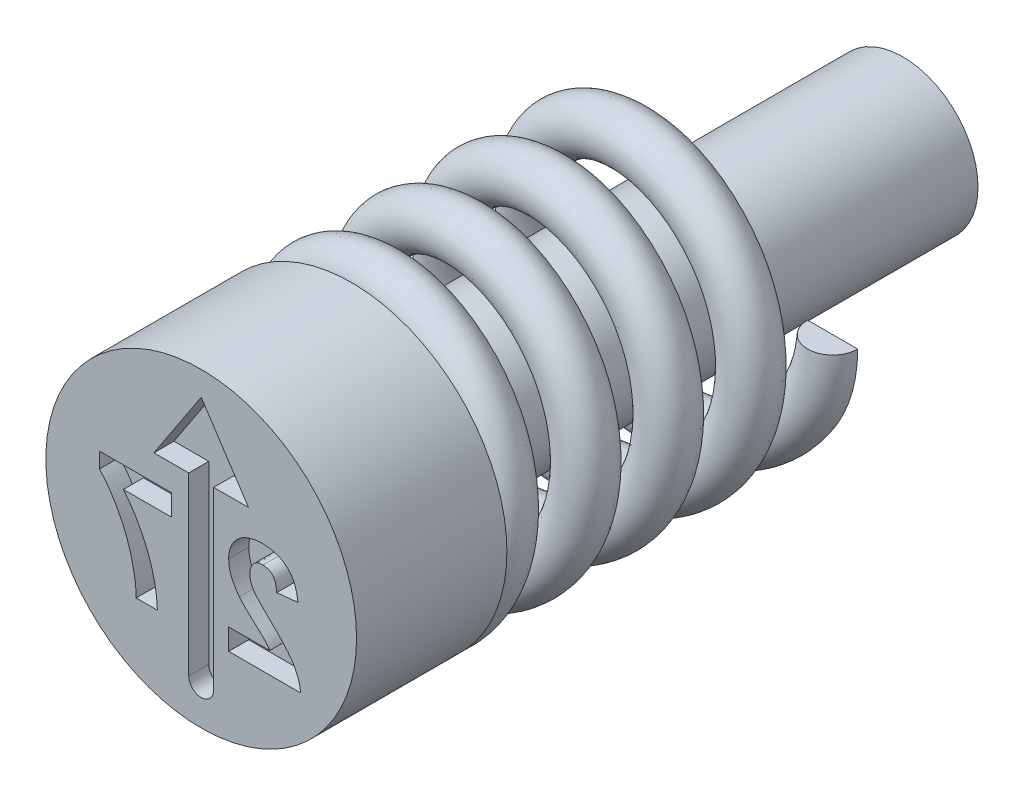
ISO-10303-21;
HEADER;
FILE_DESCRIPTION(('STEP AP214'),'2;1');
FILE_NAME('part.step','',(''),(''),'','','');
FILE_SCHEMA(('AUTOMOTIVE_DESIGN { 1 0 10303 214 1 1 1 1 }'));
ENDSEC;
DATA;
#1=APPLICATION_CONTEXT('core data for automotive mechanical design processes');
#2=APPLICATION_PROTOCOL_DEFINITION('international standard','automotive_design',2000,#1);
#3=PRODUCT_CONTEXT('',#1,'mechanical');
#4=PRODUCT('Part','Part','',(#3));
#5=PRODUCT_RELATED_PRODUCT_CATEGORY('part','',(#4));
#6=PRODUCT_DEFINITION_FORMATION('','',#4);
#7=PRODUCT_DEFINITION_CONTEXT('part definition',#1,'design');
#8=PRODUCT_DEFINITION('design','',#6,#7);
#9=PRODUCT_DEFINITION_SHAPE('','',#8);
#10=(LENGTH_UNIT() NAMED_UNIT(*) SI_UNIT(.MILLI.,.METRE.));
#11=(NAMED_UNIT(*) PLANE_ANGLE_UNIT() SI_UNIT($,.RADIAN.));
#12=(NAMED_UNIT(*) SI_UNIT($,.STERADIAN.) SOLID_ANGLE_UNIT());
#13=UNCERTAINTY_MEASURE_WITH_UNIT(LENGTH_MEASURE(1.E-05),#10,'distance_accuracy_value','');
#14=(GEOMETRIC_REPRESENTATION_CONTEXT(3) GLOBAL_UNCERTAINTY_ASSIGNED_CONTEXT((#13)) GLOBAL_UNIT_ASSIGNED_CONTEXT((#10,
#11,#12)) REPRESENTATION_CONTEXT('',''));
#15=CARTESIAN_POINT('',(0.,0.,0.));
#16=DIRECTION('',(0.,0.,1.));
#17=DIRECTION('',(1.,0.,0.));
#18=AXIS2_PLACEMENT_3D('',#15,#16,#17);
#19=CARTESIAN_POINT('',(2.6,0.,-10.5));
#20=DIRECTION('',(0.,-1.,0.));
#21=DIRECTION('',(0.,0.,-1.));
#22=AXIS2_PLACEMENT_3D('',#19,#20,#21);
#23=PLANE('',#22);
#24=CARTESIAN_POINT('',(2.6,0.,-10.));
#25=DIRECTION('',(0.,1.,0.));
#26=DIRECTION('',(0.,0.,1.));
#27=AXIS2_PLACEMENT_3D('',#24,#25,#26);
#28=CIRCLE('',#27,0.5);
#29=CARTESIAN_POINT('',(2.1,0.,-10.));
#30=VERTEX_POINT('',#29);
#31=CARTESIAN_POINT('',(3.1,0.,-10.));
#32=VERTEX_POINT('',#31);
#33=EDGE_CURVE('E88',#30,#32,#28,.T.);
#34=ORIENTED_EDGE('',*,*,#33,.T.);
#35=DIRECTION('',(-1.,0.,0.));
#36=VECTOR('',#35,1.);
#37=CARTESIAN_POINT('',(2.6,0.,-10.));
#38=LINE('',#37,#36);
#39=EDGE_CURVE('E75',#32,#30,#38,.T.);
#40=ORIENTED_EDGE('',*,*,#39,.T.);
#41=EDGE_LOOP('',(#34,#40));
#42=FACE_BOUND('',#41,.T.);
#43=ADVANCED_FACE('F49',(#42),#23,.F.);
#44=CARTESIAN_POINT('',(0.,-2.6,-3.5));
#45=DIRECTION('',(-1.,0.,0.));
#46=DIRECTION('',(0.,-1.,0.));
#47=AXIS2_PLACEMENT_3D('',#44,#45,#46);
#48=PLANE('',#47);
#49=DIRECTION('',(0.,-1.,0.));
#50=VECTOR('',#49,1.);
#51=CARTESIAN_POINT('',(0.,-2.6,-3.));
#52=LINE('',#51,#50);
#53=CARTESIAN_POINT('',(0.,-2.1,-3.));
#54=VERTEX_POINT('',#53);
#55=CARTESIAN_POINT('',(0.,-3.1,-3.));
#56=VERTEX_POINT('',#55);
#57=EDGE_CURVE('E69',#54,#56,#52,.T.);
#58=ORIENTED_EDGE('',*,*,#57,.F.);
#59=CARTESIAN_POINT('',(0.,-2.6,-3.));
#60=DIRECTION('',(-1.,0.,0.));
#61=DIRECTION('',(0.,-1.,0.));
#62=AXIS2_PLACEMENT_3D('',#59,#60,#61);
#63=CIRCLE('',#62,0.5);
#64=EDGE_CURVE('E85',#54,#56,#63,.T.);
#65=ORIENTED_EDGE('',*,*,#64,.T.);
#66=EDGE_LOOP('',(#58,#65));
#67=FACE_BOUND('',#66,.T.);
#68=ADVANCED_FACE('F51',(#67),#48,.T.);
#69=CARTESIAN_POINT('',(2.6,0.,-9.5));
#70=CARTESIAN_POINT('',(2.6,-1.07695526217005,-9.39705882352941));
#71=CARTESIAN_POINT('',(1.83847763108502,-1.83847763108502,-9.29411764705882));
#72=CARTESIAN_POINT('',(1.07695526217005,-2.6,-9.19117647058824));
#73=CARTESIAN_POINT('',(0.,-2.6,-9.08823529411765));
#74=CARTESIAN_POINT('',(-1.07695526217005,-2.6,-8.98529411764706));
#75=CARTESIAN_POINT('',(-1.83847763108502,-1.83847763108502,-8.88235294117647));
#76=CARTESIAN_POINT('',(-2.6,-1.07695526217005,-8.77941176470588));
#77=CARTESIAN_POINT('',(-2.6,0.,-8.6764705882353));
#78=CARTESIAN_POINT('',(-2.6,1.07695526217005,-8.57352941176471));
#79=CARTESIAN_POINT('',(-1.83847763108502,1.83847763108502,-8.47058823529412));
#80=CARTESIAN_POINT('',(-1.07695526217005,2.6,-8.36764705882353));
#81=CARTESIAN_POINT('',(0.,2.6,-8.26470588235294));
#82=CARTESIAN_POINT('',(1.07695526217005,2.6,-8.16176470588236));
#83=CARTESIAN_POINT('',(1.83847763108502,1.83847763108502,-8.05882352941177));
#84=CARTESIAN_POINT('',(2.6,1.07695526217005,-7.95588235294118));
#85=CARTESIAN_POINT('',(2.6,0.,-7.85294117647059));
#86=CARTESIAN_POINT('',(2.6,-1.07695526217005,-7.75));
#87=CARTESIAN_POINT('',(1.83847763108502,-1.83847763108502,-7.64705882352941));
#88=CARTESIAN_POINT('',(1.07695526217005,-2.6,-7.54411764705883));
#89=CARTESIAN_POINT('',(0.,-2.6,-7.44117647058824));
#90=CARTESIAN_POINT('',(-1.07695526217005,-2.6,-7.33823529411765));
#91=CARTESIAN_POINT('',(-1.83847763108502,-1.83847763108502,-7.23529411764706));
#92=CARTESIAN_POINT('',(-2.6,-1.07695526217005,-7.13235294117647));
#93=CARTESIAN_POINT('',(-2.6,0.,-7.02941176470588));
#94=CARTESIAN_POINT('',(-2.6,1.07695526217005,-6.9264705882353));
#95=CARTESIAN_POINT('',(-1.83847763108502,1.83847763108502,-6.82352941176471));
#96=CARTESIAN_POINT('',(-1.07695526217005,2.6,-6.72058823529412));
#97=CARTESIAN_POINT('',(0.,2.6,-6.61764705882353));
#98=CARTESIAN_POINT('',(1.07695526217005,2.6,-6.51470588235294));
#99=CARTESIAN_POINT('',(1.83847763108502,1.83847763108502,-6.41176470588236));
#100=CARTESIAN_POINT('',(2.6,1.07695526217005,-6.30882352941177));
#101=CARTESIAN_POINT('',(2.6,0.,-6.20588235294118));
#102=CARTESIAN_POINT('',(2.6,-1.07695526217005,-6.10294117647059));
#103=CARTESIAN_POINT('',(1.83847763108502,-1.83847763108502,-6.));
#104=CARTESIAN_POINT('',(1.07695526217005,-2.6,-5.89705882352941));
#105=CARTESIAN_POINT('',(0.,-2.6,-5.79411764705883));
#106=CARTESIAN_POINT('',(-1.07695526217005,-2.6,-5.69117647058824));
#107=CARTESIAN_POINT('',(-1.83847763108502,-1.83847763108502,-5.58823529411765));
#108=CARTESIAN_POINT('',(-2.6,-1.07695526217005,-5.48529411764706));
#109=CARTESIAN_POINT('',(-2.6,0.,-5.38235294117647));
#110=CARTESIAN_POINT('',(-2.6,1.07695526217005,-5.27941176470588));
#111=CARTESIAN_POINT('',(-1.83847763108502,1.83847763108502,-5.1764705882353));
#112=CARTESIAN_POINT('',(-1.07695526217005,2.6,-5.07352941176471));
#113=CARTESIAN_POINT('',(0.,2.6,-4.97058823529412));
#114=CARTESIAN_POINT('',(1.07695526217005,2.6,-4.86764705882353));
#115=CARTESIAN_POINT('',(1.83847763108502,1.83847763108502,-4.76470588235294));
#116=CARTESIAN_POINT('',(2.6,1.07695526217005,-4.66176470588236));
#117=CARTESIAN_POINT('',(2.6,0.,-4.55882352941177));
#118=CARTESIAN_POINT('',(2.6,-1.07695526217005,-4.45588235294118));
#119=CARTESIAN_POINT('',(1.83847763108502,-1.83847763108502,-4.35294117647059));
#120=CARTESIAN_POINT('',(1.07695526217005,-2.6,-4.25));
#121=CARTESIAN_POINT('',(0.,-2.6,-4.14705882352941));
#122=CARTESIAN_POINT('',(-1.07695526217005,-2.6,-4.04411764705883));
#123=CARTESIAN_POINT('',(-1.83847763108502,-1.83847763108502,-3.94117647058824));
#124=CARTESIAN_POINT('',(-2.6,-1.07695526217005,-3.83823529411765));
#125=CARTESIAN_POINT('',(-2.6,0.,-3.73529411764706));
#126=CARTESIAN_POINT('',(-2.6,1.07695526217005,-3.63235294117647));
#127=CARTESIAN_POINT('',(-1.83847763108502,1.83847763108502,-3.52941176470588));
#128=CARTESIAN_POINT('',(-1.07695526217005,2.6,-3.4264705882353));
#129=CARTESIAN_POINT('',(0.,2.6,-3.32352941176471));
#130=CARTESIAN_POINT('',(1.07695526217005,2.6,-3.22058823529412));
#131=CARTESIAN_POINT('',(1.83847763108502,1.83847763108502,-3.11764705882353));
#132=CARTESIAN_POINT('',(2.6,1.07695526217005,-3.01470588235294));
#133=CARTESIAN_POINT('',(2.6,0.,-2.91176470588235));
#134=CARTESIAN_POINT('',(2.6,-1.07695526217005,-2.80882352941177));
#135=CARTESIAN_POINT('',(1.83847763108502,-1.83847763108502,-2.70588235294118));
#136=CARTESIAN_POINT('',(1.07695526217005,-2.6,-2.60294117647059));
#137=CARTESIAN_POINT('',(0.,-2.6,-2.5));
#138=CARTESIAN_POINT('',(3.6,0.,-9.5));
#139=CARTESIAN_POINT('',(3.6,-1.49116882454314,-9.39705882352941));
#140=CARTESIAN_POINT('',(2.54558441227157,-2.54558441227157,-9.29411764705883));
#141=CARTESIAN_POINT('',(1.49116882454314,-3.6,-9.19117647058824));
#142=CARTESIAN_POINT('',(0.,-3.6,-9.08823529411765));
#143=CARTESIAN_POINT('',(-1.49116882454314,-3.6,-8.98529411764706));
#144=CARTESIAN_POINT('',(-2.54558441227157,-2.54558441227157,-8.88235294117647));
#145=CARTESIAN_POINT('',(-3.6,-1.49116882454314,-8.77941176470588));
#146=CARTESIAN_POINT('',(-3.6,0.,-8.6764705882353));
#147=CARTESIAN_POINT('',(-3.6,1.49116882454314,-8.57352941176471));
#148=CARTESIAN_POINT('',(-2.54558441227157,2.54558441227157,-8.47058823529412));
#149=CARTESIAN_POINT('',(-1.49116882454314,3.6,-8.36764705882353));
#150=CARTESIAN_POINT('',(0.,3.6,-8.26470588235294));
#151=CARTESIAN_POINT('',(1.49116882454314,3.6,-8.16176470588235));
#152=CARTESIAN_POINT('',(2.54558441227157,2.54558441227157,-8.05882352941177));
#153=CARTESIAN_POINT('',(3.6,1.49116882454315,-7.95588235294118));
#154=CARTESIAN_POINT('',(3.6,0.,-7.85294117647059));
#155=CARTESIAN_POINT('',(3.6,-1.49116882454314,-7.75));
#156=CARTESIAN_POINT('',(2.54558441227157,-2.54558441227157,-7.64705882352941));
#157=CARTESIAN_POINT('',(1.49116882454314,-3.6,-7.54411764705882));
#158=CARTESIAN_POINT('',(0.,-3.6,-7.44117647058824));
#159=CARTESIAN_POINT('',(-1.49116882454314,-3.6,-7.33823529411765));
#160=CARTESIAN_POINT('',(-2.54558441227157,-2.54558441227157,-7.23529411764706));
#161=CARTESIAN_POINT('',(-3.6,-1.49116882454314,-7.13235294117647));
#162=CARTESIAN_POINT('',(-3.6,0.,-7.02941176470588));
#163=CARTESIAN_POINT('',(-3.6,1.49116882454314,-6.92647058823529));
#164=CARTESIAN_POINT('',(-2.54558441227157,2.54558441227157,-6.82352941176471));
#165=CARTESIAN_POINT('',(-1.49116882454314,3.6,-6.72058823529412));
#166=CARTESIAN_POINT('',(0.,3.6,-6.61764705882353));
#167=CARTESIAN_POINT('',(1.49116882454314,3.6,-6.51470588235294));
#168=CARTESIAN_POINT('',(2.54558441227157,2.54558441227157,-6.41176470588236));
#169=CARTESIAN_POINT('',(3.6,1.49116882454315,-6.30882352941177));
#170=CARTESIAN_POINT('',(3.6,0.,-6.20588235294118));
#171=CARTESIAN_POINT('',(3.6,-1.49116882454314,-6.10294117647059));
#172=CARTESIAN_POINT('',(2.54558441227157,-2.54558441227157,-6.));
#173=CARTESIAN_POINT('',(1.49116882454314,-3.6,-5.89705882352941));
#174=CARTESIAN_POINT('',(0.,-3.6,-5.79411764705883));
#175=CARTESIAN_POINT('',(-1.49116882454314,-3.6,-5.69117647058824));
#176=CARTESIAN_POINT('',(-2.54558441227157,-2.54558441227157,-5.58823529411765));
#177=CARTESIAN_POINT('',(-3.6,-1.49116882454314,-5.48529411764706));
#178=CARTESIAN_POINT('',(-3.6,0.,-5.38235294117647));
#179=CARTESIAN_POINT('',(-3.6,1.49116882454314,-5.27941176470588));
#180=CARTESIAN_POINT('',(-2.54558441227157,2.54558441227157,-5.1764705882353));
#181=CARTESIAN_POINT('',(-1.49116882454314,3.6,-5.07352941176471));
#182=CARTESIAN_POINT('',(0.,3.6,-4.97058823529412));
#183=CARTESIAN_POINT('',(1.49116882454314,3.6,-4.86764705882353));
#184=CARTESIAN_POINT('',(2.54558441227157,2.54558441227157,-4.76470588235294));
#185=CARTESIAN_POINT('',(3.6,1.49116882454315,-4.66176470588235));
#186=CARTESIAN_POINT('',(3.6,0.,-4.55882352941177));
#187=CARTESIAN_POINT('',(3.6,-1.49116882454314,-4.45588235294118));
#188=CARTESIAN_POINT('',(2.54558441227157,-2.54558441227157,-4.35294117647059));
#189=CARTESIAN_POINT('',(1.49116882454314,-3.6,-4.25));
#190=CARTESIAN_POINT('',(0.,-3.6,-4.14705882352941));
#191=CARTESIAN_POINT('',(-1.49116882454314,-3.6,-4.04411764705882));
#192=CARTESIAN_POINT('',(-2.54558441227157,-2.54558441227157,-3.94117647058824));
#193=CARTESIAN_POINT('',(-3.6,-1.49116882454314,-3.83823529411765));
#194=CARTESIAN_POINT('',(-3.6,0.,-3.73529411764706));
#195=CARTESIAN_POINT('',(-3.6,1.49116882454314,-3.63235294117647));
#196=CARTESIAN_POINT('',(-2.54558441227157,2.54558441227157,-3.52941176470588));
#197=CARTESIAN_POINT('',(-1.49116882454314,3.6,-3.42647058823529));
#198=CARTESIAN_POINT('',(0.,3.6,-3.32352941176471));
#199=CARTESIAN_POINT('',(1.49116882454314,3.6,-3.22058823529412));
#200=CARTESIAN_POINT('',(2.54558441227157,2.54558441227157,-3.11764705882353));
#201=CARTESIAN_POINT('',(3.6,1.49116882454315,-3.01470588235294));
#202=CARTESIAN_POINT('',(3.6,0.,-2.91176470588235));
#203=CARTESIAN_POINT('',(3.6,-1.49116882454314,-2.80882352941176));
#204=CARTESIAN_POINT('',(2.54558441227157,-2.54558441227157,-2.70588235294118));
#205=CARTESIAN_POINT('',(1.49116882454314,-3.6,-2.60294117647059));
#206=CARTESIAN_POINT('',(0.,-3.6,-2.5));
#207=CARTESIAN_POINT('',(3.6,0.,-10.5));
#208=CARTESIAN_POINT('',(3.6,-1.49116882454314,-10.3970588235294));
#209=CARTESIAN_POINT('',(2.54558441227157,-2.54558441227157,-10.2941176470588));
#210=CARTESIAN_POINT('',(1.49116882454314,-3.6,-10.1911764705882));
#211=CARTESIAN_POINT('',(0.,-3.6,-10.0882352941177));
#212=CARTESIAN_POINT('',(-1.49116882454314,-3.6,-9.98529411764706));
#213=CARTESIAN_POINT('',(-2.54558441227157,-2.54558441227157,-9.88235294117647));
#214=CARTESIAN_POINT('',(-3.6,-1.49116882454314,-9.77941176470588));
#215=CARTESIAN_POINT('',(-3.6,0.,-9.6764705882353));
#216=CARTESIAN_POINT('',(-3.6,1.49116882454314,-9.57352941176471));
#217=CARTESIAN_POINT('',(-2.54558441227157,2.54558441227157,-9.47058823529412));
#218=CARTESIAN_POINT('',(-1.49116882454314,3.6,-9.36764705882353));
#219=CARTESIAN_POINT('',(0.,3.6,-9.26470588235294));
#220=CARTESIAN_POINT('',(1.49116882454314,3.6,-9.16176470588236));
#221=CARTESIAN_POINT('',(2.54558441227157,2.54558441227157,-9.05882352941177));
#222=CARTESIAN_POINT('',(3.6,1.49116882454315,-8.95588235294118));
#223=CARTESIAN_POINT('',(3.6,0.,-8.85294117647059));
#224=CARTESIAN_POINT('',(3.6,-1.49116882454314,-8.75));
#225=CARTESIAN_POINT('',(2.54558441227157,-2.54558441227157,-8.64705882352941));
#226=CARTESIAN_POINT('',(1.49116882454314,-3.6,-8.54411764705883));
#227=CARTESIAN_POINT('',(0.,-3.6,-8.44117647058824));
#228=CARTESIAN_POINT('',(-1.49116882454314,-3.6,-8.33823529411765));
#229=CARTESIAN_POINT('',(-2.54558441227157,-2.54558441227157,-8.23529411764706));
#230=CARTESIAN_POINT('',(-3.6,-1.49116882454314,-8.13235294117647));
#231=CARTESIAN_POINT('',(-3.6,0.,-8.02941176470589));
#232=CARTESIAN_POINT('',(-3.6,1.49116882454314,-7.9264705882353));
#233=CARTESIAN_POINT('',(-2.54558441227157,2.54558441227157,-7.82352941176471));
#234=CARTESIAN_POINT('',(-1.49116882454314,3.6,-7.72058823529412));
#235=CARTESIAN_POINT('',(0.,3.6,-7.61764705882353));
#236=CARTESIAN_POINT('',(1.49116882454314,3.6,-7.51470588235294));
#237=CARTESIAN_POINT('',(2.54558441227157,2.54558441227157,-7.41176470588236));
#238=CARTESIAN_POINT('',(3.6,1.49116882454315,-7.30882352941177));
#239=CARTESIAN_POINT('',(3.6,0.,-7.20588235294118));
#240=CARTESIAN_POINT('',(3.6,-1.49116882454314,-7.10294117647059));
#241=CARTESIAN_POINT('',(2.54558441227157,-2.54558441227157,-7.));
#242=CARTESIAN_POINT('',(1.49116882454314,-3.6,-6.89705882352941));
#243=CARTESIAN_POINT('',(0.,-3.6,-6.79411764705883));
#244=CARTESIAN_POINT('',(-1.49116882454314,-3.6,-6.69117647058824));
#245=CARTESIAN_POINT('',(-2.54558441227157,-2.54558441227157,-6.58823529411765));
#246=CARTESIAN_POINT('',(-3.6,-1.49116882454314,-6.48529411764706));
#247=CARTESIAN_POINT('',(-3.6,0.,-6.38235294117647));
#248=CARTESIAN_POINT('',(-3.6,1.49116882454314,-6.27941176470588));
#249=CARTESIAN_POINT('',(-2.54558441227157,2.54558441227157,-6.1764705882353));
#250=CARTESIAN_POINT('',(-1.49116882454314,3.6,-6.07352941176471));
#251=CARTESIAN_POINT('',(0.,3.6,-5.97058823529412));
#252=CARTESIAN_POINT('',(1.49116882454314,3.6,-5.86764705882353));
#253=CARTESIAN_POINT('',(2.54558441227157,2.54558441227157,-5.76470588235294));
#254=CARTESIAN_POINT('',(3.6,1.49116882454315,-5.66176470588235));
#255=CARTESIAN_POINT('',(3.6,0.,-5.55882352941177));
#256=CARTESIAN_POINT('',(3.6,-1.49116882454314,-5.45588235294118));
#257=CARTESIAN_POINT('',(2.54558441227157,-2.54558441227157,-5.35294117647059));
#258=CARTESIAN_POINT('',(1.49116882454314,-3.6,-5.25));
#259=CARTESIAN_POINT('',(0.,-3.6,-5.14705882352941));
#260=CARTESIAN_POINT('',(-1.49116882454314,-3.6,-5.04411764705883));
#261=CARTESIAN_POINT('',(-2.54558441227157,-2.54558441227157,-4.94117647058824));
#262=CARTESIAN_POINT('',(-3.6,-1.49116882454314,-4.83823529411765));
#263=CARTESIAN_POINT('',(-3.6,0.,-4.73529411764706));
#264=CARTESIAN_POINT('',(-3.6,1.49116882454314,-4.63235294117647));
#265=CARTESIAN_POINT('',(-2.54558441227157,2.54558441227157,-4.52941176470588));
#266=CARTESIAN_POINT('',(-1.49116882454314,3.6,-4.4264705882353));
#267=CARTESIAN_POINT('',(0.,3.6,-4.32352941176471));
#268=CARTESIAN_POINT('',(1.49116882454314,3.6,-4.22058823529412));
#269=CARTESIAN_POINT('',(2.54558441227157,2.54558441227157,-4.11764705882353));
#270=CARTESIAN_POINT('',(3.6,1.49116882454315,-4.01470588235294));
#271=CARTESIAN_POINT('',(3.6,0.,-3.91176470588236));
#272=CARTESIAN_POINT('',(3.6,-1.49116882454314,-3.80882352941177));
#273=CARTESIAN_POINT('',(2.54558441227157,-2.54558441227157,-3.70588235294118));
#274=CARTESIAN_POINT('',(1.49116882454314,-3.6,-3.60294117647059));
#275=CARTESIAN_POINT('',(0.,-3.6,-3.5));
#276=CARTESIAN_POINT('',(2.6,0.,-10.5));
#277=CARTESIAN_POINT('',(2.6,-1.07695526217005,-10.3970588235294));
#278=CARTESIAN_POINT('',(1.83847763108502,-1.83847763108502,-10.2941176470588));
#279=CARTESIAN_POINT('',(1.07695526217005,-2.6,-10.1911764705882));
#280=CARTESIAN_POINT('',(0.,-2.6,-10.0882352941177));
#281=CARTESIAN_POINT('',(-1.07695526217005,-2.6,-9.98529411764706));
#282=CARTESIAN_POINT('',(-1.83847763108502,-1.83847763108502,-9.88235294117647));
#283=CARTESIAN_POINT('',(-2.6,-1.07695526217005,-9.77941176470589));
#284=CARTESIAN_POINT('',(-2.6,0.,-9.6764705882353));
#285=CARTESIAN_POINT('',(-2.6,1.07695526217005,-9.57352941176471));
#286=CARTESIAN_POINT('',(-1.83847763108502,1.83847763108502,-9.47058823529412));
#287=CARTESIAN_POINT('',(-1.07695526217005,2.6,-9.36764705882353));
#288=CARTESIAN_POINT('',(0.,2.6,-9.26470588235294));
#289=CARTESIAN_POINT('',(1.07695526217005,2.6,-9.16176470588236));
#290=CARTESIAN_POINT('',(1.83847763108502,1.83847763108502,-9.05882352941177));
#291=CARTESIAN_POINT('',(2.6,1.07695526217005,-8.95588235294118));
#292=CARTESIAN_POINT('',(2.6,0.,-8.85294117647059));
#293=CARTESIAN_POINT('',(2.6,-1.07695526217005,-8.75));
#294=CARTESIAN_POINT('',(1.83847763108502,-1.83847763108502,-8.64705882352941));
#295=CARTESIAN_POINT('',(1.07695526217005,-2.6,-8.54411764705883));
#296=CARTESIAN_POINT('',(0.,-2.6,-8.44117647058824));
#297=CARTESIAN_POINT('',(-1.07695526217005,-2.6,-8.33823529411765));
#298=CARTESIAN_POINT('',(-1.83847763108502,-1.83847763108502,-8.23529411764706));
#299=CARTESIAN_POINT('',(-2.6,-1.07695526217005,-8.13235294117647));
#300=CARTESIAN_POINT('',(-2.6,0.,-8.02941176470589));
#301=CARTESIAN_POINT('',(-2.6,1.07695526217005,-7.9264705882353));
#302=CARTESIAN_POINT('',(-1.83847763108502,1.83847763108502,-7.82352941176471));
#303=CARTESIAN_POINT('',(-1.07695526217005,2.6,-7.72058823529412));
#304=CARTESIAN_POINT('',(0.,2.6,-7.61764705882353));
#305=CARTESIAN_POINT('',(1.07695526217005,2.6,-7.51470588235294));
#306=CARTESIAN_POINT('',(1.83847763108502,1.83847763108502,-7.41176470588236));
#307=CARTESIAN_POINT('',(2.6,1.07695526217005,-7.30882352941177));
#308=CARTESIAN_POINT('',(2.6,0.,-7.20588235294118));
#309=CARTESIAN_POINT('',(2.6,-1.07695526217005,-7.10294117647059));
#310=CARTESIAN_POINT('',(1.83847763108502,-1.83847763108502,-7.));
#311=CARTESIAN_POINT('',(1.07695526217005,-2.6,-6.89705882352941));
#312=CARTESIAN_POINT('',(0.,-2.6,-6.79411764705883));
#313=CARTESIAN_POINT('',(-1.07695526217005,-2.6,-6.69117647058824));
#314=CARTESIAN_POINT('',(-1.83847763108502,-1.83847763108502,-6.58823529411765));
#315=CARTESIAN_POINT('',(-2.6,-1.07695526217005,-6.48529411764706));
#316=CARTESIAN_POINT('',(-2.6,0.,-6.38235294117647));
#317=CARTESIAN_POINT('',(-2.6,1.07695526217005,-6.27941176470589));
#318=CARTESIAN_POINT('',(-1.83847763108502,1.83847763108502,-6.1764705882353));
#319=CARTESIAN_POINT('',(-1.07695526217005,2.6,-6.07352941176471));
#320=CARTESIAN_POINT('',(0.,2.6,-5.97058823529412));
#321=CARTESIAN_POINT('',(1.07695526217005,2.6,-5.86764705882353));
#322=CARTESIAN_POINT('',(1.83847763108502,1.83847763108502,-5.76470588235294));
#323=CARTESIAN_POINT('',(2.6,1.07695526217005,-5.66176470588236));
#324=CARTESIAN_POINT('',(2.6,0.,-5.55882352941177));
#325=CARTESIAN_POINT('',(2.6,-1.07695526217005,-5.45588235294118));
#326=CARTESIAN_POINT('',(1.83847763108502,-1.83847763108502,-5.35294117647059));
#327=CARTESIAN_POINT('',(1.07695526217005,-2.6,-5.25));
#328=CARTESIAN_POINT('',(0.,-2.6,-5.14705882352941));
#329=CARTESIAN_POINT('',(-1.07695526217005,-2.6,-5.04411764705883));
#330=CARTESIAN_POINT('',(-1.83847763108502,-1.83847763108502,-4.94117647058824));
#331=CARTESIAN_POINT('',(-2.6,-1.07695526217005,-4.83823529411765));
#332=CARTESIAN_POINT('',(-2.6,0.,-4.73529411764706));
#333=CARTESIAN_POINT('',(-2.6,1.07695526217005,-4.63235294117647));
#334=CARTESIAN_POINT('',(-1.83847763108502,1.83847763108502,-4.52941176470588));
#335=CARTESIAN_POINT('',(-1.07695526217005,2.6,-4.4264705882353));
#336=CARTESIAN_POINT('',(0.,2.6,-4.32352941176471));
#337=CARTESIAN_POINT('',(1.07695526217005,2.6,-4.22058823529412));
#338=CARTESIAN_POINT('',(1.83847763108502,1.83847763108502,-4.11764705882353));
#339=CARTESIAN_POINT('',(2.6,1.07695526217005,-4.01470588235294));
#340=CARTESIAN_POINT('',(2.6,0.,-3.91176470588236));
#341=CARTESIAN_POINT('',(2.6,-1.07695526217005,-3.80882352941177));
#342=CARTESIAN_POINT('',(1.83847763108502,-1.83847763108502,-3.70588235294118));
#343=CARTESIAN_POINT('',(1.07695526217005,-2.6,-3.60294117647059));
#344=CARTESIAN_POINT('',(0.,-2.6,-3.5));
#345=CARTESIAN_POINT('',(1.6,0.,-10.5));
#346=CARTESIAN_POINT('',(1.6,-0.662741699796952,-10.3970588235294));
#347=CARTESIAN_POINT('',(1.13137084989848,-1.13137084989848,-10.2941176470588));
#348=CARTESIAN_POINT('',(0.662741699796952,-1.6,-10.1911764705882));
#349=CARTESIAN_POINT('',(0.,-1.6,-10.0882352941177));
#350=CARTESIAN_POINT('',(-0.662741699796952,-1.6,-9.98529411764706));
#351=CARTESIAN_POINT('',(-1.13137084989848,-1.13137084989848,-9.88235294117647));
#352=CARTESIAN_POINT('',(-1.6,-0.662741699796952,-9.77941176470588));
#353=CARTESIAN_POINT('',(-1.6,0.,-9.6764705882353));
#354=CARTESIAN_POINT('',(-1.6,0.662741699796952,-9.57352941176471));
#355=CARTESIAN_POINT('',(-1.13137084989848,1.13137084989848,-9.47058823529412));
#356=CARTESIAN_POINT('',(-0.662741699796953,1.6,-9.36764705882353));
#357=CARTESIAN_POINT('',(0.,1.6,-9.26470588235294));
#358=CARTESIAN_POINT('',(0.662741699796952,1.6,-9.16176470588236));
#359=CARTESIAN_POINT('',(1.13137084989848,1.13137084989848,-9.05882352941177));
#360=CARTESIAN_POINT('',(1.6,0.662741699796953,-8.95588235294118));
#361=CARTESIAN_POINT('',(1.6,0.,-8.85294117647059));
#362=CARTESIAN_POINT('',(1.6,-0.662741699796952,-8.75));
#363=CARTESIAN_POINT('',(1.13137084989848,-1.13137084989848,-8.64705882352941));
#364=CARTESIAN_POINT('',(0.662741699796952,-1.6,-8.54411764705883));
#365=CARTESIAN_POINT('',(0.,-1.6,-8.44117647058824));
#366=CARTESIAN_POINT('',(-0.662741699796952,-1.6,-8.33823529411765));
#367=CARTESIAN_POINT('',(-1.13137084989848,-1.13137084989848,-8.23529411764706));
#368=CARTESIAN_POINT('',(-1.6,-0.662741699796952,-8.13235294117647));
#369=CARTESIAN_POINT('',(-1.6,0.,-8.02941176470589));
#370=CARTESIAN_POINT('',(-1.6,0.662741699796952,-7.9264705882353));
#371=CARTESIAN_POINT('',(-1.13137084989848,1.13137084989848,-7.82352941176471));
#372=CARTESIAN_POINT('',(-0.662741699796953,1.6,-7.72058823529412));
#373=CARTESIAN_POINT('',(0.,1.6,-7.61764705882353));
#374=CARTESIAN_POINT('',(0.662741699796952,1.6,-7.51470588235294));
#375=CARTESIAN_POINT('',(1.13137084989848,1.13137084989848,-7.41176470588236));
#376=CARTESIAN_POINT('',(1.6,0.662741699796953,-7.30882352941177));
#377=CARTESIAN_POINT('',(1.6,0.,-7.20588235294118));
#378=CARTESIAN_POINT('',(1.6,-0.662741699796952,-7.10294117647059));
#379=CARTESIAN_POINT('',(1.13137084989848,-1.13137084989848,-7.));
#380=CARTESIAN_POINT('',(0.662741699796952,-1.6,-6.89705882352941));
#381=CARTESIAN_POINT('',(0.,-1.6,-6.79411764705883));
#382=CARTESIAN_POINT('',(-0.662741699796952,-1.6,-6.69117647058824));
#383=CARTESIAN_POINT('',(-1.13137084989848,-1.13137084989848,-6.58823529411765));
#384=CARTESIAN_POINT('',(-1.6,-0.662741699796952,-6.48529411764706));
#385=CARTESIAN_POINT('',(-1.6,0.,-6.38235294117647));
#386=CARTESIAN_POINT('',(-1.6,0.662741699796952,-6.27941176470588));
#387=CARTESIAN_POINT('',(-1.13137084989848,1.13137084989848,-6.1764705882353));
#388=CARTESIAN_POINT('',(-0.662741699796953,1.6,-6.07352941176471));
#389=CARTESIAN_POINT('',(0.,1.6,-5.97058823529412));
#390=CARTESIAN_POINT('',(0.662741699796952,1.6,-5.86764705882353));
#391=CARTESIAN_POINT('',(1.13137084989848,1.13137084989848,-5.76470588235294));
#392=CARTESIAN_POINT('',(1.6,0.662741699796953,-5.66176470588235));
#393=CARTESIAN_POINT('',(1.6,0.,-5.55882352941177));
#394=CARTESIAN_POINT('',(1.6,-0.662741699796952,-5.45588235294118));
#395=CARTESIAN_POINT('',(1.13137084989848,-1.13137084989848,-5.35294117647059));
#396=CARTESIAN_POINT('',(0.662741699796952,-1.6,-5.25));
#397=CARTESIAN_POINT('',(0.,-1.6,-5.14705882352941));
#398=CARTESIAN_POINT('',(-0.662741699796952,-1.6,-5.04411764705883));
#399=CARTESIAN_POINT('',(-1.13137084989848,-1.13137084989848,-4.94117647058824));
#400=CARTESIAN_POINT('',(-1.6,-0.662741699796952,-4.83823529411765));
#401=CARTESIAN_POINT('',(-1.6,0.,-4.73529411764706));
#402=CARTESIAN_POINT('',(-1.6,0.662741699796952,-4.63235294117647));
#403=CARTESIAN_POINT('',(-1.13137084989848,1.13137084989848,-4.52941176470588));
#404=CARTESIAN_POINT('',(-0.662741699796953,1.6,-4.4264705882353));
#405=CARTESIAN_POINT('',(0.,1.6,-4.32352941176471));
#406=CARTESIAN_POINT('',(0.662741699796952,1.6,-4.22058823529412));
#407=CARTESIAN_POINT('',(1.13137084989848,1.13137084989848,-4.11764705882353));
#408=CARTESIAN_POINT('',(1.6,0.662741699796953,-4.01470588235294));
#409=CARTESIAN_POINT('',(1.6,0.,-3.91176470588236));
#410=CARTESIAN_POINT('',(1.6,-0.662741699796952,-3.80882352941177));
#411=CARTESIAN_POINT('',(1.13137084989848,-1.13137084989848,-3.70588235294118));
#412=CARTESIAN_POINT('',(0.662741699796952,-1.6,-3.60294117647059));
#413=CARTESIAN_POINT('',(0.,-1.6,-3.5));
#414=CARTESIAN_POINT('',(1.6,0.,-9.5));
#415=CARTESIAN_POINT('',(1.6,-0.662741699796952,-9.39705882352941));
#416=CARTESIAN_POINT('',(1.13137084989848,-1.13137084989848,-9.29411764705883));
#417=CARTESIAN_POINT('',(0.662741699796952,-1.6,-9.19117647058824));
#418=CARTESIAN_POINT('',(0.,-1.6,-9.08823529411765));
#419=CARTESIAN_POINT('',(-0.662741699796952,-1.6,-8.98529411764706));
#420=CARTESIAN_POINT('',(-1.13137084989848,-1.13137084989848,-8.88235294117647));
#421=CARTESIAN_POINT('',(-1.6,-0.662741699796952,-8.77941176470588));
#422=CARTESIAN_POINT('',(-1.6,0.,-8.6764705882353));
#423=CARTESIAN_POINT('',(-1.6,0.662741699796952,-8.57352941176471));
#424=CARTESIAN_POINT('',(-1.13137084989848,1.13137084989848,-8.47058823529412));
#425=CARTESIAN_POINT('',(-0.662741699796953,1.6,-8.36764705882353));
#426=CARTESIAN_POINT('',(0.,1.6,-8.26470588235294));
#427=CARTESIAN_POINT('',(0.662741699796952,1.6,-8.16176470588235));
#428=CARTESIAN_POINT('',(1.13137084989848,1.13137084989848,-8.05882352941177));
#429=CARTESIAN_POINT('',(1.6,0.662741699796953,-7.95588235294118));
#430=CARTESIAN_POINT('',(1.6,0.,-7.85294117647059));
#431=CARTESIAN_POINT('',(1.6,-0.662741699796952,-7.75));
#432=CARTESIAN_POINT('',(1.13137084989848,-1.13137084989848,-7.64705882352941));
#433=CARTESIAN_POINT('',(0.662741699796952,-1.6,-7.54411764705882));
#434=CARTESIAN_POINT('',(0.,-1.6,-7.44117647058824));
#435=CARTESIAN_POINT('',(-0.662741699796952,-1.6,-7.33823529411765));
#436=CARTESIAN_POINT('',(-1.13137084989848,-1.13137084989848,-7.23529411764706));
#437=CARTESIAN_POINT('',(-1.6,-0.662741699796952,-7.13235294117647));
#438=CARTESIAN_POINT('',(-1.6,0.,-7.02941176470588));
#439=CARTESIAN_POINT('',(-1.6,0.662741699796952,-6.92647058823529));
#440=CARTESIAN_POINT('',(-1.13137084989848,1.13137084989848,-6.82352941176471));
#441=CARTESIAN_POINT('',(-0.662741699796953,1.6,-6.72058823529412));
#442=CARTESIAN_POINT('',(0.,1.6,-6.61764705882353));
#443=CARTESIAN_POINT('',(0.662741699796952,1.6,-6.51470588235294));
#444=CARTESIAN_POINT('',(1.13137084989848,1.13137084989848,-6.41176470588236));
#445=CARTESIAN_POINT('',(1.6,0.662741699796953,-6.30882352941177));
#446=CARTESIAN_POINT('',(1.6,0.,-6.20588235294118));
#447=CARTESIAN_POINT('',(1.6,-0.662741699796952,-6.10294117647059));
#448=CARTESIAN_POINT('',(1.13137084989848,-1.13137084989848,-6.));
#449=CARTESIAN_POINT('',(0.662741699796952,-1.6,-5.89705882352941));
#450=CARTESIAN_POINT('',(0.,-1.6,-5.79411764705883));
#451=CARTESIAN_POINT('',(-0.662741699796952,-1.6,-5.69117647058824));
#452=CARTESIAN_POINT('',(-1.13137084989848,-1.13137084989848,-5.58823529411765));
#453=CARTESIAN_POINT('',(-1.6,-0.662741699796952,-5.48529411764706));
#454=CARTESIAN_POINT('',(-1.6,0.,-5.38235294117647));
#455=CARTESIAN_POINT('',(-1.6,0.662741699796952,-5.27941176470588));
#456=CARTESIAN_POINT('',(-1.13137084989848,1.13137084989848,-5.1764705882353));
#457=CARTESIAN_POINT('',(-0.662741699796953,1.6,-5.07352941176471));
#458=CARTESIAN_POINT('',(0.,1.6,-4.97058823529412));
#459=CARTESIAN_POINT('',(0.662741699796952,1.6,-4.86764705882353));
#460=CARTESIAN_POINT('',(1.13137084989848,1.13137084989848,-4.76470588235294));
#461=CARTESIAN_POINT('',(1.6,0.662741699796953,-4.66176470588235));
#462=CARTESIAN_POINT('',(1.6,0.,-4.55882352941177));
#463=CARTESIAN_POINT('',(1.6,-0.662741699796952,-4.45588235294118));
#464=CARTESIAN_POINT('',(1.13137084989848,-1.13137084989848,-4.35294117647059));
#465=CARTESIAN_POINT('',(0.662741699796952,-1.6,-4.25));
#466=CARTESIAN_POINT('',(0.,-1.6,-4.14705882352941));
#467=CARTESIAN_POINT('',(-0.662741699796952,-1.6,-4.04411764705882));
#468=CARTESIAN_POINT('',(-1.13137084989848,-1.13137084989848,-3.94117647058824));
#469=CARTESIAN_POINT('',(-1.6,-0.662741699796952,-3.83823529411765));
#470=CARTESIAN_POINT('',(-1.6,0.,-3.73529411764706));
#471=CARTESIAN_POINT('',(-1.6,0.662741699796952,-3.63235294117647));
#472=CARTESIAN_POINT('',(-1.13137084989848,1.13137084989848,-3.52941176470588));
#473=CARTESIAN_POINT('',(-0.662741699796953,1.6,-3.42647058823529));
#474=CARTESIAN_POINT('',(0.,1.6,-3.32352941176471));
#475=CARTESIAN_POINT('',(0.662741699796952,1.6,-3.22058823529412));
#476=CARTESIAN_POINT('',(1.13137084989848,1.13137084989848,-3.11764705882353));
#477=CARTESIAN_POINT('',(1.6,0.662741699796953,-3.01470588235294));
#478=CARTESIAN_POINT('',(1.6,0.,-2.91176470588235));
#479=CARTESIAN_POINT('',(1.6,-0.662741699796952,-2.80882352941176));
#480=CARTESIAN_POINT('',(1.13137084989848,-1.13137084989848,-2.70588235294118));
#481=CARTESIAN_POINT('',(0.662741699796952,-1.6,-2.60294117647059));
#482=CARTESIAN_POINT('',(0.,-1.6,-2.5));
#483=CARTESIAN_POINT('',(2.6,0.,-9.5));
#484=CARTESIAN_POINT('',(2.6,-1.07695526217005,-9.39705882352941));
#485=CARTESIAN_POINT('',(1.83847763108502,-1.83847763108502,-9.29411764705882));
#486=CARTESIAN_POINT('',(1.07695526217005,-2.6,-9.19117647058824));
#487=CARTESIAN_POINT('',(0.,-2.6,-9.08823529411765));
#488=CARTESIAN_POINT('',(-1.07695526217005,-2.6,-8.98529411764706));
#489=CARTESIAN_POINT('',(-1.83847763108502,-1.83847763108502,-8.88235294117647));
#490=CARTESIAN_POINT('',(-2.6,-1.07695526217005,-8.77941176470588));
#491=CARTESIAN_POINT('',(-2.6,0.,-8.6764705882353));
#492=CARTESIAN_POINT('',(-2.6,1.07695526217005,-8.57352941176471));
#493=CARTESIAN_POINT('',(-1.83847763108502,1.83847763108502,-8.47058823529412));
#494=CARTESIAN_POINT('',(-1.07695526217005,2.6,-8.36764705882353));
#495=CARTESIAN_POINT('',(0.,2.6,-8.26470588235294));
#496=CARTESIAN_POINT('',(1.07695526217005,2.6,-8.16176470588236));
#497=CARTESIAN_POINT('',(1.83847763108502,1.83847763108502,-8.05882352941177));
#498=CARTESIAN_POINT('',(2.6,1.07695526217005,-7.95588235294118));
#499=CARTESIAN_POINT('',(2.6,0.,-7.85294117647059));
#500=CARTESIAN_POINT('',(2.6,-1.07695526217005,-7.75));
#501=CARTESIAN_POINT('',(1.83847763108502,-1.83847763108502,-7.64705882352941));
#502=CARTESIAN_POINT('',(1.07695526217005,-2.6,-7.54411764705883));
#503=CARTESIAN_POINT('',(0.,-2.6,-7.44117647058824));
#504=CARTESIAN_POINT('',(-1.07695526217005,-2.6,-7.33823529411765));
#505=CARTESIAN_POINT('',(-1.83847763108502,-1.83847763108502,-7.23529411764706));
#506=CARTESIAN_POINT('',(-2.6,-1.07695526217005,-7.13235294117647));
#507=CARTESIAN_POINT('',(-2.6,0.,-7.02941176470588));
#508=CARTESIAN_POINT('',(-2.6,1.07695526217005,-6.9264705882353));
#509=CARTESIAN_POINT('',(-1.83847763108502,1.83847763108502,-6.82352941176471));
#510=CARTESIAN_POINT('',(-1.07695526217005,2.6,-6.72058823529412));
#511=CARTESIAN_POINT('',(0.,2.6,-6.61764705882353));
#512=CARTESIAN_POINT('',(1.07695526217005,2.6,-6.51470588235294));
#513=CARTESIAN_POINT('',(1.83847763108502,1.83847763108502,-6.41176470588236));
#514=CARTESIAN_POINT('',(2.6,1.07695526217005,-6.30882352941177));
#515=CARTESIAN_POINT('',(2.6,0.,-6.20588235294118));
#516=CARTESIAN_POINT('',(2.6,-1.07695526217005,-6.10294117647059));
#517=CARTESIAN_POINT('',(1.83847763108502,-1.83847763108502,-6.));
#518=CARTESIAN_POINT('',(1.07695526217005,-2.6,-5.89705882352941));
#519=CARTESIAN_POINT('',(0.,-2.6,-5.79411764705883));
#520=CARTESIAN_POINT('',(-1.07695526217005,-2.6,-5.69117647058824));
#521=CARTESIAN_POINT('',(-1.83847763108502,-1.83847763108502,-5.58823529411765));
#522=CARTESIAN_POINT('',(-2.6,-1.07695526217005,-5.48529411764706));
#523=CARTESIAN_POINT('',(-2.6,0.,-5.38235294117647));
#524=CARTESIAN_POINT('',(-2.6,1.07695526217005,-5.27941176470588));
#525=CARTESIAN_POINT('',(-1.83847763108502,1.83847763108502,-5.1764705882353));
#526=CARTESIAN_POINT('',(-1.07695526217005,2.6,-5.07352941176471));
#527=CARTESIAN_POINT('',(0.,2.6,-4.97058823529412));
#528=CARTESIAN_POINT('',(1.07695526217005,2.6,-4.86764705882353));
#529=CARTESIAN_POINT('',(1.83847763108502,1.83847763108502,-4.76470588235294));
#530=CARTESIAN_POINT('',(2.6,1.07695526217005,-4.66176470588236));
#531=CARTESIAN_POINT('',(2.6,0.,-4.55882352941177));
#532=CARTESIAN_POINT('',(2.6,-1.07695526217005,-4.45588235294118));
#533=CARTESIAN_POINT('',(1.83847763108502,-1.83847763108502,-4.35294117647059));
#534=CARTESIAN_POINT('',(1.07695526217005,-2.6,-4.25));
#535=CARTESIAN_POINT('',(0.,-2.6,-4.14705882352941));
#536=CARTESIAN_POINT('',(-1.07695526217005,-2.6,-4.04411764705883));
#537=CARTESIAN_POINT('',(-1.83847763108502,-1.83847763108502,-3.94117647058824));
#538=CARTESIAN_POINT('',(-2.6,-1.07695526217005,-3.83823529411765));
#539=CARTESIAN_POINT('',(-2.6,0.,-3.73529411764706));
#540=CARTESIAN_POINT('',(-2.6,1.07695526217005,-3.63235294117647));
#541=CARTESIAN_POINT('',(-1.83847763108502,1.83847763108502,-3.52941176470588));
#542=CARTESIAN_POINT('',(-1.07695526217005,2.6,-3.4264705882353));
#543=CARTESIAN_POINT('',(0.,2.6,-3.32352941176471));
#544=CARTESIAN_POINT('',(1.07695526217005,2.6,-3.22058823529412));
#545=CARTESIAN_POINT('',(1.83847763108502,1.83847763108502,-3.11764705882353));
#546=CARTESIAN_POINT('',(2.6,1.07695526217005,-3.01470588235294));
#547=CARTESIAN_POINT('',(2.6,0.,-2.91176470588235));
#548=CARTESIAN_POINT('',(2.6,-1.07695526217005,-2.80882352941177));
#549=CARTESIAN_POINT('',(1.83847763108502,-1.83847763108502,-2.70588235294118));
#550=CARTESIAN_POINT('',(1.07695526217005,-2.6,-2.60294117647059));
#551=CARTESIAN_POINT('',(0.,-2.6,-2.5));
#552=(BOUNDED_SURFACE() B_SPLINE_SURFACE(3,2,((#69,#70,#71,#72,#73,#74,#75,#76,#77,#78,#79,#80,
#81,#82,#83,#84,#85,#86,#87,#88,#89,#90,#91,#92,#93,#94,#95,#96,#97,#98,#99,#100,#101,#102,#103,
#104,#105,#106,#107,#108,#109,#110,#111,#112,#113,#114,#115,#116,#117,#118,#119,#120,#121,#122,
#123,#124,#125,#126,#127,#128,#129,#130,#131,#132,#133,#134,#135,#136,#137),(#138,#139,#140,
#141,#142,#143,#144,#145,#146,#147,#148,#149,#150,#151,#152,#153,#154,#155,#156,#157,#158,#159,
#160,#161,#162,#163,#164,#165,#166,#167,#168,#169,#170,#171,#172,#173,#174,#175,#176,#177,#178,
#179,#180,#181,#182,#183,#184,#185,#186,#187,#188,#189,#190,#191,#192,#193,#194,#195,#196,#197,
#198,#199,#200,#201,#202,#203,#204,#205,#206),(#207,#208,#209,#210,#211,#212,#213,#214,#215,
#216,#217,#218,#219,#220,#221,#222,#223,#224,#225,#226,#227,#228,#229,#230,#231,#232,#233,#234,
#235,#236,#237,#238,#239,#240,#241,#242,#243,#244,#245,#246,#247,#248,#249,#250,#251,#252,#253,
#254,#255,#256,#257,#258,#259,#260,#261,#262,#263,#264,#265,#266,#267,#268,#269,#270,#271,#272,
#273,#274,#275),(#276,#277,#278,#279,#280,#281,#282,#283,#284,#285,#286,#287,#288,#289,#290,
#291,#292,#293,#294,#295,#296,#297,#298,#299,#300,#301,#302,#303,#304,#305,#306,#307,#308,#309,
#310,#311,#312,#313,#314,#315,#316,#317,#318,#319,#320,#321,#322,#323,#324,#325,#326,#327,#328,
#329,#330,#331,#332,#333,#334,#335,#336,#337,#338,#339,#340,#341,#342,#343,#344),(#345,#346,
#347,#348,#349,#350,#351,#352,#353,#354,#355,#356,#357,#358,#359,#360,#361,#362,#363,#364,#365,
#366,#367,#368,#369,#370,#371,#372,#373,#374,#375,#376,#377,#378,#379,#380,#381,#382,#383,#384,
#385,#386,#387,#388,#389,#390,#391,#392,#393,#394,#395,#396,#397,#398,#399,#400,#401,#402,#403,
#404,#405,#406,#407,#408,#409,#410,#411,#412,#413),(#414,#415,#416,#417,#418,#419,#420,#421,
#422,#423,#424,#425,#426,#427,#428,#429,#430,#431,#432,#433,#434,#435,#436,#437,#438,#439,#440,
#441,#442,#443,#444,#445,#446,#447,#448,#449,#450,#451,#452,#453,#454,#455,#456,#457,#458,#459,
#460,#461,#462,#463,#464,#465,#466,#467,#468,#469,#470,#471,#472,#473,#474,#475,#476,#477,#478,
#479,#480,#481,#482),(#483,#484,#485,#486,#487,#488,#489,#490,#491,#492,#493,#494,#495,#496,
#497,#498,#499,#500,#501,#502,#503,#504,#505,#506,#507,#508,#509,#510,#511,#512,#513,#514,#515,
#516,#517,#518,#519,#520,#521,#522,#523,#524,#525,#526,#527,#528,#529,#530,#531,#532,#533,#534,
#535,#536,#537,#538,#539,#540,#541,#542,#543,#544,#545,#546,#547,#548,#549,#550,#551)),
.UNSPECIFIED.,.T.,.F.,.F.) B_SPLINE_SURFACE_WITH_KNOTS((4,3,4),(3,2,2,2,2,2,2,2,2,2,2,2,2,2,2,2,
2,2,2,2,2,2,2,2,2,2,2,2,2,2,2,2,2,2,3),(0.,0.5,1.),(0.,0.025,0.05,0.075,0.1,0.125,0.15,0.175,
0.2,0.225,0.25,0.275,0.3,0.325,0.35,0.375,0.4,0.425,0.45,0.475,0.5,0.525,0.55,0.575,0.6,0.625,
0.65,0.675,0.7,0.725,0.75,0.775,0.8,0.825,0.85),
.UNSPECIFIED.) GEOMETRIC_REPRESENTATION_ITEM() RATIONAL_B_SPLINE_SURFACE(((1.,0.923879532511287,
1.,0.923879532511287,1.,0.923879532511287,1.,0.923879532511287,1.,0.923879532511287,1.,
0.923879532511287,1.,0.923879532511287,1.,0.923879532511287,1.,0.923879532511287,1.,
0.923879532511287,1.,0.923879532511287,1.,0.923879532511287,1.,0.923879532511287,1.,
0.923879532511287,1.,0.923879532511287,1.,0.923879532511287,1.,0.923879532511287,1.,
0.923879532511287,1.,0.923879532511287,1.,0.923879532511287,1.,0.923879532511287,1.,
0.923879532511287,1.,0.923879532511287,1.,0.923879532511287,1.,0.923879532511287,1.,
0.923879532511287,1.,0.923879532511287,1.,0.923879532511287,1.,0.923879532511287,1.,
0.923879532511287,1.,0.923879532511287,1.,0.923879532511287,1.,0.923879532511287,1.,
0.923879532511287,1.),(0.333333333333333,0.307959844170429,0.333333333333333,0.307959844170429,
0.333333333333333,0.307959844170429,0.333333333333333,0.307959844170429,0.333333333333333,
0.307959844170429,0.333333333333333,0.307959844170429,0.333333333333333,0.307959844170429,
0.333333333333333,0.307959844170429,0.333333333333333,0.307959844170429,0.333333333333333,
0.307959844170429,0.333333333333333,0.307959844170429,0.333333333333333,0.307959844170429,
0.333333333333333,0.307959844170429,0.333333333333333,0.307959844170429,0.333333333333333,
0.307959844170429,0.333333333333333,0.307959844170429,0.333333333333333,0.307959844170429,
0.333333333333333,0.307959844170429,0.333333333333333,0.307959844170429,0.333333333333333,
0.307959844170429,0.333333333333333,0.307959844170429,0.333333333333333,0.307959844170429,
0.333333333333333,0.307959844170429,0.333333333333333,0.307959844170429,0.333333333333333,
0.307959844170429,0.333333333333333,0.307959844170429,0.333333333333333,0.307959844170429,
0.333333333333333,0.307959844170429,0.333333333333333,0.307959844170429,0.333333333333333,
0.307959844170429,0.333333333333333,0.307959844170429,0.333333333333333,0.307959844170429,
0.333333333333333,0.307959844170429,0.333333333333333,0.307959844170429,0.333333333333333),
(0.333333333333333,0.307959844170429,0.333333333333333,0.307959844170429,0.333333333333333,
0.307959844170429,0.333333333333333,0.307959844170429,0.333333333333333,0.307959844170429,
0.333333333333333,0.307959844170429,0.333333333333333,0.307959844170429,0.333333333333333,
0.307959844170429,0.333333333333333,0.307959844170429,0.333333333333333,0.307959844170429,
0.333333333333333,0.307959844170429,0.333333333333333,0.307959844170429,0.333333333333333,
0.307959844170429,0.333333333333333,0.307959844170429,0.333333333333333,0.307959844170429,
0.333333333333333,0.307959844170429,0.333333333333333,0.307959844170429,0.333333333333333,
0.307959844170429,0.333333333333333,0.307959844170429,0.333333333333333,0.307959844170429,
0.333333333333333,0.307959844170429,0.333333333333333,0.307959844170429,0.333333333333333,
0.307959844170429,0.333333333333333,0.307959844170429,0.333333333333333,0.307959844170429,
0.333333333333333,0.307959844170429,0.333333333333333,0.307959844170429,0.333333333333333,
0.307959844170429,0.333333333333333,0.307959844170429,0.333333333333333,0.307959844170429,
0.333333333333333,0.307959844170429,0.333333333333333,0.307959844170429,0.333333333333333,
0.307959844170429,0.333333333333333,0.307959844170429,0.333333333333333),(1.,0.923879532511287,
1.,0.923879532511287,1.,0.923879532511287,1.,0.923879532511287,1.,0.923879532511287,1.,
0.923879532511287,1.,0.923879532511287,1.,0.923879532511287,1.,0.923879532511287,1.,
0.923879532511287,1.,0.923879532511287,1.,0.923879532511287,1.,0.923879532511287,1.,
0.923879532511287,1.,0.923879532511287,1.,0.923879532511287,1.,0.923879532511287,1.,
0.923879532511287,1.,0.923879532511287,1.,0.923879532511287,1.,0.923879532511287,1.,
0.923879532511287,1.,0.923879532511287,1.,0.923879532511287,1.,0.923879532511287,1.,
0.923879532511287,1.,0.923879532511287,1.,0.923879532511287,1.,0.923879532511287,1.,
0.923879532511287,1.,0.923879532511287,1.,0.923879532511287,1.,0.923879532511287,1.,
0.923879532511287,1.),(0.333333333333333,0.307959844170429,0.333333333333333,0.307959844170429,
0.333333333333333,0.307959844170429,0.333333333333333,0.307959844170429,0.333333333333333,
0.307959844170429,0.333333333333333,0.307959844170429,0.333333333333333,0.307959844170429,
0.333333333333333,0.307959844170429,0.333333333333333,0.307959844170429,0.333333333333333,
0.307959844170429,0.333333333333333,0.307959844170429,0.333333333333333,0.307959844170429,
0.333333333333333,0.307959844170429,0.333333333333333,0.307959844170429,0.333333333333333,
0.307959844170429,0.333333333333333,0.307959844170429,0.333333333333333,0.307959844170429,
0.333333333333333,0.307959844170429,0.333333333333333,0.307959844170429,0.333333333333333,
0.307959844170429,0.333333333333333,0.307959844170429,0.333333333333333,0.307959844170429,
0.333333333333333,0.307959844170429,0.333333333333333,0.307959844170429,0.333333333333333,
0.307959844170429,0.333333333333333,0.307959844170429,0.333333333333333,0.307959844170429,
0.333333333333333,0.307959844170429,0.333333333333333,0.307959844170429,0.333333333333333,
0.307959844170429,0.333333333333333,0.307959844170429,0.333333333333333,0.307959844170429,
0.333333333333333,0.307959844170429,0.333333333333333,0.307959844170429,0.333333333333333),
(0.333333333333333,0.307959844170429,0.333333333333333,0.307959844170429,0.333333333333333,
0.307959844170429,0.333333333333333,0.307959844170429,0.333333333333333,0.307959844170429,
0.333333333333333,0.307959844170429,0.333333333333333,0.307959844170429,0.333333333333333,
0.307959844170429,0.333333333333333,0.307959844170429,0.333333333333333,0.307959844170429,
0.333333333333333,0.307959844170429,0.333333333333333,0.307959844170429,0.333333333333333,
0.307959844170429,0.333333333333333,0.307959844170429,0.333333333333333,0.307959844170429,
0.333333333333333,0.307959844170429,0.333333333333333,0.307959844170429,0.333333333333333,
0.307959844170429,0.333333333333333,0.307959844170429,0.333333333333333,0.307959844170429,
0.333333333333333,0.307959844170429,0.333333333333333,0.307959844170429,0.333333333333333,
0.307959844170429,0.333333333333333,0.307959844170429,0.333333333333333,0.307959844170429,
0.333333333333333,0.307959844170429,0.333333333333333,0.307959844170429,0.333333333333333,
0.307959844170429,0.333333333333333,0.307959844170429,0.333333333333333,0.307959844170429,
0.333333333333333,0.307959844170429,0.333333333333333,0.307959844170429,0.333333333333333,
0.307959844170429,0.333333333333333,0.307959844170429,0.333333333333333),(1.,0.923879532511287,
1.,0.923879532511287,1.,0.923879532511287,1.,0.923879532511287,1.,0.923879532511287,1.,
0.923879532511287,1.,0.923879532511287,1.,0.923879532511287,1.,0.923879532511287,1.,
0.923879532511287,1.,0.923879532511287,1.,0.923879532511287,1.,0.923879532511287,1.,
0.923879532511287,1.,0.923879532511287,1.,0.923879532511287,1.,0.923879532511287,1.,
0.923879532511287,1.,0.923879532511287,1.,0.923879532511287,1.,0.923879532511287,1.,
0.923879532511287,1.,0.923879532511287,1.,0.923879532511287,1.,0.923879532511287,1.,
0.923879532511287,1.,0.923879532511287,1.,0.923879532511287,1.,0.923879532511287,1.,
0.923879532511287,1.,0.923879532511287,1.,0.923879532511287,1.,0.923879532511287,1.,
0.923879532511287,1.))) REPRESENTATION_ITEM('') SURFACE());
#553=CARTESIAN_POINT('',(2.1,0.,-10.));
#554=CARTESIAN_POINT('',(2.09999840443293,-0.0632761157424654,-10.));
#555=CARTESIAN_POINT('',(2.09730667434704,-0.126518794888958,-10.));
#556=CARTESIAN_POINT('',(2.08660106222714,-0.252544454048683,-10.));
#557=CARTESIAN_POINT('',(2.07858784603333,-0.315327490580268,-10.));
#558=CARTESIAN_POINT('',(2.04668219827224,-0.502245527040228,-10.));
#559=CARTESIAN_POINT('',(2.0149234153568,-0.625130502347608,-10.));
#560=CARTESIAN_POINT('',(1.93148951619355,-0.86385654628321,-10.));
#561=CARTESIAN_POINT('',(1.87981156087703,-0.979696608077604,-10.));
#562=CARTESIAN_POINT('',(1.75794573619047,-1.20124694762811,-10.));
#563=CARTESIAN_POINT('',(1.68776849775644,-1.30696299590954,-10.));
#564=CARTESIAN_POINT('',(1.58960404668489,-1.43103861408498,-10.));
#565=CARTESIAN_POINT('',(1.56925631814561,-1.45566758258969,-10.));
#566=CARTESIAN_POINT('',(1.52753522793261,-1.50403899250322,-10.));
#567=CARTESIAN_POINT('',(1.50616207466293,-1.52778161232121,-10.));
#568=CARTESIAN_POINT('',(1.44063770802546,-1.59769397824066,-10.));
#569=CARTESIAN_POINT('',(1.3950809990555,-1.64254896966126,-10.));
#570=CARTESIAN_POINT('',(1.25321516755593,-1.77152030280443,-10.));
#571=CARTESIAN_POINT('',(1.15172123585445,-1.85002938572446,-10.));
#572=CARTESIAN_POINT('',(0.932558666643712,-1.99393274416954,-10.));
#573=CARTESIAN_POINT('',(0.814337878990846,-2.05848482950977,-9.99999999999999));
#574=CARTESIAN_POINT('',(0.630659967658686,-2.1408720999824,-10.));
#575=CARTESIAN_POINT('',(0.568340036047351,-2.16593756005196,-10.));
#576=CARTESIAN_POINT('',(0.441973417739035,-2.2112342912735,-9.99999999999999));
#577=CARTESIAN_POINT('',(0.377927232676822,-2.23146695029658,-9.99999999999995));
#578=CARTESIAN_POINT('',(0.256367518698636,-2.26495133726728,-9.99999999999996));
#579=CARTESIAN_POINT('',(0.199003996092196,-2.27875216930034,-9.99999999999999));
#580=CARTESIAN_POINT('',(0.112429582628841,-2.29672988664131,-10.));
#581=CARTESIAN_POINT('',(0.0834954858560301,-2.30226678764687,-10.));
#582=CARTESIAN_POINT('',(0.0254657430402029,-2.31242692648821,-10.));
#583=CARTESIAN_POINT('',(-0.00362991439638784,-2.31705009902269,-10.));
#584=CARTESIAN_POINT('',(-0.0911039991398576,-2.32983349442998,-10.));
#585=CARTESIAN_POINT('',(-0.149642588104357,-2.33690227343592,-10.));
#586=CARTESIAN_POINT('',(-0.26695687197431,-2.34867515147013,-10.));
#587=CARTESIAN_POINT('',(-0.325732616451,-2.35337872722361,-10.));
#588=CARTESIAN_POINT('',(-0.411207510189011,-2.35930299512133,-10.));
#589=CARTESIAN_POINT('',(-0.437876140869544,-2.36102197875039,-10.));
#590=CARTESIAN_POINT('',(-0.491223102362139,-2.36439879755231,-10.));
#591=CARTESIAN_POINT('',(-0.517901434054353,-2.36605662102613,-10.));
#592=CARTESIAN_POINT('',(-0.571255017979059,-2.36961561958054,-10.));
#593=CARTESIAN_POINT('',(-0.59793026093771,-2.37151692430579,-10.));
#594=CARTESIAN_POINT('',(-0.651213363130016,-2.37608500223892,-9.99999999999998));
#595=CARTESIAN_POINT('',(-0.677821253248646,-2.37875131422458,-9.99999999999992));
#596=CARTESIAN_POINT('',(-0.718988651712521,-2.38447387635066,-10.));
#597=CARTESIAN_POINT('',(-0.733639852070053,-2.3868284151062,-10.0000000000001));
#598=CARTESIAN_POINT('',(-0.762687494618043,-2.39263219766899,-9.99999999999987));
#599=CARTESIAN_POINT('',(-0.777084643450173,-2.39607762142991,-9.99999999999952));
#600=CARTESIAN_POINT('',(-0.801636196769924,-2.40391093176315,-9.99999999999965));
#601=CARTESIAN_POINT('',(-0.811924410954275,-2.40782420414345,-9.99999999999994));
#602=CARTESIAN_POINT('',(-0.826652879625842,-2.41530157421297,-10.));
#603=CARTESIAN_POINT('',(-0.83147450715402,-2.41808577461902,-10.));
#604=CARTESIAN_POINT('',(-0.840606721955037,-2.42437761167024,-9.99999999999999));
#605=CARTESIAN_POINT('',(-0.844919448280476,-2.42788203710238,-9.99999999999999));
#606=CARTESIAN_POINT('',(-0.853185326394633,-2.43638619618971,-9.99999999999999));
#607=CARTESIAN_POINT('',(-0.857006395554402,-2.44152565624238,-10.));
#608=CARTESIAN_POINT('',(-0.862570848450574,-2.45290468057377,-10.));
#609=CARTESIAN_POINT('',(-0.86430268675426,-2.45915014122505,-10.));
#610=CARTESIAN_POINT('',(-0.865468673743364,-2.47133422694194,-10.));
#611=CARTESIAN_POINT('',(-0.865060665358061,-2.47726216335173,-10.));
#612=CARTESIAN_POINT('',(-0.862084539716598,-2.49339755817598,-10.));
#613=CARTESIAN_POINT('',(-0.858065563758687,-2.50328953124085,-9.99999999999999));
#614=CARTESIAN_POINT('',(-0.848026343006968,-2.52215780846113,-10.));
#615=CARTESIAN_POINT('',(-0.841954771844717,-2.5311019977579,-10.));
#616=CARTESIAN_POINT('',(-0.828718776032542,-2.54817385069,-9.99999999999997));
#617=CARTESIAN_POINT('',(-0.821551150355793,-2.55629900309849,-9.99999999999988));
#618=CARTESIAN_POINT('',(-0.801822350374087,-2.57682454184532,-9.99999999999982));
#619=CARTESIAN_POINT('',(-0.788712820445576,-2.58868567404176,-9.99999999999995));
#620=CARTESIAN_POINT('',(-0.761492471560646,-2.61121319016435,-10.));
#621=CARTESIAN_POINT('',(-0.747379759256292,-2.62187721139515,-10.));
#622=CARTESIAN_POINT('',(-0.71842638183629,-2.6422872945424,-9.99999999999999));
#623=CARTESIAN_POINT('',(-0.703583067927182,-2.6520295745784,-10.));
#624=CARTESIAN_POINT('',(-0.673414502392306,-2.67069693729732,-10.));
#625=CARTESIAN_POINT('',(-0.658089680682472,-2.67962272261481,-10.));
#626=CARTESIAN_POINT('',(-0.608027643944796,-2.70729137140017,-10.));
#627=CARTESIAN_POINT('',(-0.572524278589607,-2.72465445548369,-10.));
#628=CARTESIAN_POINT('',(-0.500250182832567,-2.75655305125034,-10.));
#629=CARTESIAN_POINT('',(-0.46347805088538,-2.7710853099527,-10.));
#630=CARTESIAN_POINT('',(-0.389079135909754,-2.79759794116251,-10.));
#631=CARTESIAN_POINT('',(-0.351453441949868,-2.80958138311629,-10.));
#632=CARTESIAN_POINT('',(-0.275530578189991,-2.83121187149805,-10.));
#633=CARTESIAN_POINT('',(-0.237233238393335,-2.84085831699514,-10.));
#634=CARTESIAN_POINT('',(-0.166352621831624,-2.85656887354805,-10.));
#635=CARTESIAN_POINT('',(-0.133841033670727,-2.86295961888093,-10.));
#636=CARTESIAN_POINT('',(-0.0685616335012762,-2.8742236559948,-10.));
#637=CARTESIAN_POINT('',(-0.0357938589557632,-2.87909716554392,-10.));
#638=CARTESIAN_POINT('',(0.0299434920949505,-2.88744053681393,-10.));
#639=CARTESIAN_POINT('',(0.0629132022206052,-2.89090933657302,-10.));
#640=CARTESIAN_POINT('',(0.128963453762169,-2.89653543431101,-9.99999999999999));
#641=CARTESIAN_POINT('',(0.162044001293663,-2.89869265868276,-9.99999999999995));
#642=CARTESIAN_POINT('',(0.261467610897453,-2.90319422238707,-10.0000000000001));
#643=CARTESIAN_POINT('',(0.327912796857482,-2.90355844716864,-10.0000000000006));
#644=CARTESIAN_POINT('',(0.460584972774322,-2.89915089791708,-9.99999999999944));
#645=CARTESIAN_POINT('',(0.526812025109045,-2.89438074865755,-9.99999999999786));
#646=CARTESIAN_POINT('',(0.727750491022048,-2.87218793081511,-9.99999999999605));
#647=CARTESIAN_POINT('',(0.861666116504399,-2.84675095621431,-9.99999999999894));
#648=CARTESIAN_POINT('',(1.1239224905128,-2.77606422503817,-10.0000000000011));
#649=CARTESIAN_POINT('',(1.2522674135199,-2.73082959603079,-10.0000000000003));
#650=CARTESIAN_POINT('',(1.51490649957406,-2.61577712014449,-9.99999999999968));
#651=CARTESIAN_POINT('',(1.64825695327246,-2.54377333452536,-9.99999999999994));
#652=CARTESIAN_POINT('',(1.83822060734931,-2.42049655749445,-10.));
#653=CARTESIAN_POINT('',(1.8999098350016,-2.37681831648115,-10.));
#654=CARTESIAN_POINT('',(2.01960990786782,-2.2846504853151,-9.99999999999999));
#655=CARTESIAN_POINT('',(2.07762067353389,-2.23616079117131,-10.));
#656=CARTESIAN_POINT('',(2.19199554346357,-2.13263933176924,-10.));
#657=CARTESIAN_POINT('',(2.24818787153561,-2.07741822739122,-10.));
#658=CARTESIAN_POINT('',(2.35598494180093,-1.96266474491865,-10.));
#659=CARTESIAN_POINT('',(2.40758948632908,-1.90313218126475,-10.));
#660=CARTESIAN_POINT('',(2.50584853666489,-1.78009428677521,-10.));
#661=CARTESIAN_POINT('',(2.5525024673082,-1.71658849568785,-10.));
#662=CARTESIAN_POINT('',(2.64055019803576,-1.58605530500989,-10.));
#663=CARTESIAN_POINT('',(2.68194412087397,-1.51902798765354,-9.99999999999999));
#664=CARTESIAN_POINT('',(2.80151270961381,-1.30673344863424,-9.99999999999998));
#665=CARTESIAN_POINT('',(2.8703895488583,-1.15608512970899,-10.));
#666=CARTESIAN_POINT('',(2.98189286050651,-0.845506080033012,-10.));
#667=CARTESIAN_POINT('',(3.02453703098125,-0.685581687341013,-10.));
#668=CARTESIAN_POINT('',(3.06905465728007,-0.436943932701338,-10.));
#669=CARTESIAN_POINT('',(3.08066807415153,-0.349874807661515,-10.));
#670=CARTESIAN_POINT('',(3.09613507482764,-0.175214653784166,-10.));
#671=CARTESIAN_POINT('',(3.10000320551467,-0.0876249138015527,-10.));
#672=CARTESIAN_POINT('',(3.1,0.,-10.));
#673=B_SPLINE_CURVE_WITH_KNOTS('',3,(#553,#554,#555,#556,#557,#558,#559,#560,#561,#562,#563,
#564,#565,#566,#567,#568,#569,#570,#571,#572,#573,#574,#575,#576,#577,#578,#579,#580,#581,#582,
#583,#584,#585,#586,#587,#588,#589,#590,#591,#592,#593,#594,#595,#596,#597,#598,#599,#600,#601,
#602,#603,#604,#605,#606,#607,#608,#609,#610,#611,#612,#613,#614,#615,#616,#617,#618,#619,#620,
#621,#622,#623,#624,#625,#626,#627,#628,#629,#630,#631,#632,#633,#634,#635,#636,#637,#638,#639,
#640,#641,#642,#643,#644,#645,#646,#647,#648,#649,#650,#651,#652,#653,#654,#655,#656,#657,#658,
#659,#660,#661,#662,#663,#664,#665,#666,#667,#668,#669,#670,#671,#672),.UNSPECIFIED.,.F.,.F.,(4,
2,2,2,2,2,2,2,2,2,2,2,2,2,2,2,2,2,2,2,2,2,2,2,2,2,2,2,2,2,2,2,2,2,2,2,2,2,2,2,2,2,2,2,2,2,2,2,2,
2,2,2,2,2,2,2,2,2,2,4),(0.,0.189706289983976,0.379388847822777,0.758217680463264,
1.13710052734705,1.51576611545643,1.61159327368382,1.70740103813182,1.89901374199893,
2.28229085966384,2.6845519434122,2.88590500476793,3.08720017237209,3.26407685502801,
3.35244120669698,3.44081187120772,3.61763550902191,3.7944982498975,3.87467097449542,
3.95485895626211,4.03508981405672,4.11527240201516,4.15976815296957,4.20410978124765,
4.23697678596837,4.2536317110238,4.2702139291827,4.2890880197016,4.30806594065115,
4.32566459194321,4.35715469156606,4.38949894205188,4.42193952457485,4.47485992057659,
4.52788299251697,4.58111495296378,4.63430066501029,4.75268934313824,4.87121327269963,
4.9895936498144,5.10800443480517,5.20736993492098,5.30672116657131,5.40614736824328,
5.50557914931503,5.70468344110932,5.9037247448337,6.3108789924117,6.71772267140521,
7.17013401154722,7.39670007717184,7.62327104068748,7.85936789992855,8.09547492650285,
8.33160935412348,8.56773827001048,9.06216685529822,9.55626150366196,9.81947471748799,
10.0821931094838),.UNSPECIFIED.);
#674=EDGE_CURVE('E63',#30,#32,#673,.T.);
#675=CARTESIAN_POINT('',(0.,-2.1,-3.));
#676=CARTESIAN_POINT('',(0.0632761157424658,-2.09999840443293,-3.));
#677=CARTESIAN_POINT('',(0.126518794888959,-2.09730667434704,-3.));
#678=CARTESIAN_POINT('',(0.252544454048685,-2.08660106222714,-3.));
#679=CARTESIAN_POINT('',(0.31532749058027,-2.07858784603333,-3.));
#680=CARTESIAN_POINT('',(0.502245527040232,-2.04668219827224,-3.));
#681=CARTESIAN_POINT('',(0.625130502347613,-2.0149234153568,-3.));
#682=CARTESIAN_POINT('',(0.863856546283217,-1.93148951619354,-3.));
#683=CARTESIAN_POINT('',(0.979696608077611,-1.87981156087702,-3.));
#684=CARTESIAN_POINT('',(1.20124694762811,-1.75794573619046,-3.));
#685=CARTESIAN_POINT('',(1.30696299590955,-1.68776849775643,-3.));
#686=CARTESIAN_POINT('',(1.43103861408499,-1.58960404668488,-3.));
#687=CARTESIAN_POINT('',(1.45566758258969,-1.5692563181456,-3.));
#688=CARTESIAN_POINT('',(1.50403899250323,-1.52753522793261,-3.));
#689=CARTESIAN_POINT('',(1.52778161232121,-1.50616207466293,-3.));
#690=CARTESIAN_POINT('',(1.59769397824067,-1.44063770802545,-3.));
#691=CARTESIAN_POINT('',(1.64254896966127,-1.3950809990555,-3.));
#692=CARTESIAN_POINT('',(1.77152030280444,-1.25321516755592,-3.));
#693=CARTESIAN_POINT('',(1.85002938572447,-1.15172123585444,-3.));
#694=CARTESIAN_POINT('',(1.99393274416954,-0.932558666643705,-3.));
#695=CARTESIAN_POINT('',(2.05848482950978,-0.814337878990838,-3.00000000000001));
#696=CARTESIAN_POINT('',(2.1408720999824,-0.630659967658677,-3.));
#697=CARTESIAN_POINT('',(2.16593756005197,-0.568340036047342,-2.99999999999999));
#698=CARTESIAN_POINT('',(2.2112342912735,-0.441973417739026,-3.00000000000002));
#699=CARTESIAN_POINT('',(2.23146695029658,-0.377927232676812,-3.00000000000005));
#700=CARTESIAN_POINT('',(2.26495133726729,-0.256367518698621,-3.00000000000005));
#701=CARTESIAN_POINT('',(2.27875216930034,-0.199003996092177,-3.00000000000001));
#702=CARTESIAN_POINT('',(2.29672988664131,-0.112429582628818,-3.));
#703=CARTESIAN_POINT('',(2.30226678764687,-0.0834954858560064,-3.));
#704=CARTESIAN_POINT('',(2.31242692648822,-0.0254657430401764,-3.));
#705=CARTESIAN_POINT('',(2.31705009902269,0.00362991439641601,-3.));
#706=CARTESIAN_POINT('',(2.32983349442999,0.0911039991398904,-3.));
#707=CARTESIAN_POINT('',(2.33690227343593,0.149642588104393,-3.));
#708=CARTESIAN_POINT('',(2.34867515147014,0.266956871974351,-3.));
#709=CARTESIAN_POINT('',(2.35337872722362,0.325732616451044,-3.));
#710=CARTESIAN_POINT('',(2.35930299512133,0.411207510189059,-3.));
#711=CARTESIAN_POINT('',(2.3610219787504,0.437876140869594,-3.));
#712=CARTESIAN_POINT('',(2.36439879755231,0.491223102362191,-3.));
#713=CARTESIAN_POINT('',(2.36605662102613,0.517901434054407,-3.00000000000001));
#714=CARTESIAN_POINT('',(2.36961561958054,0.571255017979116,-3.));
#715=CARTESIAN_POINT('',(2.3715169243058,0.597930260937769,-2.99999999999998));
#716=CARTESIAN_POINT('',(2.37608500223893,0.651213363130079,-3.00000000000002));
#717=CARTESIAN_POINT('',(2.37875131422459,0.677821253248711,-3.00000000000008));
#718=CARTESIAN_POINT('',(2.38447387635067,0.718988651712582,-2.99999999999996));
#719=CARTESIAN_POINT('',(2.38682841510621,0.733639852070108,-2.99999999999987));
#720=CARTESIAN_POINT('',(2.392632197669,0.762687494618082,-3.00000000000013));
#721=CARTESIAN_POINT('',(2.39607762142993,0.777084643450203,-3.00000000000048));
#722=CARTESIAN_POINT('',(2.40391093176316,0.801636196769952,-3.00000000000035));
#723=CARTESIAN_POINT('',(2.40782420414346,0.811924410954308,-3.00000000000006));
#724=CARTESIAN_POINT('',(2.415301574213,0.826652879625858,-2.99999999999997));
#725=CARTESIAN_POINT('',(2.41808577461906,0.831474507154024,-2.99999999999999));
#726=CARTESIAN_POINT('',(2.42437761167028,0.840606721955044,-3.00000000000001));
#727=CARTESIAN_POINT('',(2.42788203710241,0.844919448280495,-3.00000000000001));
#728=CARTESIAN_POINT('',(2.43638619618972,0.85318532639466,-3.00000000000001));
#729=CARTESIAN_POINT('',(2.44152565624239,0.857006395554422,-3.));
#730=CARTESIAN_POINT('',(2.45290468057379,0.862570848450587,-3.));
#731=CARTESIAN_POINT('',(2.45915014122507,0.864302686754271,-3.));
#732=CARTESIAN_POINT('',(2.47133422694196,0.865468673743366,-3.));
#733=CARTESIAN_POINT('',(2.47726216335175,0.865060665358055,-3.));
#734=CARTESIAN_POINT('',(2.493397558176,0.862084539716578,-3.));
#735=CARTESIAN_POINT('',(2.50328953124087,0.858065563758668,-3.00000000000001));
#736=CARTESIAN_POINT('',(2.52215780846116,0.848026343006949,-2.99999999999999));
#737=CARTESIAN_POINT('',(2.53110199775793,0.841954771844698,-2.99999999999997));
#738=CARTESIAN_POINT('',(2.54817385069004,0.828718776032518,-3.00000000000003));
#739=CARTESIAN_POINT('',(2.55629900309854,0.821551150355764,-3.00000000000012));
#740=CARTESIAN_POINT('',(2.57682454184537,0.80182235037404,-3.00000000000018));
#741=CARTESIAN_POINT('',(2.58868567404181,0.788712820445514,-3.00000000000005));
#742=CARTESIAN_POINT('',(2.6112131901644,0.761492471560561,-2.99999999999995));
#743=CARTESIAN_POINT('',(2.62187721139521,0.747379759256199,-2.99999999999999));
#744=CARTESIAN_POINT('',(2.64228729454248,0.718426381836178,-3.00000000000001));
#745=CARTESIAN_POINT('',(2.65202957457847,0.70358306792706,-3.));
#746=CARTESIAN_POINT('',(2.6706969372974,0.673414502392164,-3.));
#747=CARTESIAN_POINT('',(2.6796227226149,0.658089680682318,-3.));
#748=CARTESIAN_POINT('',(2.70729137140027,0.608027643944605,-3.00000000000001));
#749=CARTESIAN_POINT('',(2.72465445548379,0.572524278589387,-3.));
#750=CARTESIAN_POINT('',(2.75655305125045,0.500250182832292,-3.));
#751=CARTESIAN_POINT('',(2.77108530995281,0.463478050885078,-3.));
#752=CARTESIAN_POINT('',(2.79759794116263,0.389079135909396,-3.));
#753=CARTESIAN_POINT('',(2.8095813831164,0.351453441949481,-3.));
#754=CARTESIAN_POINT('',(2.83121187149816,0.275530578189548,-3.));
#755=CARTESIAN_POINT('',(2.84085831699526,0.237233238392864,-3.));
#756=CARTESIAN_POINT('',(2.85656887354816,0.166352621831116,-3.));
#757=CARTESIAN_POINT('',(2.86295961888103,0.13384103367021,-3.));
#758=CARTESIAN_POINT('',(2.87422365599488,0.0685616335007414,-3.));
#759=CARTESIAN_POINT('',(2.879097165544,0.0357938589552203,-3.));
#760=CARTESIAN_POINT('',(2.88744053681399,-0.0299434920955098,-3.));
#761=CARTESIAN_POINT('',(2.89090933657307,-0.0629132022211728,-2.99999999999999));
#762=CARTESIAN_POINT('',(2.89653543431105,-0.128963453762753,-3.00000000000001));
#763=CARTESIAN_POINT('',(2.8986926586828,-0.162044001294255,-3.00000000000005));
#764=CARTESIAN_POINT('',(2.90319422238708,-0.261467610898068,-2.9999999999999));
#765=CARTESIAN_POINT('',(2.90355844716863,-0.327912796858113,-2.99999999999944));
#766=CARTESIAN_POINT('',(2.89915089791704,-0.460584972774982,-3.00000000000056));
#767=CARTESIAN_POINT('',(2.89438074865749,-0.526812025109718,-3.00000000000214));
#768=CARTESIAN_POINT('',(2.872187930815,-0.727750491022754,-3.00000000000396));
#769=CARTESIAN_POINT('',(2.84675095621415,-0.861666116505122,-3.00000000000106));
#770=CARTESIAN_POINT('',(2.77606422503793,-1.12392249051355,-2.99999999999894));
#771=CARTESIAN_POINT('',(2.7308295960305,-1.25226741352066,-2.99999999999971));
#772=CARTESIAN_POINT('',(2.61577712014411,-1.51490649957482,-3.00000000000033));
#773=CARTESIAN_POINT('',(2.54377333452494,-1.6482569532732,-3.00000000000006));
#774=CARTESIAN_POINT('',(2.42049655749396,-1.83822060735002,-2.99999999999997));
#775=CARTESIAN_POINT('',(2.37681831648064,-1.8999098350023,-2.99999999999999));
#776=CARTESIAN_POINT('',(2.28465048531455,-2.0196099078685,-3.00000000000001));
#777=CARTESIAN_POINT('',(2.23616079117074,-2.07762067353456,-3.));
#778=CARTESIAN_POINT('',(2.13263933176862,-2.19199554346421,-3.));
#779=CARTESIAN_POINT('',(2.07741822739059,-2.24818787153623,-3.));
#780=CARTESIAN_POINT('',(1.96266474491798,-2.35598494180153,-3.));
#781=CARTESIAN_POINT('',(1.90313218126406,-2.40758948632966,-3.));
#782=CARTESIAN_POINT('',(1.78009428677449,-2.50584853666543,-3.));
#783=CARTESIAN_POINT('',(1.71658849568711,-2.55250246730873,-3.));
#784=CARTESIAN_POINT('',(1.58605530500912,-2.64055019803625,-3.));
#785=CARTESIAN_POINT('',(1.51902798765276,-2.68194412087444,-3.00000000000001));
#786=CARTESIAN_POINT('',(1.30673344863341,-2.80151270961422,-3.00000000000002));
#787=CARTESIAN_POINT('',(1.15608512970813,-2.87038954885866,-3.00000000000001));
#788=CARTESIAN_POINT('',(0.845506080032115,-2.98189286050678,-3.));
#789=CARTESIAN_POINT('',(0.6855816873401,-3.02453703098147,-3.));
#790=CARTESIAN_POINT('',(0.436943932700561,-3.06905465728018,-3.));
#791=CARTESIAN_POINT('',(0.349874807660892,-3.0806680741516,-3.));
#792=CARTESIAN_POINT('',(0.175214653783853,-3.09613507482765,-3.));
#793=CARTESIAN_POINT('',(0.0876249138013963,-3.10000320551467,-3.));
#794=CARTESIAN_POINT('',(0.,-3.1,-3.));
#795=B_SPLINE_CURVE_WITH_KNOTS('',3,(#675,#676,#677,#678,#679,#680,#681,#682,#683,#684,#685,
#686,#687,#688,#689,#690,#691,#692,#693,#694,#695,#696,#697,#698,#699,#700,#701,#702,#703,#704,
#705,#706,#707,#708,#709,#710,#711,#712,#713,#714,#715,#716,#717,#718,#719,#720,#721,#722,#723,
#724,#725,#726,#727,#728,#729,#730,#731,#732,#733,#734,#735,#736,#737,#738,#739,#740,#741,#742,
#743,#744,#745,#746,#747,#748,#749,#750,#751,#752,#753,#754,#755,#756,#757,#758,#759,#760,#761,
#762,#763,#764,#765,#766,#767,#768,#769,#770,#771,#772,#773,#774,#775,#776,#777,#778,#779,#780,
#781,#782,#783,#784,#785,#786,#787,#788,#789,#790,#791,#792,#793,#794),.UNSPECIFIED.,.F.,.F.,(4,
2,2,2,2,2,2,2,2,2,2,2,2,2,2,2,2,2,2,2,2,2,2,2,2,2,2,2,2,2,2,2,2,2,2,2,2,2,2,2,2,2,2,2,2,2,2,2,2,
2,2,2,2,2,2,2,2,2,2,4),(0.,0.189706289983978,0.37938884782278,0.75821768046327,1.13710052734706,
1.51576611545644,1.61159327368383,1.70740103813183,1.89901374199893,2.28229085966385,
2.68455194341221,2.88590500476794,3.0872001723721,3.26407685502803,3.352441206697,
3.44081187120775,3.61763550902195,3.79449824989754,3.87467097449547,3.95485895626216,
4.03508981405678,4.11527240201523,4.15976815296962,4.20410978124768,4.2369767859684,
4.25363171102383,4.27021392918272,4.28908801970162,4.30806594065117,4.32566459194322,
4.35715469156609,4.38949894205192,4.4219395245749,4.47485992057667,4.52788299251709,
4.58111495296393,4.63430066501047,4.7526893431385,4.87121327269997,4.98959364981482,
5.10800443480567,5.2073699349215,5.30672116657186,5.40614736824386,5.50557914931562,
5.70468344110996,5.90372474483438,6.31087899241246,6.71772267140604,7.17013401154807,
7.3967000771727,7.62327104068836,7.85936789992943,8.09547492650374,8.33160935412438,
8.56773827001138,9.06216685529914,9.55626150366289,9.81947471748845,10.0821931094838),.UNSPECIFIED.);
#796=EDGE_CURVE('E12',#54,#56,#795,.T.);
#797=ORIENTED_EDGE('',*,*,#33,.F.);
#798=ORIENTED_EDGE('',*,*,#674,.T.);
#799=EDGE_LOOP('',(#797,#798));
#800=FACE_BOUND('',#799,.T.);
#801=ORIENTED_EDGE('',*,*,#64,.F.);
#802=ORIENTED_EDGE('',*,*,#796,.T.);
#803=EDGE_LOOP('',(#801,#802));
#804=FACE_BOUND('',#803,.T.);
#805=ADVANCED_FACE('F87',(#800,#804),#552,.F.);
#806=CARTESIAN_POINT('',(-3.1,-3.1,-10.));
#807=DIRECTION('',(0.,0.,1.));
#808=DIRECTION('',(1.,0.,0.));
#809=AXIS2_PLACEMENT_3D('',#806,#807,#808);
#810=PLANE('',#809);
#811=ORIENTED_EDGE('',*,*,#674,.F.);
#812=ORIENTED_EDGE('',*,*,#39,.F.);
#813=EDGE_LOOP('',(#811,#812));
#814=FACE_BOUND('',#813,.T.);
#815=ADVANCED_FACE('F101',(#814),#810,.F.);
#816=CARTESIAN_POINT('',(3.1,-3.1,-3.));
#817=DIRECTION('',(0.,0.,-1.));
#818=DIRECTION('',(-1.,0.,0.));
#819=AXIS2_PLACEMENT_3D('',#816,#817,#818);
#820=PLANE('',#819);
#821=ORIENTED_EDGE('',*,*,#57,.T.);
#822=ORIENTED_EDGE('',*,*,#796,.F.);
#823=EDGE_LOOP('',(#821,#822));
#824=FACE_BOUND('',#823,.T.);
#825=ADVANCED_FACE('F80',(#824),#820,.F.);
#826=CLOSED_SHELL('',(#43,#68,#805,#815,#825));
#827=MANIFOLD_SOLID_BREP('B2',#826);
#828=CARTESIAN_POINT('',(0.,0.,0.));
#829=DIRECTION('',(0.,0.,1.));
#830=DIRECTION('',(1.,0.,0.));
#831=AXIS2_PLACEMENT_3D('',#828,#829,#830);
#832=PLANE('',#831);
#833=DIRECTION('',(-1.,0.,0.));
#834=VECTOR('',#833,1.);
#835=CARTESIAN_POINT('',(1.36574889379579,-1.07692307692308,0.));
#836=LINE('',#835,#834);
#837=CARTESIAN_POINT('',(1.36574889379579,-1.07692307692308,0.));
#838=VERTEX_POINT('',#837);
#839=CARTESIAN_POINT('',(0.548240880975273,-1.07692307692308,0.));
#840=VERTEX_POINT('',#839);
#841=EDGE_CURVE('E176',#838,#840,#836,.T.);
#842=ORIENTED_EDGE('',*,*,#841,.F.);
#843=CARTESIAN_POINT('',(0.761542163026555,-0.450240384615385,0.));
#844=CARTESIAN_POINT('',(0.768233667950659,-0.458668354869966,0.));
#845=CARTESIAN_POINT('',(0.782565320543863,-0.47671911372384,0.));
#846=CARTESIAN_POINT('',(0.806947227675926,-0.50439716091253,0.));
#847=CARTESIAN_POINT('',(0.835203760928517,-0.53463031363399,0.));
#848=CARTESIAN_POINT('',(0.866935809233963,-0.56798446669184,0.));
#849=CARTESIAN_POINT('',(0.903191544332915,-0.603278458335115,0.));
#850=CARTESIAN_POINT('',(0.942666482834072,-0.641988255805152,0.));
#851=CARTESIAN_POINT('',(0.987097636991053,-0.682133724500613,0.));
#852=CARTESIAN_POINT('',(1.03311754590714,-0.724716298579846,0.));
#853=CARTESIAN_POINT('',(1.0793374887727,-0.766161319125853,0.));
#854=CARTESIAN_POINT('',(1.12182027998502,-0.805524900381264,0.));
#855=CARTESIAN_POINT('',(1.16040879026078,-0.84035321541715,0.));
#856=CARTESIAN_POINT('',(1.19330588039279,-0.872568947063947,0.));
#857=CARTESIAN_POINT('',(1.22244654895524,-0.899973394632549,0.));
#858=CARTESIAN_POINT('',(1.24678046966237,-0.92397182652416,0.));
#859=CARTESIAN_POINT('',(1.2667629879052,-0.943983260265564,0.));
#860=CARTESIAN_POINT('',(1.29429761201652,-0.975176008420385,0.));
#861=CARTESIAN_POINT('',(1.32933229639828,-1.01736421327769,0.));
#862=CARTESIAN_POINT('',(1.35398062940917,-1.05767623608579,0.));
#863=CARTESIAN_POINT('',(1.36574889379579,-1.07692307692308,0.));
#864=B_SPLINE_CURVE_WITH_KNOTS('',3,(#843,#844,#845,#846,#847,#848,#849,#850,#851,#852,#853,
#854,#855,#856,#857,#858,#859,#860,#861,#862,#863),.UNSPECIFIED.,.F.,.F.,(4,1,1,1,1,1,1,1,1,1,1,
1,1,1,1,1,1,1,4),(0.,0.0369753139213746,0.0791925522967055,0.126700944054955,0.17918407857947,
0.23736864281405,0.300558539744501,0.369153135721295,0.443112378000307,0.516018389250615,
0.582473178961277,0.642136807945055,0.694619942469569,0.740679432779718,0.779589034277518,
0.812073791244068,0.837814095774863,0.922564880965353,1.),.UNSPECIFIED.);
#865=CARTESIAN_POINT('',(0.761542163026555,-0.450240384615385,0.));
#866=VERTEX_POINT('',#865);
#867=EDGE_CURVE('E361',#866,#838,#864,.T.);
#868=ORIENTED_EDGE('',*,*,#867,.F.);
#869=CARTESIAN_POINT('',(0.548240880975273,0.101522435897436,0.));
#870=CARTESIAN_POINT('',(0.548779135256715,0.077541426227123,0.));
#871=CARTESIAN_POINT('',(0.549846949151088,0.0299667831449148,0.));
#872=CARTESIAN_POINT('',(0.560070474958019,-0.0403627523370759,0.));
#873=CARTESIAN_POINT('',(0.575690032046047,-0.109070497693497,0.));
#874=CARTESIAN_POINT('',(0.598774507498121,-0.176324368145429,0.));
#875=CARTESIAN_POINT('',(0.628035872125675,-0.243737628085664,0.));
#876=CARTESIAN_POINT('',(0.665754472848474,-0.311461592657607,0.));
#877=CARTESIAN_POINT('',(0.709548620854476,-0.381538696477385,0.));
#878=CARTESIAN_POINT('',(0.743837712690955,-0.426846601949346,0.));
#879=CARTESIAN_POINT('',(0.761542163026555,-0.450240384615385,0.));
#880=B_SPLINE_CURVE_WITH_KNOTS('',3,(#869,#870,#871,#872,#873,#874,#875,#876,#877,#878,#879),
.UNSPECIFIED.,.F.,.F.,(4,1,1,1,1,1,1,1,4),(0.,0.119176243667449,0.236427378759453,
0.352663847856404,0.469086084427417,0.589462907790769,0.717601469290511,0.854189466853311,1.),.UNSPECIFIED.);
#881=CARTESIAN_POINT('',(0.548240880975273,0.101522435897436,0.));
#882=VERTEX_POINT('',#881);
#883=EDGE_CURVE('E364',#882,#866,#880,.T.);
#884=ORIENTED_EDGE('',*,*,#883,.F.);
#885=CARTESIAN_POINT('',(1.22340113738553,0.7,0.));
#886=CARTESIAN_POINT('',(1.1978213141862,0.699508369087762,0.));
#887=CARTESIAN_POINT('',(1.14800139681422,0.69855085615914,0.));
#888=CARTESIAN_POINT('',(1.07527316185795,0.690643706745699,0.));
#889=CARTESIAN_POINT('',(1.00695021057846,0.676856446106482,0.));
#890=CARTESIAN_POINT('',(0.942435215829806,0.658593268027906,0.));
#891=CARTESIAN_POINT('',(0.882390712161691,0.634210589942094,0.));
#892=CARTESIAN_POINT('',(0.826316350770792,0.604732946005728,0.));
#893=CARTESIAN_POINT('',(0.775094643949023,0.569041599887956,0.));
#894=CARTESIAN_POINT('',(0.727962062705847,0.529082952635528,0.));
#895=CARTESIAN_POINT('',(0.685829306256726,0.485141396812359,0.));
#896=CARTESIAN_POINT('',(0.648924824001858,0.438270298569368,0.));
#897=CARTESIAN_POINT('',(0.618006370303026,0.388502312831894,0.));
#898=CARTESIAN_POINT('',(0.592061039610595,0.336444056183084,0.));
#899=CARTESIAN_POINT('',(0.572796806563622,0.281257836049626,0.));
#900=CARTESIAN_POINT('',(0.558760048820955,0.223706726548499,0.));
#901=CARTESIAN_POINT('',(0.54945311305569,0.163522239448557,0.));
#902=CARTESIAN_POINT('',(0.548649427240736,0.122417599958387,0.));
#903=CARTESIAN_POINT('',(0.548240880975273,0.101522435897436,0.));
#904=B_SPLINE_CURVE_WITH_KNOTS('',3,(#885,#886,#887,#888,#889,#890,#891,#892,#893,#894,#895,
#896,#897,#898,#899,#900,#901,#902,#903),.UNSPECIFIED.,.F.,.F.,(4,1,1,1,1,1,1,1,1,1,1,1,1,1,1,1,
4),(0.,0.0756723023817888,0.147381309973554,0.216084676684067,0.28169803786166,
0.345459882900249,0.407485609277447,0.468731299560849,0.529782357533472,0.590032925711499,
0.648548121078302,0.70595351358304,0.763101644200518,0.820289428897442,0.878479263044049,
0.938226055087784,1.),.UNSPECIFIED.);
#905=CARTESIAN_POINT('',(1.22340113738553,0.7,0.));
#906=VERTEX_POINT('',#905);
#907=EDGE_CURVE('E1016',#906,#882,#904,.T.);
#908=ORIENTED_EDGE('',*,*,#907,.F.);
#909=CARTESIAN_POINT('',(1.93029216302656,0.036298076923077,0.));
#910=CARTESIAN_POINT('',(1.92689069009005,0.064861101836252,0.));
#911=CARTESIAN_POINT('',(1.92029577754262,0.120240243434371,0.));
#912=CARTESIAN_POINT('',(1.90383806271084,0.199783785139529,0.));
#913=CARTESIAN_POINT('',(1.88299497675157,0.273166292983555,0.));
#914=CARTESIAN_POINT('',(1.8567728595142,0.340251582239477,0.));
#915=CARTESIAN_POINT('',(1.82625550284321,0.401466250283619,0.));
#916=CARTESIAN_POINT('',(1.78988626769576,0.455891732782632,0.));
#917=CARTESIAN_POINT('',(1.74893593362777,0.504130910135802,0.));
#918=CARTESIAN_POINT('',(1.70336911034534,0.546158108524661,0.));
#919=CARTESIAN_POINT('',(1.6534754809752,0.582107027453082,0.));
#920=CARTESIAN_POINT('',(1.60112106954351,0.614196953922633,0.));
#921=CARTESIAN_POINT('',(1.54528272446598,0.640520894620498,0.));
#922=CARTESIAN_POINT('',(1.48657522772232,0.662215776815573,0.));
#923=CARTESIAN_POINT('',(1.42502511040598,0.679554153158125,0.));
#924=CARTESIAN_POINT('',(1.36034769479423,0.691018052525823,0.));
#925=CARTESIAN_POINT('',(1.29294214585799,0.699081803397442,0.));
#926=CARTESIAN_POINT('',(1.2469308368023,0.69968932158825,0.));
#927=CARTESIAN_POINT('',(1.22340113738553,0.7,0.));
#928=B_SPLINE_CURVE_WITH_KNOTS('',3,(#909,#910,#911,#912,#913,#914,#915,#916,#917,#918,#919,
#920,#921,#922,#923,#924,#925,#926,#927),.UNSPECIFIED.,.F.,.F.,(4,1,1,1,1,1,1,1,1,1,1,1,1,1,1,1,
4),(0.,0.0794357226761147,0.154013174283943,0.224141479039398,0.289934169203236,
0.352732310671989,0.41272577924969,0.470302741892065,0.527168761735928,0.583502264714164,
0.639948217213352,0.696584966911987,0.753726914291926,0.812707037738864,0.872963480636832,
0.93503486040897,1.),.UNSPECIFIED.);
#929=CARTESIAN_POINT('',(1.93029216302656,0.036298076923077,0.));
#930=VERTEX_POINT('',#929);
#931=EDGE_CURVE('E1011',#930,#906,#928,.T.);
#932=ORIENTED_EDGE('',*,*,#931,.F.);
#933=DIRECTION('',(0.995240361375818,0.0974506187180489,0.));
#934=VECTOR('',#933,1.);
#935=CARTESIAN_POINT('',(1.50721523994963,-0.00512820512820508,0.));
#936=LINE('',#935,#934);
#937=CARTESIAN_POINT('',(1.50721523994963,-0.00512820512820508,0.));
#938=VERTEX_POINT('',#937);
#939=EDGE_CURVE('E1005',#938,#930,#936,.T.);
#940=ORIENTED_EDGE('',*,*,#939,.F.);
#941=CARTESIAN_POINT('',(1.23221523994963,0.333333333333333,0.));
#942=CARTESIAN_POINT('',(1.25140416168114,0.332463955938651,0.));
#943=CARTESIAN_POINT('',(1.28847301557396,0.330784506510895,0.));
#944=CARTESIAN_POINT('',(1.34115589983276,0.316113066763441,0.));
#945=CARTESIAN_POINT('',(1.38724370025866,0.290715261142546,0.));
#946=CARTESIAN_POINT('',(1.42008831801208,0.261772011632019,0.));
#947=CARTESIAN_POINT('',(1.44227641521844,0.233626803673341,0.));
#948=CARTESIAN_POINT('',(1.45739461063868,0.209100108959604,0.));
#949=CARTESIAN_POINT('',(1.47042531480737,0.181230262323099,0.));
#950=CARTESIAN_POINT('',(1.48197160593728,0.150331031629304,0.));
#951=CARTESIAN_POINT('',(1.49109187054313,0.116048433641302,0.));
#952=CARTESIAN_POINT('',(1.49843676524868,0.0786435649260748,0.));
#953=CARTESIAN_POINT('',(1.50435568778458,0.0379151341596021,0.));
#954=CARTESIAN_POINT('',(1.50623800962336,0.00958153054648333,0.));
#955=CARTESIAN_POINT('',(1.50721523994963,-0.00512820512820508,0.));
#956=B_SPLINE_CURVE_WITH_KNOTS('',3,(#941,#942,#943,#944,#945,#946,#947,#948,#949,#950,#951,
#952,#953,#954,#955),.UNSPECIFIED.,.F.,.F.,(4,1,1,1,1,1,1,1,1,1,1,1,4),(0.,0.116899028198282,
0.225823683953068,0.330086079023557,0.435451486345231,0.490306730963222,0.54824405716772,
0.610766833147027,0.677675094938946,0.749188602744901,0.826858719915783,0.910111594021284,1.),.UNSPECIFIED.);
#957=CARTESIAN_POINT('',(1.23221523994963,0.333333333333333,0.));
#958=VERTEX_POINT('',#957);
#959=EDGE_CURVE('E997',#958,#938,#956,.T.);
#960=ORIENTED_EDGE('',*,*,#959,.F.);
#961=CARTESIAN_POINT('',(0.971317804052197,0.0446714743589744,0.));
#962=CARTESIAN_POINT('',(0.972110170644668,0.0666216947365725,0.));
#963=CARTESIAN_POINT('',(0.973609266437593,0.108149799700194,0.));
#964=CARTESIAN_POINT('',(0.986179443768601,0.166753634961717,0.));
#965=CARTESIAN_POINT('',(1.00847061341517,0.217131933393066,0.));
#966=CARTESIAN_POINT('',(1.03916145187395,0.259439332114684,0.));
#967=CARTESIAN_POINT('',(1.07797007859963,0.292587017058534,0.));
#968=CARTESIAN_POINT('',(1.12333849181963,0.317079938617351,0.));
#969=CARTESIAN_POINT('',(1.17593081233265,0.330621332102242,0.));
#970=CARTESIAN_POINT('',(1.21289579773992,0.3324024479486,0.));
#971=CARTESIAN_POINT('',(1.23221523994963,0.333333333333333,0.));
#972=B_SPLINE_CURVE_WITH_KNOTS('',3,(#961,#962,#963,#964,#965,#966,#967,#968,#969,#970,#971),
.UNSPECIFIED.,.F.,.F.,(4,1,1,1,1,1,1,1,4),(0.,0.149140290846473,0.282161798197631,
0.404655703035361,0.521109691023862,0.634416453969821,0.748796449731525,0.868710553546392,1.),.UNSPECIFIED.);
#973=CARTESIAN_POINT('',(0.971317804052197,0.0446714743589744,0.));
#974=VERTEX_POINT('',#973);
#975=EDGE_CURVE('E989',#974,#958,#972,.T.);
#976=ORIENTED_EDGE('',*,*,#975,.F.);
#977=CARTESIAN_POINT('',(1.05505177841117,-0.209615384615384,0.));
#978=CARTESIAN_POINT('',(1.0423138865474,-0.188456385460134,0.));
#979=CARTESIAN_POINT('',(1.01774396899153,-0.147643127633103,0.));
#980=CARTESIAN_POINT('',(0.990801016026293,-0.0834635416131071,0.));
#981=CARTESIAN_POINT('',(0.974628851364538,-0.0192972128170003,0.));
#982=CARTESIAN_POINT('',(0.972409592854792,0.0235783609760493,0.));
#983=CARTESIAN_POINT('',(0.971317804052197,0.0446714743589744,0.));
#984=B_SPLINE_CURVE_WITH_KNOTS('',3,(#977,#978,#979,#980,#981,#982,#983),.UNSPECIFIED.,.F.,.F.,
(4,1,1,1,4),(0.,0.272795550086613,0.526191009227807,0.766904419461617,1.),.UNSPECIFIED.);
#985=CARTESIAN_POINT('',(1.05505177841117,-0.209615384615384,0.));
#986=VERTEX_POINT('',#985);
#987=EDGE_CURVE('E981',#986,#974,#984,.T.);
#988=ORIENTED_EDGE('',*,*,#987,.F.);
#989=CARTESIAN_POINT('',(1.39175049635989,-0.564823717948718,0.));
#990=CARTESIAN_POINT('',(1.36999903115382,-0.543827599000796,0.));
#991=CARTESIAN_POINT('',(1.32859064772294,-0.503857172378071,0.));
#992=CARTESIAN_POINT('',(1.26962502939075,-0.446621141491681,0.));
#993=CARTESIAN_POINT('',(1.21778817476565,-0.394004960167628,0.));
#994=CARTESIAN_POINT('',(1.17199624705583,-0.347372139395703,0.));
#995=CARTESIAN_POINT('',(1.13330710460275,-0.305535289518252,0.));
#996=CARTESIAN_POINT('',(1.10121182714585,-0.269151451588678,0.));
#997=CARTESIAN_POINT('',(1.07530393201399,-0.238072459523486,0.));
#998=CARTESIAN_POINT('',(1.06127219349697,-0.218355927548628,0.));
#999=CARTESIAN_POINT('',(1.05505177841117,-0.209615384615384,0.));
#1000=B_SPLINE_CURVE_WITH_KNOTS('',3,(#989,#990,#991,#992,#993,#994,#995,#996,#997,#998,#999),
.UNSPECIFIED.,.F.,.F.,(4,1,1,1,1,1,1,1,4),(0.,0.18509006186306,0.352356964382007,
0.503079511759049,0.637279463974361,0.752473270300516,0.851885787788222,0.934339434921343,1.),.UNSPECIFIED.);
#1001=CARTESIAN_POINT('',(1.39175049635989,-0.564823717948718,0.));
#1002=VERTEX_POINT('',#1001);
#1003=EDGE_CURVE('E973',#1002,#986,#1000,.T.);
#1004=ORIENTED_EDGE('',*,*,#1003,.F.);
#1005=CARTESIAN_POINT('',(1.98670241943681,-1.5,0.));
#1006=CARTESIAN_POINT('',(1.98183212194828,-1.46384193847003,0.));
#1007=CARTESIAN_POINT('',(1.97209425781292,-1.39154608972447,0.));
#1008=CARTESIAN_POINT('',(1.94198826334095,-1.28594005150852,0.));
#1009=CARTESIAN_POINT('',(1.90180707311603,-1.18288660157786,0.));
#1010=CARTESIAN_POINT('',(1.85819802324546,-1.09902610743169,0.));
#1011=CARTESIAN_POINT('',(1.81482399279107,-1.03152129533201,0.));
#1012=CARTESIAN_POINT('',(1.77547073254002,-0.976207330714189,0.));
#1013=CARTESIAN_POINT('',(1.72852373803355,-0.917355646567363,0.));
#1014=CARTESIAN_POINT('',(1.67466426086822,-0.854491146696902,0.));
#1015=CARTESIAN_POINT('',(1.61418995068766,-0.787417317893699,0.));
#1016=CARTESIAN_POINT('',(1.54664963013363,-0.716383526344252,0.));
#1017=CARTESIAN_POINT('',(1.47172112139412,-0.641729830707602,0.));
#1018=CARTESIAN_POINT('',(1.41900758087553,-0.591036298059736,0.));
#1019=CARTESIAN_POINT('',(1.39175049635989,-0.564823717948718,0.));
#1020=B_SPLINE_CURVE_WITH_KNOTS('',3,(#1005,#1006,#1007,#1008,#1009,#1010,#1011,#1012,#1013,
#1014,#1015,#1016,#1017,#1018,#1019),.UNSPECIFIED.,.F.,.F.,(4,1,1,1,1,1,1,1,1,1,1,1,4),(0.,
0.0963574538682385,0.192660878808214,0.289454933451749,0.388479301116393,0.441921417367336,
0.501521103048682,0.567882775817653,0.640891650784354,0.72037065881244,0.806636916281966,
0.900015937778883,1.),.UNSPECIFIED.);
#1021=CARTESIAN_POINT('',(1.98670241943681,-1.5,0.));
#1022=VERTEX_POINT('',#1021);
#1023=EDGE_CURVE('E968',#1022,#1002,#1020,.T.);
#1024=ORIENTED_EDGE('',*,*,#1023,.F.);
#1025=DIRECTION('',(1.,0.,0.));
#1026=VECTOR('',#1025,1.);
#1027=CARTESIAN_POINT('',(0.548240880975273,-1.5,0.));
#1028=LINE('',#1027,#1026);
#1029=CARTESIAN_POINT('',(0.548240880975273,-1.5,0.));
#1030=VERTEX_POINT('',#1029);
#1031=EDGE_CURVE('E965',#1030,#1022,#1028,.T.);
#1032=ORIENTED_EDGE('',*,*,#1031,.F.);
#1033=DIRECTION('',(0.,-1.,0.));
#1034=VECTOR('',#1033,1.);
#1035=CARTESIAN_POINT('',(0.548240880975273,-1.07692307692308,0.));
#1036=LINE('',#1035,#1034);
#1037=EDGE_CURVE('E963',#840,#1030,#1036,.T.);
#1038=ORIENTED_EDGE('',*,*,#1037,.F.);
#1039=EDGE_LOOP('',(#842,#868,#884,#908,#932,#940,#960,#976,#988,#1004,#1024,#1032,#1038));
#1040=FACE_BOUND('',#1039,.T.);
#1041=DIRECTION('',(1.,0.,0.));
#1042=VECTOR('',#1041,1.);
#1043=CARTESIAN_POINT('',(-1.55178956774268,0.248717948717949,0.));
#1044=LINE('',#1043,#1042);
#1045=CARTESIAN_POINT('',(-1.55178956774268,0.248717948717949,0.));
#1046=VERTEX_POINT('',#1045);
#1047=CARTESIAN_POINT('',(-0.592374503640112,0.248717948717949,0.));
#1048=VERTEX_POINT('',#1047);
#1049=EDGE_CURVE('E184',#1046,#1048,#1044,.T.);
#1050=ORIENTED_EDGE('',*,*,#1049,.F.);
#1051=CARTESIAN_POINT('',(-0.874425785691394,-1.5,0.));
#1052=CARTESIAN_POINT('',(-0.875840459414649,-1.46252035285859,0.));
#1053=CARTESIAN_POINT('',(-0.878685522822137,-1.38714468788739,0.));
#1054=CARTESIAN_POINT('',(-0.889330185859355,-1.27400827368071,0.));
#1055=CARTESIAN_POINT('',(-0.906048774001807,-1.16045058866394,0.));
#1056=CARTESIAN_POINT('',(-0.926814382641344,-1.04620917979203,0.));
#1057=CARTESIAN_POINT('',(-0.954230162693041,-0.931562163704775,0.));
#1058=CARTESIAN_POINT('',(-0.985519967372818,-0.816084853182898,0.));
#1059=CARTESIAN_POINT('',(-1.0234228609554,-0.700394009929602,0.));
#1060=CARTESIAN_POINT('',(-1.06591098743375,-0.584710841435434,0.));
#1061=CARTESIAN_POINT('',(-1.11281564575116,-0.470133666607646,0.));
#1062=CARTESIAN_POINT('',(-1.16393512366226,-0.358083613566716,0.));
#1063=CARTESIAN_POINT('',(-1.21913727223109,-0.249259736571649,0.));
#1064=CARTESIAN_POINT('',(-1.27770419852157,-0.143279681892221,0.));
#1065=CARTESIAN_POINT('',(-1.34031724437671,-0.0404843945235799,0.));
#1066=CARTESIAN_POINT('',(-1.40702355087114,0.0590144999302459,0.));
#1067=CARTESIAN_POINT('',(-1.47687690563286,0.155936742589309,0.));
#1068=CARTESIAN_POINT('',(-1.52682288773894,0.217796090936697,0.));
#1069=CARTESIAN_POINT('',(-1.55178956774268,0.248717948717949,0.));
#1070=B_SPLINE_CURVE_WITH_KNOTS('',3,(#1051,#1052,#1053,#1054,#1055,#1056,#1057,#1058,#1059,
#1060,#1061,#1062,#1063,#1064,#1065,#1066,#1067,#1068,#1069),.UNSPECIFIED.,.F.,.F.,(4,1,1,1,1,1,
1,1,1,1,1,1,1,1,1,1,4),(0.,0.0589531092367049,0.118561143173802,0.178522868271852,
0.239353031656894,0.301026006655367,0.363773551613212,0.427382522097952,0.492333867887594,
0.557475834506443,0.621960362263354,0.685889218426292,0.749254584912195,0.812267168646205,
0.875035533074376,0.937533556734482,1.),.UNSPECIFIED.);
#1071=CARTESIAN_POINT('',(-0.874425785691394,-1.5,0.));
#1072=VERTEX_POINT('',#1071);
#1073=EDGE_CURVE('E446',#1072,#1046,#1070,.T.);
#1074=ORIENTED_EDGE('',*,*,#1073,.F.);
#1075=DIRECTION('',(1.,0.,0.));
#1076=VECTOR('',#1075,1.);
#1077=CARTESIAN_POINT('',(-1.29750270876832,-1.5,0.));
#1078=LINE('',#1077,#1076);
#1079=CARTESIAN_POINT('',(-1.29750270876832,-1.5,0.));
#1080=VERTEX_POINT('',#1079);
#1081=EDGE_CURVE('E440',#1080,#1072,#1078,.T.);
#1082=ORIENTED_EDGE('',*,*,#1081,.F.);
#1083=CARTESIAN_POINT('',(-2.03083604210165,0.361538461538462,0.));
#1084=CARTESIAN_POINT('',(-2.0158301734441,0.346270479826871,0.));
#1085=CARTESIAN_POINT('',(-1.98498241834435,0.314883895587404,0.));
#1086=CARTESIAN_POINT('',(-1.94079602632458,0.263516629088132,0.));
#1087=CARTESIAN_POINT('',(-1.89595495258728,0.207774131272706,0.));
#1088=CARTESIAN_POINT('',(-1.85139686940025,0.146905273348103,0.));
#1089=CARTESIAN_POINT('',(-1.80573671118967,0.0818715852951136,0.));
#1090=CARTESIAN_POINT('',(-1.76098108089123,0.0114264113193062,0.));
#1091=CARTESIAN_POINT('',(-1.71558885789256,-0.0635163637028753,0.));
#1092=CARTESIAN_POINT('',(-1.65447657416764,-0.16952306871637,0.));
#1093=CARTESIAN_POINT('',(-1.58304393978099,-0.308000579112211,0.));
#1094=CARTESIAN_POINT('',(-1.50747199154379,-0.480135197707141,0.));
#1095=CARTESIAN_POINT('',(-1.44308815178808,-0.657556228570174,0.));
#1096=CARTESIAN_POINT('',(-1.39900092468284,-0.808732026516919,0.));
#1097=CARTESIAN_POINT('',(-1.36921290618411,-0.929899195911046,0.));
#1098=CARTESIAN_POINT('',(-1.34975085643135,-1.01849950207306,0.));
#1099=CARTESIAN_POINT('',(-1.33336794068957,-1.10460648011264,0.));
#1100=CARTESIAN_POINT('',(-1.32004044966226,-1.18837146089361,0.));
#1101=CARTESIAN_POINT('',(-1.3100937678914,-1.26983265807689,0.));
#1102=CARTESIAN_POINT('',(-1.30223419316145,-1.34870685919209,0.));
#1103=CARTESIAN_POINT('',(-1.29835661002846,-1.42518640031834,0.));
#1104=CARTESIAN_POINT('',(-1.29778443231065,-1.47531710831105,0.));
#1105=CARTESIAN_POINT('',(-1.29750270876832,-1.5,0.));
#1106=B_SPLINE_CURVE_WITH_KNOTS('',3,(#1083,#1084,#1085,#1086,#1087,#1088,#1089,#1090,#1091,
#1092,#1093,#1094,#1095,#1096,#1097,#1098,#1099,#1100,#1101,#1102,#1103,#1104,#1105),
.UNSPECIFIED.,.F.,.F.,(4,1,1,1,1,1,1,1,1,1,1,1,1,1,1,1,1,1,1,1,4),(0.,0.0314272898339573,
0.0646054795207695,0.0994393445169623,0.136456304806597,0.175351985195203,0.216100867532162,
0.258977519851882,0.304007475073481,0.395756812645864,0.487615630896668,0.579873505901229,
0.672707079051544,0.718694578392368,0.76307923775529,0.805893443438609,0.847386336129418,
0.88760014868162,0.926386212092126,0.963754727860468,1.),.UNSPECIFIED.);
#1107=CARTESIAN_POINT('',(-2.03083604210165,0.361538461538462,0.));
#1108=VERTEX_POINT('',#1107);
#1109=EDGE_CURVE('E435',#1108,#1080,#1106,.T.);
#1110=ORIENTED_EDGE('',*,*,#1109,.F.);
#1111=DIRECTION('',(0.,-1.,0.));
#1112=VECTOR('',#1111,1.);
#1113=CARTESIAN_POINT('',(-2.03083604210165,0.671794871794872,0.));
#1114=LINE('',#1113,#1112);
#1115=CARTESIAN_POINT('',(-2.03083604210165,0.671794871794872,0.));
#1116=VERTEX_POINT('',#1115);
#1117=EDGE_CURVE('E432',#1116,#1108,#1114,.T.);
#1118=ORIENTED_EDGE('',*,*,#1117,.F.);
#1119=DIRECTION('',(-1.,0.,0.));
#1120=VECTOR('',#1119,1.);
#1121=CARTESIAN_POINT('',(-0.592374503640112,0.671794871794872,0.));
#1122=LINE('',#1121,#1120);
#1123=CARTESIAN_POINT('',(-0.592374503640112,0.671794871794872,0.));
#1124=VERTEX_POINT('',#1123);
#1125=EDGE_CURVE('E429',#1124,#1116,#1122,.T.);
#1126=ORIENTED_EDGE('',*,*,#1125,.F.);
#1127=DIRECTION('',(0.,1.,0.));
#1128=VECTOR('',#1127,1.);
#1129=CARTESIAN_POINT('',(-0.592374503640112,0.248717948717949,0.));
#1130=LINE('',#1129,#1128);
#1131=EDGE_CURVE('E426',#1048,#1124,#1130,.T.);
#1132=ORIENTED_EDGE('',*,*,#1131,.F.);
#1133=EDGE_LOOP('',(#1050,#1074,#1082,#1110,#1118,#1126,#1132));
#1134=FACE_BOUND('',#1133,.T.);
#1135=DIRECTION('',(1.,0.,0.));
#1136=VECTOR('',#1135,1.);
#1137=CARTESIAN_POINT('',(0.249023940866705,1.18496091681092,0.));
#1138=LINE('',#1137,#1136);
#1139=CARTESIAN_POINT('',(0.249023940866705,1.18496091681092,0.));
#1140=VERTEX_POINT('',#1139);
#1141=CARTESIAN_POINT('',(0.943832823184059,1.18496091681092,0.));
#1142=VERTEX_POINT('',#1141);
#1143=EDGE_CURVE('E491',#1140,#1142,#1138,.T.);
#1144=ORIENTED_EDGE('',*,*,#1143,.F.);
#1145=DIRECTION('',(0.,1.,0.));
#1146=VECTOR('',#1145,1.);
#1147=CARTESIAN_POINT('',(0.249023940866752,-2.32214821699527,0.));
#1148=LINE('',#1147,#1146);
#1149=CARTESIAN_POINT('',(0.249023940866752,-2.32214821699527,0.));
#1150=VERTEX_POINT('',#1149);
#1151=EDGE_CURVE('E472',#1150,#1140,#1148,.T.);
#1152=ORIENTED_EDGE('',*,*,#1151,.F.);
#1153=CARTESIAN_POINT('',(0.,-2.32214821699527,0.));
#1154=DIRECTION('',(0.,0.,1.));
#1155=DIRECTION('',(1.,0.,0.));
#1156=AXIS2_PLACEMENT_3D('',#1153,#1154,#1155);
#1157=CIRCLE('',#1156,0.249023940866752);
#1158=CARTESIAN_POINT('',(-0.249023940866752,-2.32214821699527,0.));
#1159=VERTEX_POINT('',#1158);
#1160=EDGE_CURVE('E506',#1159,#1150,#1157,.T.);
#1161=ORIENTED_EDGE('',*,*,#1160,.F.);
#1162=DIRECTION('',(0.,-1.,0.));
#1163=VECTOR('',#1162,1.);
#1164=CARTESIAN_POINT('',(-0.249023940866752,-2.32214821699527,0.));
#1165=LINE('',#1164,#1163);
#1166=CARTESIAN_POINT('',(-0.249023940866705,1.18496091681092,0.));
#1167=VERTEX_POINT('',#1166);
#1168=EDGE_CURVE('E503',#1167,#1159,#1165,.T.);
#1169=ORIENTED_EDGE('',*,*,#1168,.F.);
#1170=DIRECTION('',(1.,0.,0.));
#1171=VECTOR('',#1170,1.);
#1172=CARTESIAN_POINT('',(-0.249023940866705,1.18496091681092,0.));
#1173=LINE('',#1172,#1171);
#1174=CARTESIAN_POINT('',(-0.943832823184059,1.18496091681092,0.));
#1175=VERTEX_POINT('',#1174);
#1176=EDGE_CURVE('E500',#1175,#1167,#1173,.T.);
#1177=ORIENTED_EDGE('',*,*,#1176,.F.);
#1178=DIRECTION('',(-0.550159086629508,-0.835059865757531,0.));
#1179=VECTOR('',#1178,1.);
#1180=CARTESIAN_POINT('',(-0.943832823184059,1.18496091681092,0.));
#1181=LINE('',#1180,#1179);
#1182=CARTESIAN_POINT('',(0.,2.61755910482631,0.));
#1183=VERTEX_POINT('',#1182);
#1184=EDGE_CURVE('E497',#1183,#1175,#1181,.T.);
#1185=ORIENTED_EDGE('',*,*,#1184,.F.);
#1186=DIRECTION('',(-0.550159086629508,0.835059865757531,0.));
#1187=VECTOR('',#1186,1.);
#1188=CARTESIAN_POINT('',(0.943832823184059,1.18496091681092,0.));
#1189=LINE('',#1188,#1187);
#1190=EDGE_CURVE('E493',#1142,#1183,#1189,.T.);
#1191=ORIENTED_EDGE('',*,*,#1190,.F.);
#1192=EDGE_LOOP('',(#1144,#1152,#1161,#1169,#1177,#1185,#1191));
#1193=FACE_BOUND('',#1192,.T.);
#1194=CARTESIAN_POINT('',(0.,0.,0.));
#1195=DIRECTION('',(0.,0.,1.));
#1196=DIRECTION('',(1.,0.,0.));
#1197=AXIS2_PLACEMENT_3D('',#1194,#1195,#1196);
#1198=CIRCLE('',#1197,3.1);
#1199=CARTESIAN_POINT('',(3.1,0.,0.));
#1200=VERTEX_POINT('',#1199);
#1201=EDGE_CURVE('E47',#1200,#1200,#1198,.T.);
#1202=ORIENTED_EDGE('',*,*,#1201,.T.);
#1203=EDGE_LOOP('',(#1202));
#1204=FACE_BOUND('',#1203,.T.);
#1205=ADVANCED_FACE('F162',(#1040,#1134,#1193,#1204),#832,.T.);
#1206=CARTESIAN_POINT('',(0.,0.,0.));
#1207=DIRECTION('',(0.,0.,1.));
#1208=DIRECTION('',(1.,0.,0.));
#1209=AXIS2_PLACEMENT_3D('',#1206,#1207,#1208);
#1210=CYLINDRICAL_SURFACE('',#1209,3.1);
#1211=CARTESIAN_POINT('',(0.,0.,-3.));
#1212=DIRECTION('',(0.,0.,1.));
#1213=DIRECTION('',(1.,0.,0.));
#1214=AXIS2_PLACEMENT_3D('',#1211,#1212,#1213);
#1215=CIRCLE('',#1214,3.1);
#1216=CARTESIAN_POINT('',(3.1,0.,-3.));
#1217=VERTEX_POINT('',#1216);
#1218=EDGE_CURVE('E169',#1217,#1217,#1215,.T.);
#1219=ORIENTED_EDGE('',*,*,#1218,.T.);
#1220=EDGE_LOOP('',(#1219));
#1221=FACE_BOUND('',#1220,.T.);
#1222=ORIENTED_EDGE('',*,*,#1201,.F.);
#1223=EDGE_LOOP('',(#1222));
#1224=FACE_BOUND('',#1223,.T.);
#1225=ADVANCED_FACE('F533',(#1221,#1224),#1210,.T.);
#1226=CARTESIAN_POINT('',(3.1,0.,-3.));
#1227=DIRECTION('',(0.,0.,-1.));
#1228=DIRECTION('',(-1.,0.,0.));
#1229=AXIS2_PLACEMENT_3D('',#1226,#1227,#1228);
#1230=PLANE('',#1229);
#1231=CARTESIAN_POINT('',(0.,0.,-3.));
#1232=DIRECTION('',(0.,0.,1.));
#1233=DIRECTION('',(1.,0.,0.));
#1234=AXIS2_PLACEMENT_3D('',#1231,#1232,#1233);
#1235=CIRCLE('',#1234,1.5);
#1236=CARTESIAN_POINT('',(1.5,0.,-3.));
#1237=VERTEX_POINT('',#1236);
#1238=EDGE_CURVE('E528',#1237,#1237,#1235,.T.);
#1239=ORIENTED_EDGE('',*,*,#1238,.T.);
#1240=EDGE_LOOP('',(#1239));
#1241=FACE_BOUND('',#1240,.T.);
#1242=ORIENTED_EDGE('',*,*,#1218,.F.);
#1243=EDGE_LOOP('',(#1242));
#1244=FACE_BOUND('',#1243,.T.);
#1245=ADVANCED_FACE('F536',(#1241,#1244),#1230,.T.);
#1246=CARTESIAN_POINT('',(0.,0.,0.));
#1247=DIRECTION('',(0.,0.,1.));
#1248=DIRECTION('',(1.,0.,0.));
#1249=AXIS2_PLACEMENT_3D('',#1246,#1247,#1248);
#1250=CYLINDRICAL_SURFACE('',#1249,1.5);
#1251=CARTESIAN_POINT('',(0.,0.,-14.));
#1252=DIRECTION('',(0.,0.,1.));
#1253=DIRECTION('',(1.,0.,0.));
#1254=AXIS2_PLACEMENT_3D('',#1251,#1252,#1253);
#1255=CIRCLE('',#1254,1.5);
#1256=CARTESIAN_POINT('',(1.5,0.,-14.));
#1257=VERTEX_POINT('',#1256);
#1258=EDGE_CURVE('E513',#1257,#1257,#1255,.T.);
#1259=ORIENTED_EDGE('',*,*,#1258,.T.);
#1260=EDGE_LOOP('',(#1259));
#1261=FACE_BOUND('',#1260,.T.);
#1262=ORIENTED_EDGE('',*,*,#1238,.F.);
#1263=EDGE_LOOP('',(#1262));
#1264=FACE_BOUND('',#1263,.T.);
#1265=ADVANCED_FACE('F538',(#1261,#1264),#1250,.T.);
#1266=CARTESIAN_POINT('',(1.5,0.,-14.));
#1267=DIRECTION('',(0.,0.,-1.));
#1268=DIRECTION('',(-1.,0.,0.));
#1269=AXIS2_PLACEMENT_3D('',#1266,#1267,#1268);
#1270=PLANE('',#1269);
#1271=ORIENTED_EDGE('',*,*,#1258,.F.);
#1272=EDGE_LOOP('',(#1271));
#1273=FACE_BOUND('',#1272,.T.);
#1274=ADVANCED_FACE('F545',(#1273),#1270,.T.);
#1275=CARTESIAN_POINT('',(0.249023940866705,1.18496091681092,-0.4));
#1276=DIRECTION('',(0.,-1.,0.));
#1277=DIRECTION('',(1.,0.,0.));
#1278=AXIS2_PLACEMENT_3D('',#1275,#1276,#1277);
#1279=PLANE('',#1278);
#1280=ORIENTED_EDGE('',*,*,#1143,.T.);
#1281=DIRECTION('',(0.,0.,1.));
#1282=VECTOR('',#1281,1.);
#1283=CARTESIAN_POINT('',(0.943832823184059,1.18496091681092,-0.4));
#1284=LINE('',#1283,#1282);
#1285=CARTESIAN_POINT('',(0.943832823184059,1.18496091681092,-0.4));
#1286=VERTEX_POINT('',#1285);
#1287=EDGE_CURVE('E490',#1286,#1142,#1284,.T.);
#1288=ORIENTED_EDGE('',*,*,#1287,.F.);
#1289=DIRECTION('',(1.,0.,0.));
#1290=VECTOR('',#1289,1.);
#1291=CARTESIAN_POINT('',(0.249023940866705,1.18496091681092,-0.4));
#1292=LINE('',#1291,#1290);
#1293=CARTESIAN_POINT('',(0.249023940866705,1.18496091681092,-0.4));
#1294=VERTEX_POINT('',#1293);
#1295=EDGE_CURVE('E468',#1294,#1286,#1292,.T.);
#1296=ORIENTED_EDGE('',*,*,#1295,.F.);
#1297=DIRECTION('',(0.,0.,1.));
#1298=VECTOR('',#1297,1.);
#1299=CARTESIAN_POINT('',(0.249023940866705,1.18496091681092,-0.4));
#1300=LINE('',#1299,#1298);
#1301=EDGE_CURVE('E511',#1294,#1140,#1300,.T.);
#1302=ORIENTED_EDGE('',*,*,#1301,.T.);
#1303=EDGE_LOOP('',(#1280,#1288,#1296,#1302));
#1304=FACE_BOUND('',#1303,.T.);
#1305=ADVANCED_FACE('F565',(#1304),#1279,.F.);
#1306=CARTESIAN_POINT('',(0.249023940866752,-2.32214821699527,-0.4));
#1307=DIRECTION('',(1.,0.,0.));
#1308=DIRECTION('',(0.,1.,0.));
#1309=AXIS2_PLACEMENT_3D('',#1306,#1307,#1308);
#1310=PLANE('',#1309);
#1311=ORIENTED_EDGE('',*,*,#1151,.T.);
#1312=ORIENTED_EDGE('',*,*,#1301,.F.);
#1313=DIRECTION('',(0.,1.,0.));
#1314=VECTOR('',#1313,1.);
#1315=CARTESIAN_POINT('',(0.249023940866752,-2.32214821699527,-0.4));
#1316=LINE('',#1315,#1314);
#1317=CARTESIAN_POINT('',(0.249023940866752,-2.32214821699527,-0.4));
#1318=VERTEX_POINT('',#1317);
#1319=EDGE_CURVE('E487',#1318,#1294,#1316,.T.);
#1320=ORIENTED_EDGE('',*,*,#1319,.F.);
#1321=DIRECTION('',(0.,0.,1.));
#1322=VECTOR('',#1321,1.);
#1323=CARTESIAN_POINT('',(0.249023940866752,-2.32214821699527,-0.4));
#1324=LINE('',#1323,#1322);
#1325=EDGE_CURVE('E514',#1318,#1150,#1324,.T.);
#1326=ORIENTED_EDGE('',*,*,#1325,.T.);
#1327=EDGE_LOOP('',(#1311,#1312,#1320,#1326));
#1328=FACE_BOUND('',#1327,.T.);
#1329=ADVANCED_FACE('F576',(#1328),#1310,.F.);
#1330=CARTESIAN_POINT('',(0.,-2.32214821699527,-0.4));
#1331=DIRECTION('',(0.,0.,1.));
#1332=DIRECTION('',(1.,0.,0.));
#1333=AXIS2_PLACEMENT_3D('',#1330,#1331,#1332);
#1334=CYLINDRICAL_SURFACE('',#1333,0.249023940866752);
#1335=ORIENTED_EDGE('',*,*,#1160,.T.);
#1336=ORIENTED_EDGE('',*,*,#1325,.F.);
#1337=CARTESIAN_POINT('',(0.,-2.32214821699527,-0.4));
#1338=DIRECTION('',(0.,0.,1.));
#1339=DIRECTION('',(1.,0.,0.));
#1340=AXIS2_PLACEMENT_3D('',#1337,#1338,#1339);
#1341=CIRCLE('',#1340,0.249023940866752);
#1342=CARTESIAN_POINT('',(-0.249023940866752,-2.32214821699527,-0.4));
#1343=VERTEX_POINT('',#1342);
#1344=EDGE_CURVE('E484',#1343,#1318,#1341,.T.);
#1345=ORIENTED_EDGE('',*,*,#1344,.F.);
#1346=DIRECTION('',(0.,0.,1.));
#1347=VECTOR('',#1346,1.);
#1348=CARTESIAN_POINT('',(-0.249023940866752,-2.32214821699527,-0.4));
#1349=LINE('',#1348,#1347);
#1350=EDGE_CURVE('E516',#1343,#1159,#1349,.T.);
#1351=ORIENTED_EDGE('',*,*,#1350,.T.);
#1352=EDGE_LOOP('',(#1335,#1336,#1345,#1351));
#1353=FACE_BOUND('',#1352,.T.);
#1354=ADVANCED_FACE('F578',(#1353),#1334,.F.);
#1355=CARTESIAN_POINT('',(-0.249023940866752,-2.32214821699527,-0.4));
#1356=DIRECTION('',(-1.,0.,0.));
#1357=DIRECTION('',(0.,-1.,0.));
#1358=AXIS2_PLACEMENT_3D('',#1355,#1356,#1357);
#1359=PLANE('',#1358);
#1360=ORIENTED_EDGE('',*,*,#1168,.T.);
#1361=ORIENTED_EDGE('',*,*,#1350,.F.);
#1362=DIRECTION('',(0.,-1.,0.));
#1363=VECTOR('',#1362,1.);
#1364=CARTESIAN_POINT('',(-0.249023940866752,-2.32214821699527,-0.4));
#1365=LINE('',#1364,#1363);
#1366=CARTESIAN_POINT('',(-0.249023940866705,1.18496091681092,-0.4));
#1367=VERTEX_POINT('',#1366);
#1368=EDGE_CURVE('E481',#1367,#1343,#1365,.T.);
#1369=ORIENTED_EDGE('',*,*,#1368,.F.);
#1370=DIRECTION('',(0.,0.,1.));
#1371=VECTOR('',#1370,1.);
#1372=CARTESIAN_POINT('',(-0.249023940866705,1.18496091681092,-0.4));
#1373=LINE('',#1372,#1371);
#1374=EDGE_CURVE('E518',#1367,#1167,#1373,.T.);
#1375=ORIENTED_EDGE('',*,*,#1374,.T.);
#1376=EDGE_LOOP('',(#1360,#1361,#1369,#1375));
#1377=FACE_BOUND('',#1376,.T.);
#1378=ADVANCED_FACE('F582',(#1377),#1359,.F.);
#1379=CARTESIAN_POINT('',(-0.249023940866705,1.18496091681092,-0.4));
#1380=DIRECTION('',(0.,-1.,0.));
#1381=DIRECTION('',(1.,0.,0.));
#1382=AXIS2_PLACEMENT_3D('',#1379,#1380,#1381);
#1383=PLANE('',#1382);
#1384=ORIENTED_EDGE('',*,*,#1176,.T.);
#1385=ORIENTED_EDGE('',*,*,#1374,.F.);
#1386=DIRECTION('',(1.,0.,0.));
#1387=VECTOR('',#1386,1.);
#1388=CARTESIAN_POINT('',(-0.249023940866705,1.18496091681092,-0.4));
#1389=LINE('',#1388,#1387);
#1390=CARTESIAN_POINT('',(-0.943832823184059,1.18496091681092,-0.4));
#1391=VERTEX_POINT('',#1390);
#1392=EDGE_CURVE('E478',#1391,#1367,#1389,.T.);
#1393=ORIENTED_EDGE('',*,*,#1392,.F.);
#1394=DIRECTION('',(0.,0.,1.));
#1395=VECTOR('',#1394,1.);
#1396=CARTESIAN_POINT('',(-0.943832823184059,1.18496091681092,-0.4));
#1397=LINE('',#1396,#1395);
#1398=EDGE_CURVE('E520',#1391,#1175,#1397,.T.);
#1399=ORIENTED_EDGE('',*,*,#1398,.T.);
#1400=EDGE_LOOP('',(#1384,#1385,#1393,#1399));
#1401=FACE_BOUND('',#1400,.T.);
#1402=ADVANCED_FACE('F586',(#1401),#1383,.F.);
#1403=CARTESIAN_POINT('',(-0.943832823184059,1.18496091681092,-0.4));
#1404=DIRECTION('',(-0.835059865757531,0.550159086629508,0.));
#1405=DIRECTION('',(-0.550159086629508,-0.835059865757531,0.));
#1406=AXIS2_PLACEMENT_3D('',#1403,#1404,#1405);
#1407=PLANE('',#1406);
#1408=ORIENTED_EDGE('',*,*,#1184,.T.);
#1409=ORIENTED_EDGE('',*,*,#1398,.F.);
#1410=DIRECTION('',(-0.550159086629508,-0.835059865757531,0.));
#1411=VECTOR('',#1410,1.);
#1412=CARTESIAN_POINT('',(-0.943832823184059,1.18496091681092,-0.4));
#1413=LINE('',#1412,#1411);
#1414=CARTESIAN_POINT('',(0.,2.61755910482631,-0.4));
#1415=VERTEX_POINT('',#1414);
#1416=EDGE_CURVE('E475',#1415,#1391,#1413,.T.);
#1417=ORIENTED_EDGE('',*,*,#1416,.F.);
#1418=DIRECTION('',(0.,0.,1.));
#1419=VECTOR('',#1418,1.);
#1420=CARTESIAN_POINT('',(0.,2.61755910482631,-0.4));
#1421=LINE('',#1420,#1419);
#1422=EDGE_CURVE('E522',#1415,#1183,#1421,.T.);
#1423=ORIENTED_EDGE('',*,*,#1422,.T.);
#1424=EDGE_LOOP('',(#1408,#1409,#1417,#1423));
#1425=FACE_BOUND('',#1424,.T.);
#1426=ADVANCED_FACE('F588',(#1425),#1407,.F.);
#1427=CARTESIAN_POINT('',(0.943832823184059,1.18496091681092,-0.4));
#1428=DIRECTION('',(0.835059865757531,0.550159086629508,0.));
#1429=DIRECTION('',(-0.550159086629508,0.835059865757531,0.));
#1430=AXIS2_PLACEMENT_3D('',#1427,#1428,#1429);
#1431=PLANE('',#1430);
#1432=ORIENTED_EDGE('',*,*,#1190,.T.);
#1433=ORIENTED_EDGE('',*,*,#1422,.F.);
#1434=DIRECTION('',(-0.550159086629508,0.835059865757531,0.));
#1435=VECTOR('',#1434,1.);
#1436=CARTESIAN_POINT('',(0.943832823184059,1.18496091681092,-0.4));
#1437=LINE('',#1436,#1435);
#1438=EDGE_CURVE('E471',#1286,#1415,#1437,.T.);
#1439=ORIENTED_EDGE('',*,*,#1438,.F.);
#1440=ORIENTED_EDGE('',*,*,#1287,.T.);
#1441=EDGE_LOOP('',(#1432,#1433,#1439,#1440));
#1442=FACE_BOUND('',#1441,.T.);
#1443=ADVANCED_FACE('F569',(#1442),#1431,.F.);
#1444=CARTESIAN_POINT('',(0.,-2.32214821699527,-0.4));
#1445=DIRECTION('',(0.,0.,1.));
#1446=DIRECTION('',(1.,0.,0.));
#1447=AXIS2_PLACEMENT_3D('',#1444,#1445,#1446);
#1448=PLANE('',#1447);
#1449=ORIENTED_EDGE('',*,*,#1295,.T.);
#1450=ORIENTED_EDGE('',*,*,#1438,.T.);
#1451=ORIENTED_EDGE('',*,*,#1416,.T.);
#1452=ORIENTED_EDGE('',*,*,#1392,.T.);
#1453=ORIENTED_EDGE('',*,*,#1368,.T.);
#1454=ORIENTED_EDGE('',*,*,#1344,.T.);
#1455=ORIENTED_EDGE('',*,*,#1319,.T.);
#1456=EDGE_LOOP('',(#1449,#1450,#1451,#1452,#1453,#1454,#1455));
#1457=FACE_BOUND('',#1456,.T.);
#1458=ADVANCED_FACE('F572',(#1457),#1448,.T.);
#1459=CARTESIAN_POINT('',(-1.55178956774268,0.248717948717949,-0.4));
#1460=DIRECTION('',(0.,-1.,0.));
#1461=DIRECTION('',(0.,0.,-1.));
#1462=AXIS2_PLACEMENT_3D('',#1459,#1460,#1461);
#1463=PLANE('',#1462);
#1464=ORIENTED_EDGE('',*,*,#1049,.T.);
#1465=DIRECTION('',(0.,0.,1.));
#1466=VECTOR('',#1465,1.);
#1467=CARTESIAN_POINT('',(-0.592374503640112,0.248717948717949,-0.4));
#1468=LINE('',#1467,#1466);
#1469=CARTESIAN_POINT('',(-0.592374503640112,0.248717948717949,-0.4));
#1470=VERTEX_POINT('',#1469);
#1471=EDGE_CURVE('E419',#1470,#1048,#1468,.T.);
#1472=ORIENTED_EDGE('',*,*,#1471,.F.);
#1473=DIRECTION('',(1.,0.,0.));
#1474=VECTOR('',#1473,1.);
#1475=CARTESIAN_POINT('',(-1.55178956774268,0.248717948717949,-0.4));
#1476=LINE('',#1475,#1474);
#1477=CARTESIAN_POINT('',(-1.55178956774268,0.248717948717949,-0.4));
#1478=VERTEX_POINT('',#1477);
#1479=EDGE_CURVE('E451',#1478,#1470,#1476,.T.);
#1480=ORIENTED_EDGE('',*,*,#1479,.F.);
#1481=DIRECTION('',(0.,0.,1.));
#1482=VECTOR('',#1481,1.);
#1483=CARTESIAN_POINT('',(-1.55178956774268,0.248717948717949,-0.4));
#1484=LINE('',#1483,#1482);
#1485=EDGE_CURVE('E452',#1478,#1046,#1484,.T.);
#1486=ORIENTED_EDGE('',*,*,#1485,.T.);
#1487=EDGE_LOOP('',(#1464,#1472,#1480,#1486));
#1488=FACE_BOUND('',#1487,.T.);
#1489=ADVANCED_FACE('F409',(#1488),#1463,.F.);
#1490=CARTESIAN_POINT('',(-0.874425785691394,-1.5,-0.4));
#1491=CARTESIAN_POINT('',(-0.875840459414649,-1.46252035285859,-0.4));
#1492=CARTESIAN_POINT('',(-0.878685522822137,-1.38714468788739,-0.4));
#1493=CARTESIAN_POINT('',(-0.889330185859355,-1.27400827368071,-0.4));
#1494=CARTESIAN_POINT('',(-0.906048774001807,-1.16045058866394,-0.4));
#1495=CARTESIAN_POINT('',(-0.926814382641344,-1.04620917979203,-0.4));
#1496=CARTESIAN_POINT('',(-0.954230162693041,-0.931562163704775,-0.4));
#1497=CARTESIAN_POINT('',(-0.985519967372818,-0.816084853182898,-0.4));
#1498=CARTESIAN_POINT('',(-1.0234228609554,-0.700394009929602,-0.4));
#1499=CARTESIAN_POINT('',(-1.06591098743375,-0.584710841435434,-0.4));
#1500=CARTESIAN_POINT('',(-1.11281564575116,-0.470133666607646,-0.4));
#1501=CARTESIAN_POINT('',(-1.16393512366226,-0.358083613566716,-0.4));
#1502=CARTESIAN_POINT('',(-1.21913727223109,-0.249259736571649,-0.4));
#1503=CARTESIAN_POINT('',(-1.27770419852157,-0.143279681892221,-0.4));
#1504=CARTESIAN_POINT('',(-1.34031724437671,-0.0404843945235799,-0.4));
#1505=CARTESIAN_POINT('',(-1.40702355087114,0.0590144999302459,-0.4));
#1506=CARTESIAN_POINT('',(-1.47687690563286,0.155936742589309,-0.4));
#1507=CARTESIAN_POINT('',(-1.52682288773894,0.217796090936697,-0.4));
#1508=CARTESIAN_POINT('',(-1.55178956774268,0.248717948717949,-0.4));
#1509=B_SPLINE_CURVE_WITH_KNOTS('',3,(#1490,#1491,#1492,#1493,#1494,#1495,#1496,#1497,#1498,
#1499,#1500,#1501,#1502,#1503,#1504,#1505,#1506,#1507,#1508),.UNSPECIFIED.,.F.,.F.,(4,1,1,1,1,1,
1,1,1,1,1,1,1,1,1,1,4),(0.,0.0589531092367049,0.118561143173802,0.178522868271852,
0.239353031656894,0.301026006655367,0.363773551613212,0.427382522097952,0.492333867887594,
0.557475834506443,0.621960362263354,0.685889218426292,0.749254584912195,0.812267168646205,
0.875035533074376,0.937533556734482,1.),.UNSPECIFIED.);
#1510=DIRECTION('',(0.,0.,1.));
#1511=VECTOR('',#1510,1.);
#1512=SURFACE_OF_LINEAR_EXTRUSION('',#1509,#1511);
#1513=ORIENTED_EDGE('',*,*,#1073,.T.);
#1514=ORIENTED_EDGE('',*,*,#1485,.F.);
#1515=CARTESIAN_POINT('',(-0.874425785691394,-1.5,-0.4));
#1516=VERTEX_POINT('',#1515);
#1517=EDGE_CURVE('E412',#1516,#1478,#1509,.T.);
#1518=ORIENTED_EDGE('',*,*,#1517,.F.);
#1519=DIRECTION('',(0.,0.,1.));
#1520=VECTOR('',#1519,1.);
#1521=CARTESIAN_POINT('',(-0.874425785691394,-1.5,-0.4));
#1522=LINE('',#1521,#1520);
#1523=EDGE_CURVE('E457',#1516,#1072,#1522,.T.);
#1524=ORIENTED_EDGE('',*,*,#1523,.T.);
#1525=EDGE_LOOP('',(#1513,#1514,#1518,#1524));
#1526=FACE_BOUND('',#1525,.T.);
#1527=ADVANCED_FACE('F404',(#1526),#1512,.F.);
#1528=CARTESIAN_POINT('',(-1.29750270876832,-1.5,-0.4));
#1529=DIRECTION('',(0.,-1.,0.));
#1530=DIRECTION('',(0.,0.,-1.));
#1531=AXIS2_PLACEMENT_3D('',#1528,#1529,#1530);
#1532=PLANE('',#1531);
#1533=ORIENTED_EDGE('',*,*,#1081,.T.);
#1534=ORIENTED_EDGE('',*,*,#1523,.F.);
#1535=DIRECTION('',(1.,0.,0.));
#1536=VECTOR('',#1535,1.);
#1537=CARTESIAN_POINT('',(-1.29750270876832,-1.5,-0.4));
#1538=LINE('',#1537,#1536);
#1539=CARTESIAN_POINT('',(-1.29750270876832,-1.5,-0.4));
#1540=VERTEX_POINT('',#1539);
#1541=EDGE_CURVE('E420',#1540,#1516,#1538,.T.);
#1542=ORIENTED_EDGE('',*,*,#1541,.F.);
#1543=DIRECTION('',(0.,0.,1.));
#1544=VECTOR('',#1543,1.);
#1545=CARTESIAN_POINT('',(-1.29750270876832,-1.5,-0.4));
#1546=LINE('',#1545,#1544);
#1547=EDGE_CURVE('E459',#1540,#1080,#1546,.T.);
#1548=ORIENTED_EDGE('',*,*,#1547,.T.);
#1549=EDGE_LOOP('',(#1533,#1534,#1542,#1548));
#1550=FACE_BOUND('',#1549,.T.);
#1551=ADVANCED_FACE('F408',(#1550),#1532,.F.);
#1552=CARTESIAN_POINT('',(-2.03083604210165,0.361538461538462,-0.4));
#1553=CARTESIAN_POINT('',(-2.0158301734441,0.346270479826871,-0.4));
#1554=CARTESIAN_POINT('',(-1.98498241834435,0.314883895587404,-0.4));
#1555=CARTESIAN_POINT('',(-1.94079602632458,0.263516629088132,-0.4));
#1556=CARTESIAN_POINT('',(-1.89595495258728,0.207774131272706,-0.4));
#1557=CARTESIAN_POINT('',(-1.85139686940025,0.146905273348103,-0.4));
#1558=CARTESIAN_POINT('',(-1.80573671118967,0.0818715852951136,-0.4));
#1559=CARTESIAN_POINT('',(-1.76098108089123,0.0114264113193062,-0.4));
#1560=CARTESIAN_POINT('',(-1.71558885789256,-0.0635163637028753,-0.4));
#1561=CARTESIAN_POINT('',(-1.65447657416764,-0.16952306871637,-0.4));
#1562=CARTESIAN_POINT('',(-1.58304393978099,-0.308000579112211,-0.4));
#1563=CARTESIAN_POINT('',(-1.50747199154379,-0.480135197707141,-0.4));
#1564=CARTESIAN_POINT('',(-1.44308815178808,-0.657556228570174,-0.4));
#1565=CARTESIAN_POINT('',(-1.39900092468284,-0.808732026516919,-0.4));
#1566=CARTESIAN_POINT('',(-1.36921290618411,-0.929899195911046,-0.4));
#1567=CARTESIAN_POINT('',(-1.34975085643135,-1.01849950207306,-0.4));
#1568=CARTESIAN_POINT('',(-1.33336794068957,-1.10460648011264,-0.4));
#1569=CARTESIAN_POINT('',(-1.32004044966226,-1.18837146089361,-0.4));
#1570=CARTESIAN_POINT('',(-1.3100937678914,-1.26983265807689,-0.4));
#1571=CARTESIAN_POINT('',(-1.30223419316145,-1.34870685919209,-0.4));
#1572=CARTESIAN_POINT('',(-1.29835661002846,-1.42518640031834,-0.4));
#1573=CARTESIAN_POINT('',(-1.29778443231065,-1.47531710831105,-0.4));
#1574=CARTESIAN_POINT('',(-1.29750270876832,-1.5,-0.4));
#1575=B_SPLINE_CURVE_WITH_KNOTS('',3,(#1552,#1553,#1554,#1555,#1556,#1557,#1558,#1559,#1560,
#1561,#1562,#1563,#1564,#1565,#1566,#1567,#1568,#1569,#1570,#1571,#1572,#1573,#1574),
.UNSPECIFIED.,.F.,.F.,(4,1,1,1,1,1,1,1,1,1,1,1,1,1,1,1,1,1,1,1,4),(0.,0.0314272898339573,
0.0646054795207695,0.0994393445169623,0.136456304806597,0.175351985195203,0.216100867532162,
0.258977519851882,0.304007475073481,0.395756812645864,0.487615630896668,0.579873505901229,
0.672707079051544,0.718694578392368,0.76307923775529,0.805893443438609,0.847386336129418,
0.88760014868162,0.926386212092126,0.963754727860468,1.),.UNSPECIFIED.);
#1576=DIRECTION('',(0.,0.,1.));
#1577=VECTOR('',#1576,1.);
#1578=SURFACE_OF_LINEAR_EXTRUSION('',#1575,#1577);
#1579=ORIENTED_EDGE('',*,*,#1109,.T.);
#1580=ORIENTED_EDGE('',*,*,#1547,.F.);
#1581=CARTESIAN_POINT('',(-2.03083604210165,0.361538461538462,-0.4));
#1582=VERTEX_POINT('',#1581);
#1583=EDGE_CURVE('E1071',#1582,#1540,#1575,.T.);
#1584=ORIENTED_EDGE('',*,*,#1583,.F.);
#1585=DIRECTION('',(0.,0.,1.));
#1586=VECTOR('',#1585,1.);
#1587=CARTESIAN_POINT('',(-2.03083604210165,0.361538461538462,-0.4));
#1588=LINE('',#1587,#1586);
#1589=EDGE_CURVE('E461',#1582,#1108,#1588,.T.);
#1590=ORIENTED_EDGE('',*,*,#1589,.T.);
#1591=EDGE_LOOP('',(#1579,#1580,#1584,#1590));
#1592=FACE_BOUND('',#1591,.T.);
#1593=ADVANCED_FACE('F688',(#1592),#1578,.F.);
#1594=CARTESIAN_POINT('',(-2.03083604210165,0.671794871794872,-0.4));
#1595=DIRECTION('',(-1.,0.,0.));
#1596=DIRECTION('',(0.,0.,1.));
#1597=AXIS2_PLACEMENT_3D('',#1594,#1595,#1596);
#1598=PLANE('',#1597);
#1599=ORIENTED_EDGE('',*,*,#1117,.T.);
#1600=ORIENTED_EDGE('',*,*,#1589,.F.);
#1601=DIRECTION('',(0.,-1.,0.));
#1602=VECTOR('',#1601,1.);
#1603=CARTESIAN_POINT('',(-2.03083604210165,0.671794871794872,-0.4));
#1604=LINE('',#1603,#1602);
#1605=CARTESIAN_POINT('',(-2.03083604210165,0.671794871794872,-0.4));
#1606=VERTEX_POINT('',#1605);
#1607=EDGE_CURVE('E1069',#1606,#1582,#1604,.T.);
#1608=ORIENTED_EDGE('',*,*,#1607,.F.);
#1609=DIRECTION('',(0.,0.,1.));
#1610=VECTOR('',#1609,1.);
#1611=CARTESIAN_POINT('',(-2.03083604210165,0.671794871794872,-0.4));
#1612=LINE('',#1611,#1610);
#1613=EDGE_CURVE('E463',#1606,#1116,#1612,.T.);
#1614=ORIENTED_EDGE('',*,*,#1613,.T.);
#1615=EDGE_LOOP('',(#1599,#1600,#1608,#1614));
#1616=FACE_BOUND('',#1615,.T.);
#1617=ADVANCED_FACE('F698',(#1616),#1598,.F.);
#1618=CARTESIAN_POINT('',(-0.592374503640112,0.671794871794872,-0.4));
#1619=DIRECTION('',(0.,1.,0.));
#1620=DIRECTION('',(0.,0.,1.));
#1621=AXIS2_PLACEMENT_3D('',#1618,#1619,#1620);
#1622=PLANE('',#1621);
#1623=ORIENTED_EDGE('',*,*,#1125,.T.);
#1624=ORIENTED_EDGE('',*,*,#1613,.F.);
#1625=DIRECTION('',(-1.,0.,0.));
#1626=VECTOR('',#1625,1.);
#1627=CARTESIAN_POINT('',(-0.592374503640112,0.671794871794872,-0.4));
#1628=LINE('',#1627,#1626);
#1629=CARTESIAN_POINT('',(-0.592374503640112,0.671794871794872,-0.4));
#1630=VERTEX_POINT('',#1629);
#1631=EDGE_CURVE('E1066',#1630,#1606,#1628,.T.);
#1632=ORIENTED_EDGE('',*,*,#1631,.F.);
#1633=DIRECTION('',(0.,0.,1.));
#1634=VECTOR('',#1633,1.);
#1635=CARTESIAN_POINT('',(-0.592374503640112,0.671794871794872,-0.4));
#1636=LINE('',#1635,#1634);
#1637=EDGE_CURVE('E465',#1630,#1124,#1636,.T.);
#1638=ORIENTED_EDGE('',*,*,#1637,.T.);
#1639=EDGE_LOOP('',(#1623,#1624,#1632,#1638));
#1640=FACE_BOUND('',#1639,.T.);
#1641=ADVANCED_FACE('F708',(#1640),#1622,.F.);
#1642=CARTESIAN_POINT('',(-0.592374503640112,0.248717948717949,-0.4));
#1643=DIRECTION('',(1.,0.,0.));
#1644=DIRECTION('',(0.,0.,-1.));
#1645=AXIS2_PLACEMENT_3D('',#1642,#1643,#1644);
#1646=PLANE('',#1645);
#1647=ORIENTED_EDGE('',*,*,#1131,.T.);
#1648=ORIENTED_EDGE('',*,*,#1637,.F.);
#1649=DIRECTION('',(0.,1.,0.));
#1650=VECTOR('',#1649,1.);
#1651=CARTESIAN_POINT('',(-0.592374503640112,0.248717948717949,-0.4));
#1652=LINE('',#1651,#1650);
#1653=EDGE_CURVE('E1063',#1470,#1630,#1652,.T.);
#1654=ORIENTED_EDGE('',*,*,#1653,.F.);
#1655=ORIENTED_EDGE('',*,*,#1471,.T.);
#1656=EDGE_LOOP('',(#1647,#1648,#1654,#1655));
#1657=FACE_BOUND('',#1656,.T.);
#1658=ADVANCED_FACE('F402',(#1657),#1646,.F.);
#1659=CARTESIAN_POINT('',(-1.50017632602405,-0.504181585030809,-0.4));
#1660=DIRECTION('',(0.,0.,1.));
#1661=DIRECTION('',(1.,0.,0.));
#1662=AXIS2_PLACEMENT_3D('',#1659,#1660,#1661);
#1663=PLANE('',#1662);
#1664=ORIENTED_EDGE('',*,*,#1479,.T.);
#1665=ORIENTED_EDGE('',*,*,#1653,.T.);
#1666=ORIENTED_EDGE('',*,*,#1631,.T.);
#1667=ORIENTED_EDGE('',*,*,#1607,.T.);
#1668=ORIENTED_EDGE('',*,*,#1583,.T.);
#1669=ORIENTED_EDGE('',*,*,#1541,.T.);
#1670=ORIENTED_EDGE('',*,*,#1517,.T.);
#1671=EDGE_LOOP('',(#1664,#1665,#1666,#1667,#1668,#1669,#1670));
#1672=FACE_BOUND('',#1671,.T.);
#1673=ADVANCED_FACE('F399',(#1672),#1663,.T.);
#1674=CARTESIAN_POINT('',(1.36574889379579,-1.07692307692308,-0.4));
#1675=DIRECTION('',(0.,1.,0.));
#1676=DIRECTION('',(0.,0.,1.));
#1677=AXIS2_PLACEMENT_3D('',#1674,#1675,#1676);
#1678=PLANE('',#1677);
#1679=ORIENTED_EDGE('',*,*,#841,.T.);
#1680=DIRECTION('',(0.,0.,1.));
#1681=VECTOR('',#1680,1.);
#1682=CARTESIAN_POINT('',(0.548240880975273,-1.07692307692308,-0.4));
#1683=LINE('',#1682,#1681);
#1684=CARTESIAN_POINT('',(0.548240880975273,-1.07692307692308,-0.4));
#1685=VERTEX_POINT('',#1684);
#1686=EDGE_CURVE('E338',#1685,#840,#1683,.T.);
#1687=ORIENTED_EDGE('',*,*,#1686,.F.);
#1688=DIRECTION('',(-1.,0.,0.));
#1689=VECTOR('',#1688,1.);
#1690=CARTESIAN_POINT('',(1.36574889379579,-1.07692307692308,-0.4));
#1691=LINE('',#1690,#1689);
#1692=CARTESIAN_POINT('',(1.36574889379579,-1.07692307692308,-0.4));
#1693=VERTEX_POINT('',#1692);
#1694=EDGE_CURVE('E342',#1693,#1685,#1691,.T.);
#1695=ORIENTED_EDGE('',*,*,#1694,.F.);
#1696=DIRECTION('',(0.,0.,1.));
#1697=VECTOR('',#1696,1.);
#1698=CARTESIAN_POINT('',(1.36574889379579,-1.07692307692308,-0.4));
#1699=LINE('',#1698,#1697);
#1700=EDGE_CURVE('E494',#1693,#838,#1699,.T.);
#1701=ORIENTED_EDGE('',*,*,#1700,.T.);
#1702=EDGE_LOOP('',(#1679,#1687,#1695,#1701));
#1703=FACE_BOUND('',#1702,.T.);
#1704=ADVANCED_FACE('F340',(#1703),#1678,.F.);
#1705=CARTESIAN_POINT('',(0.761542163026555,-0.450240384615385,-0.4));
#1706=CARTESIAN_POINT('',(0.768233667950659,-0.458668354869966,-0.4));
#1707=CARTESIAN_POINT('',(0.782565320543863,-0.47671911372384,-0.4));
#1708=CARTESIAN_POINT('',(0.806947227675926,-0.50439716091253,-0.4));
#1709=CARTESIAN_POINT('',(0.835203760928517,-0.53463031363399,-0.4));
#1710=CARTESIAN_POINT('',(0.866935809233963,-0.56798446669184,-0.4));
#1711=CARTESIAN_POINT('',(0.903191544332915,-0.603278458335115,-0.4));
#1712=CARTESIAN_POINT('',(0.942666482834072,-0.641988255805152,-0.4));
#1713=CARTESIAN_POINT('',(0.987097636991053,-0.682133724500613,-0.4));
#1714=CARTESIAN_POINT('',(1.03311754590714,-0.724716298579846,-0.4));
#1715=CARTESIAN_POINT('',(1.0793374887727,-0.766161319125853,-0.4));
#1716=CARTESIAN_POINT('',(1.12182027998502,-0.805524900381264,-0.4));
#1717=CARTESIAN_POINT('',(1.16040879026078,-0.84035321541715,-0.4));
#1718=CARTESIAN_POINT('',(1.19330588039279,-0.872568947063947,-0.4));
#1719=CARTESIAN_POINT('',(1.22244654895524,-0.899973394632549,-0.4));
#1720=CARTESIAN_POINT('',(1.24678046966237,-0.92397182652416,-0.4));
#1721=CARTESIAN_POINT('',(1.2667629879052,-0.943983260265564,-0.4));
#1722=CARTESIAN_POINT('',(1.29429761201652,-0.975176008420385,-0.4));
#1723=CARTESIAN_POINT('',(1.32933229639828,-1.01736421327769,-0.4));
#1724=CARTESIAN_POINT('',(1.35398062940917,-1.05767623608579,-0.4));
#1725=CARTESIAN_POINT('',(1.36574889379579,-1.07692307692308,-0.4));
#1726=B_SPLINE_CURVE_WITH_KNOTS('',3,(#1705,#1706,#1707,#1708,#1709,#1710,#1711,#1712,#1713,
#1714,#1715,#1716,#1717,#1718,#1719,#1720,#1721,#1722,#1723,#1724,#1725),.UNSPECIFIED.,.F.,.F.,
(4,1,1,1,1,1,1,1,1,1,1,1,1,1,1,1,1,1,4),(0.,0.0369753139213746,0.0791925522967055,
0.126700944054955,0.17918407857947,0.23736864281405,0.300558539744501,0.369153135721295,
0.443112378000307,0.516018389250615,0.582473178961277,0.642136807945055,0.694619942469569,
0.740679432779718,0.779589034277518,0.812073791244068,0.837814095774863,0.922564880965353,1.),.UNSPECIFIED.);
#1727=DIRECTION('',(0.,0.,1.));
#1728=VECTOR('',#1727,1.);
#1729=SURFACE_OF_LINEAR_EXTRUSION('',#1726,#1728);
#1730=ORIENTED_EDGE('',*,*,#867,.T.);
#1731=ORIENTED_EDGE('',*,*,#1700,.F.);
#1732=CARTESIAN_POINT('',(0.761542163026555,-0.450240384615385,-0.4));
#1733=VERTEX_POINT('',#1732);
#1734=EDGE_CURVE('E348',#1733,#1693,#1726,.T.);
#1735=ORIENTED_EDGE('',*,*,#1734,.F.);
#1736=DIRECTION('',(0.,0.,1.));
#1737=VECTOR('',#1736,1.);
#1738=CARTESIAN_POINT('',(0.761542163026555,-0.450240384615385,-0.4));
#1739=LINE('',#1738,#1737);
#1740=EDGE_CURVE('E1040',#1733,#866,#1739,.T.);
#1741=ORIENTED_EDGE('',*,*,#1740,.T.);
#1742=EDGE_LOOP('',(#1730,#1731,#1735,#1741));
#1743=FACE_BOUND('',#1742,.T.);
#1744=ADVANCED_FACE('F398',(#1743),#1729,.F.);
#1745=CARTESIAN_POINT('',(0.548240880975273,0.101522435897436,-0.4));
#1746=CARTESIAN_POINT('',(0.548779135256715,0.077541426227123,-0.4));
#1747=CARTESIAN_POINT('',(0.549846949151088,0.0299667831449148,-0.4));
#1748=CARTESIAN_POINT('',(0.560070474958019,-0.0403627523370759,-0.4));
#1749=CARTESIAN_POINT('',(0.575690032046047,-0.109070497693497,-0.4));
#1750=CARTESIAN_POINT('',(0.598774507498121,-0.176324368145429,-0.4));
#1751=CARTESIAN_POINT('',(0.628035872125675,-0.243737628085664,-0.4));
#1752=CARTESIAN_POINT('',(0.665754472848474,-0.311461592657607,-0.4));
#1753=CARTESIAN_POINT('',(0.709548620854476,-0.381538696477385,-0.4));
#1754=CARTESIAN_POINT('',(0.743837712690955,-0.426846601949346,-0.4));
#1755=CARTESIAN_POINT('',(0.761542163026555,-0.450240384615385,-0.4));
#1756=B_SPLINE_CURVE_WITH_KNOTS('',3,(#1745,#1746,#1747,#1748,#1749,#1750,#1751,#1752,#1753,
#1754,#1755),.UNSPECIFIED.,.F.,.F.,(4,1,1,1,1,1,1,1,4),(0.,0.119176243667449,0.236427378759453,
0.352663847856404,0.469086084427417,0.589462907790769,0.717601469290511,0.854189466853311,1.),.UNSPECIFIED.);
#1757=DIRECTION('',(0.,0.,1.));
#1758=VECTOR('',#1757,1.);
#1759=SURFACE_OF_LINEAR_EXTRUSION('',#1756,#1758);
#1760=ORIENTED_EDGE('',*,*,#883,.T.);
#1761=ORIENTED_EDGE('',*,*,#1740,.F.);
#1762=CARTESIAN_POINT('',(0.548240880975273,0.101522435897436,-0.4));
#1763=VERTEX_POINT('',#1762);
#1764=EDGE_CURVE('E954',#1763,#1733,#1756,.T.);
#1765=ORIENTED_EDGE('',*,*,#1764,.F.);
#1766=DIRECTION('',(0.,0.,1.));
#1767=VECTOR('',#1766,1.);
#1768=CARTESIAN_POINT('',(0.548240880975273,0.101522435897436,-0.4));
#1769=LINE('',#1768,#1767);
#1770=EDGE_CURVE('E1042',#1763,#882,#1769,.T.);
#1771=ORIENTED_EDGE('',*,*,#1770,.T.);
#1772=EDGE_LOOP('',(#1760,#1761,#1765,#1771));
#1773=FACE_BOUND('',#1772,.T.);
#1774=ADVANCED_FACE('F754',(#1773),#1759,.F.);
#1775=CARTESIAN_POINT('',(1.22340113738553,0.7,-0.4));
#1776=CARTESIAN_POINT('',(1.1978213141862,0.699508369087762,-0.4));
#1777=CARTESIAN_POINT('',(1.14800139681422,0.69855085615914,-0.4));
#1778=CARTESIAN_POINT('',(1.07527316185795,0.690643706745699,-0.4));
#1779=CARTESIAN_POINT('',(1.00695021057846,0.676856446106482,-0.4));
#1780=CARTESIAN_POINT('',(0.942435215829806,0.658593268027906,-0.4));
#1781=CARTESIAN_POINT('',(0.882390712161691,0.634210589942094,-0.4));
#1782=CARTESIAN_POINT('',(0.826316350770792,0.604732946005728,-0.4));
#1783=CARTESIAN_POINT('',(0.775094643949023,0.569041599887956,-0.4));
#1784=CARTESIAN_POINT('',(0.727962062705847,0.529082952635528,-0.4));
#1785=CARTESIAN_POINT('',(0.685829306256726,0.485141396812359,-0.4));
#1786=CARTESIAN_POINT('',(0.648924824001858,0.438270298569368,-0.4));
#1787=CARTESIAN_POINT('',(0.618006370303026,0.388502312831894,-0.4));
#1788=CARTESIAN_POINT('',(0.592061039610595,0.336444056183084,-0.4));
#1789=CARTESIAN_POINT('',(0.572796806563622,0.281257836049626,-0.4));
#1790=CARTESIAN_POINT('',(0.558760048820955,0.223706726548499,-0.4));
#1791=CARTESIAN_POINT('',(0.54945311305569,0.163522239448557,-0.4));
#1792=CARTESIAN_POINT('',(0.548649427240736,0.122417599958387,-0.4));
#1793=CARTESIAN_POINT('',(0.548240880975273,0.101522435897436,-0.4));
#1794=B_SPLINE_CURVE_WITH_KNOTS('',3,(#1775,#1776,#1777,#1778,#1779,#1780,#1781,#1782,#1783,
#1784,#1785,#1786,#1787,#1788,#1789,#1790,#1791,#1792,#1793),.UNSPECIFIED.,.F.,.F.,(4,1,1,1,1,1,
1,1,1,1,1,1,1,1,1,1,4),(0.,0.0756723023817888,0.147381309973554,0.216084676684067,
0.28169803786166,0.345459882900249,0.407485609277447,0.468731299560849,0.529782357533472,
0.590032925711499,0.648548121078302,0.70595351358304,0.763101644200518,0.820289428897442,
0.878479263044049,0.938226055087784,1.),.UNSPECIFIED.);
#1795=DIRECTION('',(0.,0.,1.));
#1796=VECTOR('',#1795,1.);
#1797=SURFACE_OF_LINEAR_EXTRUSION('',#1794,#1796);
#1798=ORIENTED_EDGE('',*,*,#907,.T.);
#1799=ORIENTED_EDGE('',*,*,#1770,.F.);
#1800=CARTESIAN_POINT('',(1.22340113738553,0.7,-0.4));
#1801=VERTEX_POINT('',#1800);
#1802=EDGE_CURVE('E1131',#1801,#1763,#1794,.T.);
#1803=ORIENTED_EDGE('',*,*,#1802,.F.);
#1804=DIRECTION('',(0.,0.,1.));
#1805=VECTOR('',#1804,1.);
#1806=CARTESIAN_POINT('',(1.22340113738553,0.7,-0.4));
#1807=LINE('',#1806,#1805);
#1808=EDGE_CURVE('E1044',#1801,#906,#1807,.T.);
#1809=ORIENTED_EDGE('',*,*,#1808,.T.);
#1810=EDGE_LOOP('',(#1798,#1799,#1803,#1809));
#1811=FACE_BOUND('',#1810,.T.);
#1812=ADVANCED_FACE('F765',(#1811),#1797,.F.);
#1813=CARTESIAN_POINT('',(1.93029216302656,0.036298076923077,-0.4));
#1814=CARTESIAN_POINT('',(1.92689069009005,0.064861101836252,-0.4));
#1815=CARTESIAN_POINT('',(1.92029577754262,0.120240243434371,-0.4));
#1816=CARTESIAN_POINT('',(1.90383806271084,0.199783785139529,-0.4));
#1817=CARTESIAN_POINT('',(1.88299497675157,0.273166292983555,-0.4));
#1818=CARTESIAN_POINT('',(1.8567728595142,0.340251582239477,-0.4));
#1819=CARTESIAN_POINT('',(1.82625550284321,0.401466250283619,-0.4));
#1820=CARTESIAN_POINT('',(1.78988626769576,0.455891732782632,-0.4));
#1821=CARTESIAN_POINT('',(1.74893593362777,0.504130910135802,-0.4));
#1822=CARTESIAN_POINT('',(1.70336911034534,0.546158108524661,-0.4));
#1823=CARTESIAN_POINT('',(1.6534754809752,0.582107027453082,-0.4));
#1824=CARTESIAN_POINT('',(1.60112106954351,0.614196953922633,-0.4));
#1825=CARTESIAN_POINT('',(1.54528272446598,0.640520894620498,-0.4));
#1826=CARTESIAN_POINT('',(1.48657522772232,0.662215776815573,-0.4));
#1827=CARTESIAN_POINT('',(1.42502511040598,0.679554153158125,-0.4));
#1828=CARTESIAN_POINT('',(1.36034769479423,0.691018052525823,-0.4));
#1829=CARTESIAN_POINT('',(1.29294214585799,0.699081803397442,-0.4));
#1830=CARTESIAN_POINT('',(1.2469308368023,0.69968932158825,-0.4));
#1831=CARTESIAN_POINT('',(1.22340113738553,0.7,-0.4));
#1832=B_SPLINE_CURVE_WITH_KNOTS('',3,(#1813,#1814,#1815,#1816,#1817,#1818,#1819,#1820,#1821,
#1822,#1823,#1824,#1825,#1826,#1827,#1828,#1829,#1830,#1831),.UNSPECIFIED.,.F.,.F.,(4,1,1,1,1,1,
1,1,1,1,1,1,1,1,1,1,4),(0.,0.0794357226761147,0.154013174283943,0.224141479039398,
0.289934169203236,0.352732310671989,0.41272577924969,0.470302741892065,0.527168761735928,
0.583502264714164,0.639948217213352,0.696584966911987,0.753726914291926,0.812707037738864,
0.872963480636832,0.93503486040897,1.),.UNSPECIFIED.);
#1833=DIRECTION('',(0.,0.,1.));
#1834=VECTOR('',#1833,1.);
#1835=SURFACE_OF_LINEAR_EXTRUSION('',#1832,#1834);
#1836=ORIENTED_EDGE('',*,*,#931,.T.);
#1837=ORIENTED_EDGE('',*,*,#1808,.F.);
#1838=CARTESIAN_POINT('',(1.93029216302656,0.036298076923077,-0.4));
#1839=VERTEX_POINT('',#1838);
#1840=EDGE_CURVE('E1126',#1839,#1801,#1832,.T.);
#1841=ORIENTED_EDGE('',*,*,#1840,.F.);
#1842=DIRECTION('',(0.,0.,1.));
#1843=VECTOR('',#1842,1.);
#1844=CARTESIAN_POINT('',(1.93029216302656,0.036298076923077,-0.4));
#1845=LINE('',#1844,#1843);
#1846=EDGE_CURVE('E1046',#1839,#930,#1845,.T.);
#1847=ORIENTED_EDGE('',*,*,#1846,.T.);
#1848=EDGE_LOOP('',(#1836,#1837,#1841,#1847));
#1849=FACE_BOUND('',#1848,.T.);
#1850=ADVANCED_FACE('F776',(#1849),#1835,.F.);
#1851=CARTESIAN_POINT('',(1.50721523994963,-0.00512820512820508,-0.4));
#1852=DIRECTION('',(0.0974506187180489,-0.995240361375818,0.));
#1853=DIRECTION('',(0.995240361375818,0.0974506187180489,0.));
#1854=AXIS2_PLACEMENT_3D('',#1851,#1852,#1853);
#1855=PLANE('',#1854);
#1856=ORIENTED_EDGE('',*,*,#939,.T.);
#1857=ORIENTED_EDGE('',*,*,#1846,.F.);
#1858=DIRECTION('',(0.995240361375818,0.0974506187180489,0.));
#1859=VECTOR('',#1858,1.);
#1860=CARTESIAN_POINT('',(1.50721523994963,-0.00512820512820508,-0.4));
#1861=LINE('',#1860,#1859);
#1862=CARTESIAN_POINT('',(1.50721523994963,-0.00512820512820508,-0.4));
#1863=VERTEX_POINT('',#1862);
#1864=EDGE_CURVE('E1120',#1863,#1839,#1861,.T.);
#1865=ORIENTED_EDGE('',*,*,#1864,.F.);
#1866=DIRECTION('',(0.,0.,1.));
#1867=VECTOR('',#1866,1.);
#1868=CARTESIAN_POINT('',(1.50721523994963,-0.00512820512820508,-0.4));
#1869=LINE('',#1868,#1867);
#1870=EDGE_CURVE('E1048',#1863,#938,#1869,.T.);
#1871=ORIENTED_EDGE('',*,*,#1870,.T.);
#1872=EDGE_LOOP('',(#1856,#1857,#1865,#1871));
#1873=FACE_BOUND('',#1872,.T.);
#1874=ADVANCED_FACE('F787',(#1873),#1855,.F.);
#1875=CARTESIAN_POINT('',(1.23221523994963,0.333333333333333,-0.4));
#1876=CARTESIAN_POINT('',(1.25140416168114,0.332463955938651,-0.4));
#1877=CARTESIAN_POINT('',(1.28847301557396,0.330784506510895,-0.4));
#1878=CARTESIAN_POINT('',(1.34115589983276,0.316113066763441,-0.4));
#1879=CARTESIAN_POINT('',(1.38724370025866,0.290715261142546,-0.4));
#1880=CARTESIAN_POINT('',(1.42008831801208,0.261772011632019,-0.4));
#1881=CARTESIAN_POINT('',(1.44227641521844,0.233626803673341,-0.4));
#1882=CARTESIAN_POINT('',(1.45739461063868,0.209100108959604,-0.4));
#1883=CARTESIAN_POINT('',(1.47042531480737,0.181230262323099,-0.4));
#1884=CARTESIAN_POINT('',(1.48197160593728,0.150331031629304,-0.4));
#1885=CARTESIAN_POINT('',(1.49109187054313,0.116048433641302,-0.4));
#1886=CARTESIAN_POINT('',(1.49843676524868,0.0786435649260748,-0.4));
#1887=CARTESIAN_POINT('',(1.50435568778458,0.0379151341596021,-0.4));
#1888=CARTESIAN_POINT('',(1.50623800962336,0.00958153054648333,-0.4));
#1889=CARTESIAN_POINT('',(1.50721523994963,-0.00512820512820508,-0.4));
#1890=B_SPLINE_CURVE_WITH_KNOTS('',3,(#1875,#1876,#1877,#1878,#1879,#1880,#1881,#1882,#1883,
#1884,#1885,#1886,#1887,#1888,#1889),.UNSPECIFIED.,.F.,.F.,(4,1,1,1,1,1,1,1,1,1,1,1,4),(0.,
0.116899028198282,0.225823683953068,0.330086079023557,0.435451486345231,0.490306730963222,
0.54824405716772,0.610766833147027,0.677675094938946,0.749188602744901,0.826858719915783,
0.910111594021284,1.),.UNSPECIFIED.);
#1891=DIRECTION('',(0.,0.,1.));
#1892=VECTOR('',#1891,1.);
#1893=SURFACE_OF_LINEAR_EXTRUSION('',#1890,#1892);
#1894=ORIENTED_EDGE('',*,*,#959,.T.);
#1895=ORIENTED_EDGE('',*,*,#1870,.F.);
#1896=CARTESIAN_POINT('',(1.23221523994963,0.333333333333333,-0.4));
#1897=VERTEX_POINT('',#1896);
#1898=EDGE_CURVE('E1103',#1897,#1863,#1890,.T.);
#1899=ORIENTED_EDGE('',*,*,#1898,.F.);
#1900=DIRECTION('',(0.,0.,1.));
#1901=VECTOR('',#1900,1.);
#1902=CARTESIAN_POINT('',(1.23221523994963,0.333333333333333,-0.4));
#1903=LINE('',#1902,#1901);
#1904=EDGE_CURVE('E1050',#1897,#958,#1903,.T.);
#1905=ORIENTED_EDGE('',*,*,#1904,.T.);
#1906=EDGE_LOOP('',(#1894,#1895,#1899,#1905));
#1907=FACE_BOUND('',#1906,.T.);
#1908=ADVANCED_FACE('F798',(#1907),#1893,.F.);
#1909=CARTESIAN_POINT('',(0.971317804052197,0.0446714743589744,-0.4));
#1910=CARTESIAN_POINT('',(0.972110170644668,0.0666216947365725,-0.4));
#1911=CARTESIAN_POINT('',(0.973609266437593,0.108149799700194,-0.4));
#1912=CARTESIAN_POINT('',(0.986179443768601,0.166753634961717,-0.4));
#1913=CARTESIAN_POINT('',(1.00847061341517,0.217131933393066,-0.4));
#1914=CARTESIAN_POINT('',(1.03916145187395,0.259439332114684,-0.4));
#1915=CARTESIAN_POINT('',(1.07797007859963,0.292587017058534,-0.4));
#1916=CARTESIAN_POINT('',(1.12333849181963,0.317079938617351,-0.4));
#1917=CARTESIAN_POINT('',(1.17593081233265,0.330621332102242,-0.4));
#1918=CARTESIAN_POINT('',(1.21289579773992,0.3324024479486,-0.4));
#1919=CARTESIAN_POINT('',(1.23221523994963,0.333333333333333,-0.4));
#1920=B_SPLINE_CURVE_WITH_KNOTS('',3,(#1909,#1910,#1911,#1912,#1913,#1914,#1915,#1916,#1917,
#1918,#1919),.UNSPECIFIED.,.F.,.F.,(4,1,1,1,1,1,1,1,4),(0.,0.149140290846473,0.282161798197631,
0.404655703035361,0.521109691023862,0.634416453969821,0.748796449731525,0.868710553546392,1.),.UNSPECIFIED.);
#1921=DIRECTION('',(0.,0.,1.));
#1922=VECTOR('',#1921,1.);
#1923=SURFACE_OF_LINEAR_EXTRUSION('',#1920,#1922);
#1924=ORIENTED_EDGE('',*,*,#975,.T.);
#1925=ORIENTED_EDGE('',*,*,#1904,.F.);
#1926=CARTESIAN_POINT('',(0.971317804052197,0.0446714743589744,-0.4));
#1927=VERTEX_POINT('',#1926);
#1928=EDGE_CURVE('E1102',#1927,#1897,#1920,.T.);
#1929=ORIENTED_EDGE('',*,*,#1928,.F.);
#1930=DIRECTION('',(0.,0.,1.));
#1931=VECTOR('',#1930,1.);
#1932=CARTESIAN_POINT('',(0.971317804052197,0.0446714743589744,-0.4));
#1933=LINE('',#1932,#1931);
#1934=EDGE_CURVE('E1052',#1927,#974,#1933,.T.);
#1935=ORIENTED_EDGE('',*,*,#1934,.T.);
#1936=EDGE_LOOP('',(#1924,#1925,#1929,#1935));
#1937=FACE_BOUND('',#1936,.T.);
#1938=ADVANCED_FACE('F809',(#1937),#1923,.F.);
#1939=CARTESIAN_POINT('',(1.05505177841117,-0.209615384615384,-0.4));
#1940=CARTESIAN_POINT('',(1.0423138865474,-0.188456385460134,-0.4));
#1941=CARTESIAN_POINT('',(1.01774396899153,-0.147643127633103,-0.4));
#1942=CARTESIAN_POINT('',(0.990801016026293,-0.0834635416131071,-0.4));
#1943=CARTESIAN_POINT('',(0.974628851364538,-0.0192972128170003,-0.4));
#1944=CARTESIAN_POINT('',(0.972409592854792,0.0235783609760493,-0.4));
#1945=CARTESIAN_POINT('',(0.971317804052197,0.0446714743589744,-0.4));
#1946=B_SPLINE_CURVE_WITH_KNOTS('',3,(#1939,#1940,#1941,#1942,#1943,#1944,#1945),.UNSPECIFIED.,
.F.,.F.,(4,1,1,1,4),(0.,0.272795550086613,0.526191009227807,0.766904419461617,1.),.UNSPECIFIED.);
#1947=DIRECTION('',(0.,0.,1.));
#1948=VECTOR('',#1947,1.);
#1949=SURFACE_OF_LINEAR_EXTRUSION('',#1946,#1948);
#1950=ORIENTED_EDGE('',*,*,#987,.T.);
#1951=ORIENTED_EDGE('',*,*,#1934,.F.);
#1952=CARTESIAN_POINT('',(1.05505177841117,-0.209615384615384,-0.4));
#1953=VERTEX_POINT('',#1952);
#1954=EDGE_CURVE('E1101',#1953,#1927,#1946,.T.);
#1955=ORIENTED_EDGE('',*,*,#1954,.F.);
#1956=DIRECTION('',(0.,0.,1.));
#1957=VECTOR('',#1956,1.);
#1958=CARTESIAN_POINT('',(1.05505177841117,-0.209615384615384,-0.4));
#1959=LINE('',#1958,#1957);
#1960=EDGE_CURVE('E1054',#1953,#986,#1959,.T.);
#1961=ORIENTED_EDGE('',*,*,#1960,.T.);
#1962=EDGE_LOOP('',(#1950,#1951,#1955,#1961));
#1963=FACE_BOUND('',#1962,.T.);
#1964=ADVANCED_FACE('F820',(#1963),#1949,.F.);
#1965=CARTESIAN_POINT('',(1.39175049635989,-0.564823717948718,-0.4));
#1966=CARTESIAN_POINT('',(1.36999903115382,-0.543827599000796,-0.4));
#1967=CARTESIAN_POINT('',(1.32859064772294,-0.503857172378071,-0.4));
#1968=CARTESIAN_POINT('',(1.26962502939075,-0.446621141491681,-0.4));
#1969=CARTESIAN_POINT('',(1.21778817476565,-0.394004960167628,-0.4));
#1970=CARTESIAN_POINT('',(1.17199624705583,-0.347372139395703,-0.4));
#1971=CARTESIAN_POINT('',(1.13330710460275,-0.305535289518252,-0.4));
#1972=CARTESIAN_POINT('',(1.10121182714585,-0.269151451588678,-0.4));
#1973=CARTESIAN_POINT('',(1.07530393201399,-0.238072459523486,-0.4));
#1974=CARTESIAN_POINT('',(1.06127219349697,-0.218355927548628,-0.4));
#1975=CARTESIAN_POINT('',(1.05505177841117,-0.209615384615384,-0.4));
#1976=B_SPLINE_CURVE_WITH_KNOTS('',3,(#1965,#1966,#1967,#1968,#1969,#1970,#1971,#1972,#1973,
#1974,#1975),.UNSPECIFIED.,.F.,.F.,(4,1,1,1,1,1,1,1,4),(0.,0.18509006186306,0.352356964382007,
0.503079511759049,0.637279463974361,0.752473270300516,0.851885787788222,0.934339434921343,1.),.UNSPECIFIED.);
#1977=DIRECTION('',(0.,0.,1.));
#1978=VECTOR('',#1977,1.);
#1979=SURFACE_OF_LINEAR_EXTRUSION('',#1976,#1978);
#1980=ORIENTED_EDGE('',*,*,#1003,.T.);
#1981=ORIENTED_EDGE('',*,*,#1960,.F.);
#1982=CARTESIAN_POINT('',(1.39175049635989,-0.564823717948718,-0.4));
#1983=VERTEX_POINT('',#1982);
#1984=EDGE_CURVE('E374',#1983,#1953,#1976,.T.);
#1985=ORIENTED_EDGE('',*,*,#1984,.F.);
#1986=DIRECTION('',(0.,0.,1.));
#1987=VECTOR('',#1986,1.);
#1988=CARTESIAN_POINT('',(1.39175049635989,-0.564823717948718,-0.4));
#1989=LINE('',#1988,#1987);
#1990=EDGE_CURVE('E1056',#1983,#1002,#1989,.T.);
#1991=ORIENTED_EDGE('',*,*,#1990,.T.);
#1992=EDGE_LOOP('',(#1980,#1981,#1985,#1991));
#1993=FACE_BOUND('',#1992,.T.);
#1994=ADVANCED_FACE('F388',(#1993),#1979,.F.);
#1995=CARTESIAN_POINT('',(1.98670241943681,-1.5,-0.4));
#1996=CARTESIAN_POINT('',(1.98183212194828,-1.46384193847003,-0.4));
#1997=CARTESIAN_POINT('',(1.97209425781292,-1.39154608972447,-0.4));
#1998=CARTESIAN_POINT('',(1.94198826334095,-1.28594005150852,-0.4));
#1999=CARTESIAN_POINT('',(1.90180707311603,-1.18288660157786,-0.4));
#2000=CARTESIAN_POINT('',(1.85819802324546,-1.09902610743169,-0.4));
#2001=CARTESIAN_POINT('',(1.81482399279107,-1.03152129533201,-0.4));
#2002=CARTESIAN_POINT('',(1.77547073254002,-0.976207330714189,-0.4));
#2003=CARTESIAN_POINT('',(1.72852373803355,-0.917355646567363,-0.4));
#2004=CARTESIAN_POINT('',(1.67466426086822,-0.854491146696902,-0.4));
#2005=CARTESIAN_POINT('',(1.61418995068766,-0.787417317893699,-0.4));
#2006=CARTESIAN_POINT('',(1.54664963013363,-0.716383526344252,-0.4));
#2007=CARTESIAN_POINT('',(1.47172112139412,-0.641729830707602,-0.4));
#2008=CARTESIAN_POINT('',(1.41900758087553,-0.591036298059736,-0.4));
#2009=CARTESIAN_POINT('',(1.39175049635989,-0.564823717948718,-0.4));
#2010=B_SPLINE_CURVE_WITH_KNOTS('',3,(#1995,#1996,#1997,#1998,#1999,#2000,#2001,#2002,#2003,
#2004,#2005,#2006,#2007,#2008,#2009),.UNSPECIFIED.,.F.,.F.,(4,1,1,1,1,1,1,1,1,1,1,1,4),(0.,
0.0963574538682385,0.192660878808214,0.289454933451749,0.388479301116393,0.441921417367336,
0.501521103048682,0.567882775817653,0.640891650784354,0.72037065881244,0.806636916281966,
0.900015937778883,1.),.UNSPECIFIED.);
#2011=DIRECTION('',(0.,0.,1.));
#2012=VECTOR('',#2011,1.);
#2013=SURFACE_OF_LINEAR_EXTRUSION('',#2010,#2012);
#2014=ORIENTED_EDGE('',*,*,#1023,.T.);
#2015=ORIENTED_EDGE('',*,*,#1990,.F.);
#2016=CARTESIAN_POINT('',(1.98670241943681,-1.5,-0.4));
#2017=VERTEX_POINT('',#2016);
#2018=EDGE_CURVE('E368',#2017,#1983,#2010,.T.);
#2019=ORIENTED_EDGE('',*,*,#2018,.F.);
#2020=DIRECTION('',(0.,0.,1.));
#2021=VECTOR('',#2020,1.);
#2022=CARTESIAN_POINT('',(1.98670241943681,-1.5,-0.4));
#2023=LINE('',#2022,#2021);
#2024=EDGE_CURVE('E1058',#2017,#1022,#2023,.T.);
#2025=ORIENTED_EDGE('',*,*,#2024,.T.);
#2026=EDGE_LOOP('',(#2014,#2015,#2019,#2025));
#2027=FACE_BOUND('',#2026,.T.);
#2028=ADVANCED_FACE('F383',(#2027),#2013,.F.);
#2029=CARTESIAN_POINT('',(0.548240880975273,-1.5,-0.4));
#2030=DIRECTION('',(0.,-1.,0.));
#2031=DIRECTION('',(0.,0.,-1.));
#2032=AXIS2_PLACEMENT_3D('',#2029,#2030,#2031);
#2033=PLANE('',#2032);
#2034=ORIENTED_EDGE('',*,*,#1031,.T.);
#2035=ORIENTED_EDGE('',*,*,#2024,.F.);
#2036=DIRECTION('',(1.,0.,0.));
#2037=VECTOR('',#2036,1.);
#2038=CARTESIAN_POINT('',(0.548240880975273,-1.5,-0.4));
#2039=LINE('',#2038,#2037);
#2040=CARTESIAN_POINT('',(0.548240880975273,-1.5,-0.4));
#2041=VERTEX_POINT('',#2040);
#2042=EDGE_CURVE('E356',#2041,#2017,#2039,.T.);
#2043=ORIENTED_EDGE('',*,*,#2042,.F.);
#2044=DIRECTION('',(0.,0.,1.));
#2045=VECTOR('',#2044,1.);
#2046=CARTESIAN_POINT('',(0.548240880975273,-1.5,-0.4));
#2047=LINE('',#2046,#2045);
#2048=EDGE_CURVE('E347',#2041,#1030,#2047,.T.);
#2049=ORIENTED_EDGE('',*,*,#2048,.T.);
#2050=EDGE_LOOP('',(#2034,#2035,#2043,#2049));
#2051=FACE_BOUND('',#2050,.T.);
#2052=ADVANCED_FACE('F387',(#2051),#2033,.F.);
#2053=CARTESIAN_POINT('',(0.548240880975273,-1.07692307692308,-0.4));
#2054=DIRECTION('',(-1.,0.,0.));
#2055=DIRECTION('',(0.,0.,1.));
#2056=AXIS2_PLACEMENT_3D('',#2053,#2054,#2055);
#2057=PLANE('',#2056);
#2058=ORIENTED_EDGE('',*,*,#1037,.T.);
#2059=ORIENTED_EDGE('',*,*,#2048,.F.);
#2060=DIRECTION('',(0.,-1.,0.));
#2061=VECTOR('',#2060,1.);
#2062=CARTESIAN_POINT('',(0.548240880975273,-1.07692307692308,-0.4));
#2063=LINE('',#2062,#2061);
#2064=EDGE_CURVE('E351',#1685,#2041,#2063,.T.);
#2065=ORIENTED_EDGE('',*,*,#2064,.F.);
#2066=ORIENTED_EDGE('',*,*,#1686,.T.);
#2067=EDGE_LOOP('',(#2058,#2059,#2065,#2066));
#2068=FACE_BOUND('',#2067,.T.);
#2069=ADVANCED_FACE('F352',(#2068),#2057,.F.);
#2070=CARTESIAN_POINT('',(1.77752197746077,-0.980026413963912,-0.4));
#2071=DIRECTION('',(0.,0.,-1.));
#2072=DIRECTION('',(-1.,0.,0.));
#2073=AXIS2_PLACEMENT_3D('',#2070,#2071,#2072);
#2074=PLANE('',#2073);
#2075=ORIENTED_EDGE('',*,*,#1694,.T.);
#2076=ORIENTED_EDGE('',*,*,#2064,.T.);
#2077=ORIENTED_EDGE('',*,*,#2042,.T.);
#2078=ORIENTED_EDGE('',*,*,#2018,.T.);
#2079=ORIENTED_EDGE('',*,*,#1984,.T.);
#2080=ORIENTED_EDGE('',*,*,#1954,.T.);
#2081=ORIENTED_EDGE('',*,*,#1928,.T.);
#2082=ORIENTED_EDGE('',*,*,#1898,.T.);
#2083=ORIENTED_EDGE('',*,*,#1864,.T.);
#2084=ORIENTED_EDGE('',*,*,#1840,.T.);
#2085=ORIENTED_EDGE('',*,*,#1802,.T.);
#2086=ORIENTED_EDGE('',*,*,#1764,.T.);
#2087=ORIENTED_EDGE('',*,*,#1734,.T.);
#2088=EDGE_LOOP('',(#2075,#2076,#2077,#2078,#2079,#2080,#2081,#2082,#2083,#2084,#2085,#2086,#2087));
#2089=FACE_BOUND('',#2088,.T.);
#2090=ADVANCED_FACE('F358',(#2089),#2074,.F.);
#2091=CLOSED_SHELL('',(#1205,#1225,#1245,#1265,#1274,#1305,#1329,#1354,#1378,#1402,#1426,#1443,
#1458,#1489,#1527,#1551,#1593,#1617,#1641,#1658,#1673,#1704,#1744,#1774,#1812,#1850,#1874,#1908,
#1938,#1964,#1994,#2028,#2052,#2069,#2090));
#2092=MANIFOLD_SOLID_BREP('B6',#2091);
#2093=ADVANCED_BREP_SHAPE_REPRESENTATION('',(#18,#827,#2092),#14);
#2094=SHAPE_DEFINITION_REPRESENTATION(#9,#2093);
ENDSEC;
END-ISO-10303-21;
